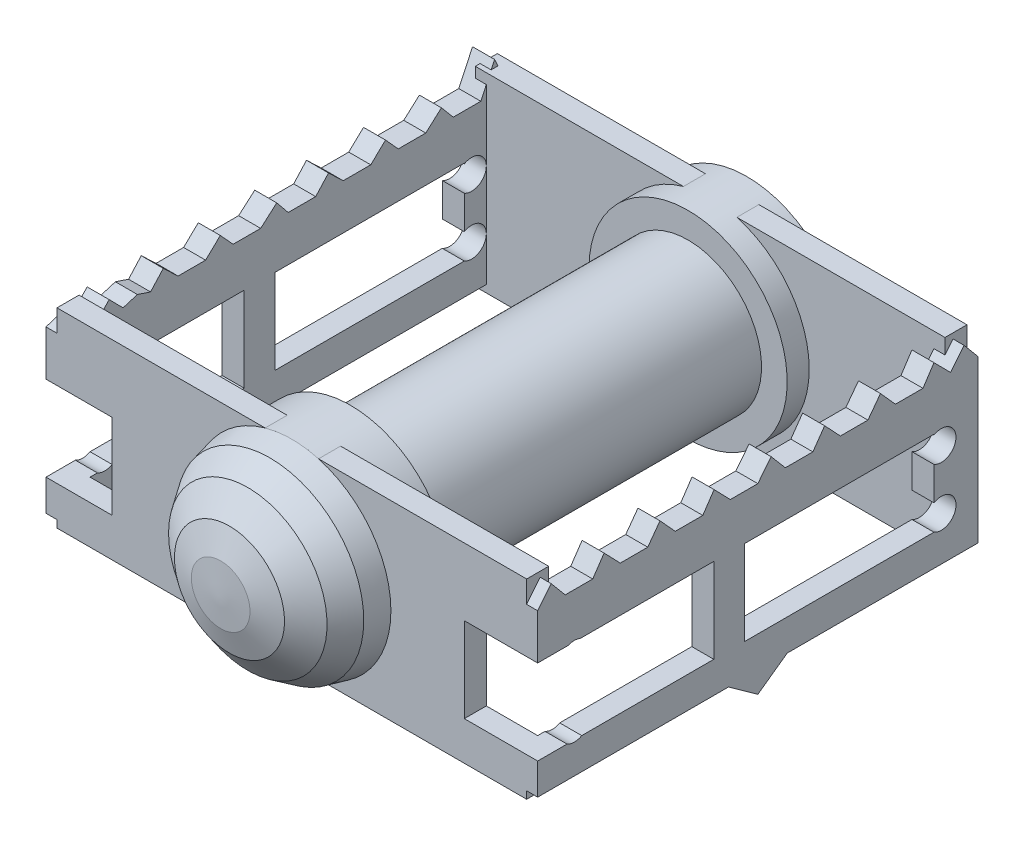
ISO-10303-21;
HEADER;
FILE_DESCRIPTION(('STEP AP214'),'2;1');
FILE_NAME('part.step','',(''),(''),'','','');
FILE_SCHEMA(('AUTOMOTIVE_DESIGN { 1 0 10303 214 1 1 1 1 }'));
ENDSEC;
DATA;
#1=APPLICATION_CONTEXT('core data for automotive mechanical design processes');
#2=APPLICATION_PROTOCOL_DEFINITION('international standard','automotive_design',2000,#1);
#3=PRODUCT_CONTEXT('',#1,'mechanical');
#4=PRODUCT('Part','Part','',(#3));
#5=PRODUCT_RELATED_PRODUCT_CATEGORY('part','',(#4));
#6=PRODUCT_DEFINITION_FORMATION('','',#4);
#7=PRODUCT_DEFINITION_CONTEXT('part definition',#1,'design');
#8=PRODUCT_DEFINITION('design','',#6,#7);
#9=PRODUCT_DEFINITION_SHAPE('','',#8);
#10=(LENGTH_UNIT() NAMED_UNIT(*) SI_UNIT(.MILLI.,.METRE.));
#11=(NAMED_UNIT(*) PLANE_ANGLE_UNIT() SI_UNIT($,.RADIAN.));
#12=(NAMED_UNIT(*) SI_UNIT($,.STERADIAN.) SOLID_ANGLE_UNIT());
#13=UNCERTAINTY_MEASURE_WITH_UNIT(LENGTH_MEASURE(1.E-05),#10,'distance_accuracy_value','');
#14=(GEOMETRIC_REPRESENTATION_CONTEXT(3) GLOBAL_UNCERTAINTY_ASSIGNED_CONTEXT((#13)) GLOBAL_UNIT_ASSIGNED_CONTEXT((#10,
#11,#12)) REPRESENTATION_CONTEXT('',''));
#15=CARTESIAN_POINT('',(0.,0.,0.));
#16=DIRECTION('',(0.,0.,1.));
#17=DIRECTION('',(1.,0.,0.));
#18=AXIS2_PLACEMENT_3D('',#15,#16,#17);
#19=CARTESIAN_POINT('',(142.,0.,0.));
#20=DIRECTION('',(-1.,0.,0.));
#21=DIRECTION('',(0.,0.,1.));
#22=AXIS2_PLACEMENT_3D('',#19,#20,#21);
#23=PLANE('',#22);
#24=DIRECTION('',(0.,0.,1.));
#25=VECTOR('',#24,1.);
#26=CARTESIAN_POINT('',(142.,3.82925151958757,0.));
#27=LINE('',#26,#25);
#28=CARTESIAN_POINT('',(142.,3.82925151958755,141.808603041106));
#29=VERTEX_POINT('',#28);
#30=CARTESIAN_POINT('',(142.,3.82925151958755,143.));
#31=VERTEX_POINT('',#30);
#32=EDGE_CURVE('E950',#29,#31,#27,.T.);
#33=ORIENTED_EDGE('',*,*,#32,.F.);
#34=CARTESIAN_POINT('',(142.,2.,141.));
#35=DIRECTION('',(-1.,0.,0.));
#36=DIRECTION('',(0.,0.,1.));
#37=AXIS2_PLACEMENT_3D('',#34,#35,#36);
#38=CIRCLE('',#37,2.);
#39=CARTESIAN_POINT('',(142.,3.82925151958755,140.191396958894));
#40=VERTEX_POINT('',#39);
#41=EDGE_CURVE('E1183',#29,#40,#38,.T.);
#42=ORIENTED_EDGE('',*,*,#41,.T.);
#43=CARTESIAN_POINT('',(142.,3.82925151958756,122.));
#44=VERTEX_POINT('',#43);
#45=EDGE_CURVE('E954',#44,#40,#27,.T.);
#46=ORIENTED_EDGE('',*,*,#45,.F.);
#47=DIRECTION('',(0.,1.,0.));
#48=VECTOR('',#47,1.);
#49=CARTESIAN_POINT('',(142.,0.,122.));
#50=LINE('',#49,#48);
#51=CARTESIAN_POINT('',(142.,-7.73205080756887,122.));
#52=VERTEX_POINT('',#51);
#53=EDGE_CURVE('E968',#52,#44,#50,.T.);
#54=ORIENTED_EDGE('',*,*,#53,.F.);
#55=DIRECTION('',(0.,0.,-1.));
#56=VECTOR('',#55,1.);
#57=CARTESIAN_POINT('',(142.,-7.73205080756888,0.));
#58=LINE('',#57,#56);
#59=CARTESIAN_POINT('',(142.,-7.73205080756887,140.));
#60=VERTEX_POINT('',#59);
#61=EDGE_CURVE('E936',#60,#52,#58,.T.);
#62=ORIENTED_EDGE('',*,*,#61,.F.);
#63=CARTESIAN_POINT('',(142.,-6.,141.));
#64=DIRECTION('',(-1.,0.,0.));
#65=DIRECTION('',(0.,0.,1.));
#66=AXIS2_PLACEMENT_3D('',#63,#64,#65);
#67=CIRCLE('',#66,2.);
#68=CARTESIAN_POINT('',(142.,-7.73205080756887,142.));
#69=VERTEX_POINT('',#68);
#70=EDGE_CURVE('E1188',#60,#69,#67,.T.);
#71=ORIENTED_EDGE('',*,*,#70,.T.);
#72=CARTESIAN_POINT('',(142.,-7.73205080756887,143.));
#73=VERTEX_POINT('',#72);
#74=EDGE_CURVE('E932',#73,#69,#58,.T.);
#75=ORIENTED_EDGE('',*,*,#74,.F.);
#76=DIRECTION('',(0.,1.,0.));
#77=VECTOR('',#76,1.);
#78=CARTESIAN_POINT('',(142.,0.,143.));
#79=LINE('',#78,#77);
#80=CARTESIAN_POINT('',(142.,-12.,143.));
#81=VERTEX_POINT('',#80);
#82=EDGE_CURVE('E1129',#81,#73,#79,.T.);
#83=ORIENTED_EDGE('',*,*,#82,.F.);
#84=DIRECTION('',(0.,0.,-1.));
#85=VECTOR('',#84,1.);
#86=CARTESIAN_POINT('',(142.,-12.,86.));
#87=LINE('',#86,#85);
#88=CARTESIAN_POINT('',(142.,-12.,89.));
#89=VERTEX_POINT('',#88);
#90=EDGE_CURVE('E1284',#81,#89,#87,.T.);
#91=ORIENTED_EDGE('',*,*,#90,.T.);
#92=DIRECTION('',(0.,-1.,0.));
#93=VECTOR('',#92,1.);
#94=CARTESIAN_POINT('',(142.,0.,89.));
#95=LINE('',#94,#93);
#96=CARTESIAN_POINT('',(142.,-6.,89.));
#97=VERTEX_POINT('',#96);
#98=EDGE_CURVE('E1523',#97,#89,#95,.T.);
#99=ORIENTED_EDGE('',*,*,#98,.F.);
#100=CARTESIAN_POINT('',(142.,-6.,91.));
#101=DIRECTION('',(-1.,0.,0.));
#102=DIRECTION('',(0.,0.,1.));
#103=AXIS2_PLACEMENT_3D('',#100,#101,#102);
#104=CIRCLE('',#103,2.);
#105=CARTESIAN_POINT('',(142.,-7.73205080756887,92.));
#106=VERTEX_POINT('',#105);
#107=EDGE_CURVE('E1199',#97,#106,#104,.T.);
#108=ORIENTED_EDGE('',*,*,#107,.T.);
#109=DIRECTION('',(0.,0.,-1.));
#110=VECTOR('',#109,1.);
#111=CARTESIAN_POINT('',(142.,-7.73205080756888,0.));
#112=LINE('',#111,#110);
#113=CARTESIAN_POINT('',(142.,-7.73205080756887,117.795648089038));
#114=VERTEX_POINT('',#113);
#115=EDGE_CURVE('E1002',#114,#106,#112,.T.);
#116=ORIENTED_EDGE('',*,*,#115,.F.);
#117=DIRECTION('',(0.,-1.,0.));
#118=VECTOR('',#117,1.);
#119=CARTESIAN_POINT('',(142.,1.41397825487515E-13,117.795648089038));
#120=LINE('',#119,#118);
#121=CARTESIAN_POINT('',(142.,3.82925151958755,117.795648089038));
#122=VERTEX_POINT('',#121);
#123=EDGE_CURVE('E1005',#122,#114,#120,.T.);
#124=ORIENTED_EDGE('',*,*,#123,.F.);
#125=DIRECTION('',(0.,0.,1.));
#126=VECTOR('',#125,1.);
#127=CARTESIAN_POINT('',(142.,3.82925151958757,0.));
#128=LINE('',#127,#126);
#129=CARTESIAN_POINT('',(142.,3.82925151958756,92.));
#130=VERTEX_POINT('',#129);
#131=EDGE_CURVE('E1008',#130,#122,#128,.T.);
#132=ORIENTED_EDGE('',*,*,#131,.F.);
#133=DIRECTION('',(0.,1.,0.));
#134=VECTOR('',#133,1.);
#135=CARTESIAN_POINT('',(142.,0.,92.));
#136=LINE('',#135,#134);
#137=CARTESIAN_POINT('',(142.,3.73205080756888,92.));
#138=VERTEX_POINT('',#137);
#139=EDGE_CURVE('E990',#138,#130,#136,.T.);
#140=ORIENTED_EDGE('',*,*,#139,.F.);
#141=CARTESIAN_POINT('',(142.,2.,91.));
#142=DIRECTION('',(-1.,0.,0.));
#143=DIRECTION('',(0.,0.,1.));
#144=AXIS2_PLACEMENT_3D('',#141,#142,#143);
#145=CIRCLE('',#144,2.);
#146=CARTESIAN_POINT('',(142.,2.,89.));
#147=VERTEX_POINT('',#146);
#148=EDGE_CURVE('E1198',#138,#147,#145,.T.);
#149=ORIENTED_EDGE('',*,*,#148,.T.);
#150=CARTESIAN_POINT('',(142.,11.6,89.));
#151=VERTEX_POINT('',#150);
#152=EDGE_CURVE('E1528',#151,#147,#95,.T.);
#153=ORIENTED_EDGE('',*,*,#152,.F.);
#154=DIRECTION('',(0.,-0.905458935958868,0.42443387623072));
#155=VECTOR('',#154,1.);
#156=CARTESIAN_POINT('',(142.,10.,89.75));
#157=LINE('',#156,#155);
#158=CARTESIAN_POINT('',(142.,10.,89.75));
#159=VERTEX_POINT('',#158);
#160=EDGE_CURVE('E1208',#151,#159,#157,.T.);
#161=ORIENTED_EDGE('',*,*,#160,.T.);
#162=DIRECTION('',(0.,0.,1.));
#163=VECTOR('',#162,1.);
#164=CARTESIAN_POINT('',(142.,10.,91.274565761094));
#165=LINE('',#164,#163);
#166=CARTESIAN_POINT('',(142.,10.,93.5));
#167=VERTEX_POINT('',#166);
#168=EDGE_CURVE('E1214',#159,#167,#165,.T.);
#169=ORIENTED_EDGE('',*,*,#168,.T.);
#170=DIRECTION('',(0.,0.763191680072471,0.646172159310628));
#171=VECTOR('',#170,1.);
#172=CARTESIAN_POINT('',(142.,11.9141428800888,95.1206490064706));
#173=LINE('',#172,#171);
#174=CARTESIAN_POINT('',(142.,11.9141428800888,95.1206490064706));
#175=VERTEX_POINT('',#174);
#176=EDGE_CURVE('E1217',#167,#175,#173,.T.);
#177=ORIENTED_EDGE('',*,*,#176,.T.);
#178=DIRECTION('',(0.,-0.668526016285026,0.743688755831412));
#179=VECTOR('',#178,1.);
#180=CARTESIAN_POINT('',(142.,10.,97.25));
#181=LINE('',#180,#179);
#182=CARTESIAN_POINT('',(142.,10.,97.25));
#183=VERTEX_POINT('',#182);
#184=EDGE_CURVE('E1220',#175,#183,#181,.T.);
#185=ORIENTED_EDGE('',*,*,#184,.T.);
#186=DIRECTION('',(0.,0.,1.));
#187=VECTOR('',#186,1.);
#188=CARTESIAN_POINT('',(142.,10.,98.6462253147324));
#189=LINE('',#188,#187);
#190=CARTESIAN_POINT('',(142.,10.,101.));
#191=VERTEX_POINT('',#190);
#192=EDGE_CURVE('E1223',#183,#191,#189,.T.);
#193=ORIENTED_EDGE('',*,*,#192,.T.);
#194=DIRECTION('',(0.,0.741372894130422,0.671093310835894));
#195=VECTOR('',#194,1.);
#196=CARTESIAN_POINT('',(142.,11.9141428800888,102.732688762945));
#197=LINE('',#196,#195);
#198=CARTESIAN_POINT('',(142.,11.9141428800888,102.732688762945));
#199=VERTEX_POINT('',#198);
#200=EDGE_CURVE('E1226',#191,#199,#197,.T.);
#201=ORIENTED_EDGE('',*,*,#200,.T.);
#202=DIRECTION('',(0.,-0.688314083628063,0.72541279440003));
#203=VECTOR('',#202,1.);
#204=CARTESIAN_POINT('',(142.,10.,104.75));
#205=LINE('',#204,#203);
#206=CARTESIAN_POINT('',(142.,10.,104.75));
#207=VERTEX_POINT('',#206);
#208=EDGE_CURVE('E1229',#199,#207,#205,.T.);
#209=ORIENTED_EDGE('',*,*,#208,.T.);
#210=DIRECTION('',(0.,0.,1.));
#211=VECTOR('',#210,1.);
#212=CARTESIAN_POINT('',(142.,10.,106.498645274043));
#213=LINE('',#212,#211);
#214=CARTESIAN_POINT('',(142.,10.,108.5));
#215=VERTEX_POINT('',#214);
#216=EDGE_CURVE('E1232',#207,#215,#213,.T.);
#217=ORIENTED_EDGE('',*,*,#216,.T.);
#218=DIRECTION('',(0.,0.690531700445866,0.723302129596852));
#219=VECTOR('',#218,1.);
#220=CARTESIAN_POINT('',(142.,11.9141428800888,110.504981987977));
#221=LINE('',#220,#219);
#222=CARTESIAN_POINT('',(142.,11.9141428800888,110.504981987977));
#223=VERTEX_POINT('',#222);
#224=EDGE_CURVE('E1235',#215,#223,#221,.T.);
#225=ORIENTED_EDGE('',*,*,#224,.T.);
#226=DIRECTION('',(0.,-0.739000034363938,0.673705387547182));
#227=VECTOR('',#226,1.);
#228=CARTESIAN_POINT('',(142.,10.,112.25));
#229=LINE('',#228,#227);
#230=CARTESIAN_POINT('',(142.,10.,112.25));
#231=VERTEX_POINT('',#230);
#232=EDGE_CURVE('E1238',#223,#231,#229,.T.);
#233=ORIENTED_EDGE('',*,*,#232,.T.);
#234=DIRECTION('',(0.,0.,1.));
#235=VECTOR('',#234,1.);
#236=CARTESIAN_POINT('',(142.,10.,113.790178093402));
#237=LINE('',#236,#235);
#238=CARTESIAN_POINT('',(142.,10.,116.));
#239=VERTEX_POINT('',#238);
#240=EDGE_CURVE('E1241',#231,#239,#237,.T.);
#241=ORIENTED_EDGE('',*,*,#240,.T.);
#242=DIRECTION('',(0.,0.775936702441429,0.630810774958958));
#243=VECTOR('',#242,1.);
#244=CARTESIAN_POINT('',(142.,11.9141428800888,117.5561346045));
#245=LINE('',#244,#243);
#246=CARTESIAN_POINT('',(142.,11.9141428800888,117.5561346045));
#247=VERTEX_POINT('',#246);
#248=EDGE_CURVE('E1244',#239,#247,#245,.T.);
#249=ORIENTED_EDGE('',*,*,#248,.T.);
#250=DIRECTION('',(0.,-0.657436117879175,0.753510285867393));
#251=VECTOR('',#250,1.);
#252=CARTESIAN_POINT('',(142.,10.,119.75));
#253=LINE('',#252,#251);
#254=CARTESIAN_POINT('',(142.,10.,119.75));
#255=VERTEX_POINT('',#254);
#256=EDGE_CURVE('E1247',#247,#255,#253,.T.);
#257=ORIENTED_EDGE('',*,*,#256,.T.);
#258=DIRECTION('',(0.,0.,1.));
#259=VECTOR('',#258,1.);
#260=CARTESIAN_POINT('',(142.,10.,121.24196438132));
#261=LINE('',#260,#259);
#262=CARTESIAN_POINT('',(142.,10.,123.5));
#263=VERTEX_POINT('',#262);
#264=EDGE_CURVE('E1250',#255,#263,#261,.T.);
#265=ORIENTED_EDGE('',*,*,#264,.T.);
#266=DIRECTION('',(0.,0.738369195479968,0.674396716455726));
#267=VECTOR('',#266,1.);
#268=CARTESIAN_POINT('',(142.,11.9141428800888,125.248301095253));
#269=LINE('',#268,#267);
#270=CARTESIAN_POINT('',(142.,11.9141428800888,125.248301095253));
#271=VERTEX_POINT('',#270);
#272=EDGE_CURVE('E1253',#263,#271,#269,.T.);
#273=ORIENTED_EDGE('',*,*,#272,.T.);
#274=DIRECTION('',(0.,-0.691123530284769,0.722736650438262));
#275=VECTOR('',#274,1.);
#276=CARTESIAN_POINT('',(142.,10.,127.25));
#277=LINE('',#276,#275);
#278=CARTESIAN_POINT('',(142.,10.,127.25));
#279=VERTEX_POINT('',#278);
#280=EDGE_CURVE('E1256',#271,#279,#277,.T.);
#281=ORIENTED_EDGE('',*,*,#280,.T.);
#282=DIRECTION('',(0.,0.,1.));
#283=VECTOR('',#282,1.);
#284=CARTESIAN_POINT('',(142.,10.,129.014257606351));
#285=LINE('',#284,#283);
#286=CARTESIAN_POINT('',(142.,10.,131.));
#287=VERTEX_POINT('',#286);
#288=EDGE_CURVE('E1259',#279,#287,#285,.T.);
#289=ORIENTED_EDGE('',*,*,#288,.T.);
#290=DIRECTION('',(0.,0.68772488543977,0.725971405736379));
#291=VECTOR('',#290,1.);
#292=CARTESIAN_POINT('',(142.,11.9141428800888,133.020594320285));
#293=LINE('',#292,#291);
#294=CARTESIAN_POINT('',(142.,11.9141428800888,133.020594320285));
#295=VERTEX_POINT('',#294);
#296=EDGE_CURVE('E1262',#287,#295,#293,.T.);
#297=ORIENTED_EDGE('',*,*,#296,.T.);
#298=DIRECTION('',(0.,-0.742005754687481,0.670393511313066));
#299=VECTOR('',#298,1.);
#300=CARTESIAN_POINT('',(142.,10.,134.75));
#301=LINE('',#300,#299);
#302=CARTESIAN_POINT('',(142.,10.,134.75));
#303=VERTEX_POINT('',#302);
#304=EDGE_CURVE('E1265',#295,#303,#301,.T.);
#305=ORIENTED_EDGE('',*,*,#304,.T.);
#306=DIRECTION('',(0.,0.31431901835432,0.949317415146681));
#307=VECTOR('',#306,1.);
#308=CARTESIAN_POINT('',(142.,10.5947121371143,136.546170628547));
#309=LINE('',#308,#307);
#310=CARTESIAN_POINT('',(142.,10.5947121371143,136.546170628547));
#311=VERTEX_POINT('',#310);
#312=EDGE_CURVE('E1268',#303,#311,#309,.T.);
#313=ORIENTED_EDGE('',*,*,#312,.T.);
#314=DIRECTION('',(0.,-0.29119227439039,0.956664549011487));
#315=VECTOR('',#314,1.);
#316=CARTESIAN_POINT('',(142.,10.,138.5));
#317=LINE('',#316,#315);
#318=CARTESIAN_POINT('',(142.,10.,138.5));
#319=VERTEX_POINT('',#318);
#320=EDGE_CURVE('E1271',#311,#319,#317,.T.);
#321=ORIENTED_EDGE('',*,*,#320,.T.);
#322=DIRECTION('',(0.,0.711161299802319,0.703028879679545));
#323=VECTOR('',#322,1.);
#324=CARTESIAN_POINT('',(142.,11.9141428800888,140.392253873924));
#325=LINE('',#324,#323);
#326=CARTESIAN_POINT('',(142.,11.9141428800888,140.392253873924));
#327=VERTEX_POINT('',#326);
#328=EDGE_CURVE('E1274',#319,#327,#325,.T.);
#329=ORIENTED_EDGE('',*,*,#328,.T.);
#330=DIRECTION('',(0.,-0.717599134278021,0.696456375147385));
#331=VECTOR('',#330,1.);
#332=CARTESIAN_POINT('',(142.,10.,142.25));
#333=LINE('',#332,#331);
#334=CARTESIAN_POINT('',(142.,10.,142.25));
#335=VERTEX_POINT('',#334);
#336=EDGE_CURVE('E1277',#327,#335,#333,.T.);
#337=ORIENTED_EDGE('',*,*,#336,.T.);
#338=DIRECTION('',(0.,0.297543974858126,0.954708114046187));
#339=VECTOR('',#338,1.);
#340=CARTESIAN_POINT('',(142.,10.5947121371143,144.158210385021));
#341=LINE('',#340,#339);
#342=CARTESIAN_POINT('',(142.,10.2337447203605,143.));
#343=VERTEX_POINT('',#342);
#344=EDGE_CURVE('E1280',#335,#343,#341,.T.);
#345=ORIENTED_EDGE('',*,*,#344,.T.);
#346=EDGE_CURVE('E1125',#31,#343,#79,.T.);
#347=ORIENTED_EDGE('',*,*,#346,.F.);
#348=EDGE_LOOP('',(#33,#42,#46,#54,#62,#71,#75,#83,#91,#99,#108,#116,#124,#132,#140,#149,#153,
#161,#169,#177,#185,#193,#201,#209,#217,#225,#233,#241,#249,#257,#265,#273,#281,#289,#297,#305,
#313,#321,#329,#337,#345,#347));
#349=FACE_BOUND('',#348,.T.);
#350=ADVANCED_FACE('F89',(#349),#23,.F.);
#351=CARTESIAN_POINT('',(139.,0.,0.));
#352=DIRECTION('',(-1.,0.,0.));
#353=DIRECTION('',(0.,0.,1.));
#354=AXIS2_PLACEMENT_3D('',#351,#352,#353);
#355=PLANE('',#354);
#356=CARTESIAN_POINT('',(139.,-6.,91.));
#357=DIRECTION('',(-1.,0.,0.));
#358=DIRECTION('',(0.,0.,1.));
#359=AXIS2_PLACEMENT_3D('',#356,#357,#358);
#360=CIRCLE('',#359,2.);
#361=CARTESIAN_POINT('',(139.,-4.26794919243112,92.));
#362=VERTEX_POINT('',#361);
#363=CARTESIAN_POINT('',(139.,-7.73205080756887,92.));
#364=VERTEX_POINT('',#363);
#365=EDGE_CURVE('E1197',#362,#364,#360,.T.);
#366=ORIENTED_EDGE('',*,*,#365,.F.);
#367=DIRECTION('',(0.,1.,0.));
#368=VECTOR('',#367,1.);
#369=CARTESIAN_POINT('',(139.,0.,92.));
#370=LINE('',#369,#368);
#371=CARTESIAN_POINT('',(139.,0.267949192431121,92.));
#372=VERTEX_POINT('',#371);
#373=EDGE_CURVE('E991',#362,#372,#370,.T.);
#374=ORIENTED_EDGE('',*,*,#373,.T.);
#375=CARTESIAN_POINT('',(139.,2.,91.));
#376=DIRECTION('',(-1.,0.,0.));
#377=DIRECTION('',(0.,0.,1.));
#378=AXIS2_PLACEMENT_3D('',#375,#376,#377);
#379=CIRCLE('',#378,2.);
#380=CARTESIAN_POINT('',(139.,3.73205080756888,92.));
#381=VERTEX_POINT('',#380);
#382=EDGE_CURVE('E1192',#381,#372,#379,.T.);
#383=ORIENTED_EDGE('',*,*,#382,.F.);
#384=CARTESIAN_POINT('',(139.,3.82925151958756,92.));
#385=VERTEX_POINT('',#384);
#386=EDGE_CURVE('E976',#381,#385,#370,.T.);
#387=ORIENTED_EDGE('',*,*,#386,.T.);
#388=DIRECTION('',(0.,0.,1.));
#389=VECTOR('',#388,1.);
#390=CARTESIAN_POINT('',(139.,3.82925151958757,0.));
#391=LINE('',#390,#389);
#392=CARTESIAN_POINT('',(139.,3.82925151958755,117.795648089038));
#393=VERTEX_POINT('',#392);
#394=EDGE_CURVE('E2073',#385,#393,#391,.T.);
#395=ORIENTED_EDGE('',*,*,#394,.T.);
#396=DIRECTION('',(0.,-1.,0.));
#397=VECTOR('',#396,1.);
#398=CARTESIAN_POINT('',(139.,1.41397825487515E-13,117.795648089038));
#399=LINE('',#398,#397);
#400=CARTESIAN_POINT('',(139.,-7.73205080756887,117.795648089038));
#401=VERTEX_POINT('',#400);
#402=EDGE_CURVE('E2069',#393,#401,#399,.T.);
#403=ORIENTED_EDGE('',*,*,#402,.T.);
#404=DIRECTION('',(0.,0.,-1.));
#405=VECTOR('',#404,1.);
#406=CARTESIAN_POINT('',(139.,-7.73205080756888,0.));
#407=LINE('',#406,#405);
#408=EDGE_CURVE('E998',#401,#364,#407,.T.);
#409=ORIENTED_EDGE('',*,*,#408,.T.);
#410=EDGE_LOOP('',(#366,#374,#383,#387,#395,#403,#409));
#411=FACE_BOUND('',#410,.T.);
#412=CARTESIAN_POINT('',(139.,2.,141.));
#413=DIRECTION('',(-1.,0.,0.));
#414=DIRECTION('',(0.,0.,1.));
#415=AXIS2_PLACEMENT_3D('',#412,#413,#414);
#416=CIRCLE('',#415,2.);
#417=CARTESIAN_POINT('',(139.,3.82925151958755,141.808603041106));
#418=VERTEX_POINT('',#417);
#419=CARTESIAN_POINT('',(139.,3.82925151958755,140.191396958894));
#420=VERTEX_POINT('',#419);
#421=EDGE_CURVE('E1182',#418,#420,#416,.T.);
#422=ORIENTED_EDGE('',*,*,#421,.F.);
#423=DIRECTION('',(0.,0.,1.));
#424=VECTOR('',#423,1.);
#425=CARTESIAN_POINT('',(139.,3.82925151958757,0.));
#426=LINE('',#425,#424);
#427=CARTESIAN_POINT('',(139.,3.82925151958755,146.));
#428=VERTEX_POINT('',#427);
#429=EDGE_CURVE('E957',#418,#428,#426,.T.);
#430=ORIENTED_EDGE('',*,*,#429,.T.);
#431=DIRECTION('',(0.,-1.,0.));
#432=VECTOR('',#431,1.);
#433=CARTESIAN_POINT('',(139.,-12.,146.));
#434=LINE('',#433,#432);
#435=CARTESIAN_POINT('',(139.,10.,146.));
#436=VERTEX_POINT('',#435);
#437=EDGE_CURVE('E1378',#436,#428,#434,.T.);
#438=ORIENTED_EDGE('',*,*,#437,.F.);
#439=DIRECTION('',(0.,-0.307277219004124,0.951620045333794));
#440=VECTOR('',#439,1.);
#441=CARTESIAN_POINT('',(139.,10.,146.));
#442=LINE('',#441,#440);
#443=CARTESIAN_POINT('',(139.,10.5947121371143,144.158210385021));
#444=VERTEX_POINT('',#443);
#445=EDGE_CURVE('E1373',#444,#436,#442,.T.);
#446=ORIENTED_EDGE('',*,*,#445,.F.);
#447=DIRECTION('',(0.,0.297543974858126,0.954708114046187));
#448=VECTOR('',#447,1.);
#449=CARTESIAN_POINT('',(139.,10.5947121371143,144.158210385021));
#450=LINE('',#449,#448);
#451=CARTESIAN_POINT('',(139.,10.,142.25));
#452=VERTEX_POINT('',#451);
#453=EDGE_CURVE('E1369',#452,#444,#450,.T.);
#454=ORIENTED_EDGE('',*,*,#453,.F.);
#455=DIRECTION('',(0.,-0.717599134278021,0.696456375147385));
#456=VECTOR('',#455,1.);
#457=CARTESIAN_POINT('',(139.,10.,142.25));
#458=LINE('',#457,#456);
#459=CARTESIAN_POINT('',(139.,11.9141428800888,140.392253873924));
#460=VERTEX_POINT('',#459);
#461=EDGE_CURVE('E1366',#460,#452,#458,.T.);
#462=ORIENTED_EDGE('',*,*,#461,.F.);
#463=DIRECTION('',(0.,0.711161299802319,0.703028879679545));
#464=VECTOR('',#463,1.);
#465=CARTESIAN_POINT('',(139.,11.9141428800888,140.392253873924));
#466=LINE('',#465,#464);
#467=CARTESIAN_POINT('',(139.,10.,138.5));
#468=VERTEX_POINT('',#467);
#469=EDGE_CURVE('E1363',#468,#460,#466,.T.);
#470=ORIENTED_EDGE('',*,*,#469,.F.);
#471=DIRECTION('',(0.,-0.29119227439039,0.956664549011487));
#472=VECTOR('',#471,1.);
#473=CARTESIAN_POINT('',(139.,10.,138.5));
#474=LINE('',#473,#472);
#475=CARTESIAN_POINT('',(139.,10.5947121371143,136.546170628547));
#476=VERTEX_POINT('',#475);
#477=EDGE_CURVE('E1360',#476,#468,#474,.T.);
#478=ORIENTED_EDGE('',*,*,#477,.F.);
#479=DIRECTION('',(0.,0.31431901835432,0.949317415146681));
#480=VECTOR('',#479,1.);
#481=CARTESIAN_POINT('',(139.,10.5947121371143,136.546170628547));
#482=LINE('',#481,#480);
#483=CARTESIAN_POINT('',(139.,10.,134.75));
#484=VERTEX_POINT('',#483);
#485=EDGE_CURVE('E1357',#484,#476,#482,.T.);
#486=ORIENTED_EDGE('',*,*,#485,.F.);
#487=DIRECTION('',(0.,-0.742005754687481,0.670393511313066));
#488=VECTOR('',#487,1.);
#489=CARTESIAN_POINT('',(139.,10.,134.75));
#490=LINE('',#489,#488);
#491=CARTESIAN_POINT('',(139.,11.9141428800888,133.020594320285));
#492=VERTEX_POINT('',#491);
#493=EDGE_CURVE('E1354',#492,#484,#490,.T.);
#494=ORIENTED_EDGE('',*,*,#493,.F.);
#495=DIRECTION('',(0.,0.68772488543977,0.725971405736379));
#496=VECTOR('',#495,1.);
#497=CARTESIAN_POINT('',(139.,11.9141428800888,133.020594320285));
#498=LINE('',#497,#496);
#499=CARTESIAN_POINT('',(139.,10.,131.));
#500=VERTEX_POINT('',#499);
#501=EDGE_CURVE('E1351',#500,#492,#498,.T.);
#502=ORIENTED_EDGE('',*,*,#501,.F.);
#503=DIRECTION('',(0.,0.,1.));
#504=VECTOR('',#503,1.);
#505=CARTESIAN_POINT('',(139.,10.,131.));
#506=LINE('',#505,#504);
#507=CARTESIAN_POINT('',(139.,10.,127.25));
#508=VERTEX_POINT('',#507);
#509=EDGE_CURVE('E1348',#508,#500,#506,.T.);
#510=ORIENTED_EDGE('',*,*,#509,.F.);
#511=DIRECTION('',(0.,-0.691123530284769,0.722736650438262));
#512=VECTOR('',#511,1.);
#513=CARTESIAN_POINT('',(139.,10.,127.25));
#514=LINE('',#513,#512);
#515=CARTESIAN_POINT('',(139.,11.9141428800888,125.248301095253));
#516=VERTEX_POINT('',#515);
#517=EDGE_CURVE('E1344',#516,#508,#514,.T.);
#518=ORIENTED_EDGE('',*,*,#517,.F.);
#519=DIRECTION('',(0.,0.738369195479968,0.674396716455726));
#520=VECTOR('',#519,1.);
#521=CARTESIAN_POINT('',(139.,11.9141428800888,125.248301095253));
#522=LINE('',#521,#520);
#523=CARTESIAN_POINT('',(139.,10.,123.5));
#524=VERTEX_POINT('',#523);
#525=EDGE_CURVE('E1341',#524,#516,#522,.T.);
#526=ORIENTED_EDGE('',*,*,#525,.F.);
#527=DIRECTION('',(0.,0.,1.));
#528=VECTOR('',#527,1.);
#529=CARTESIAN_POINT('',(139.,10.,123.5));
#530=LINE('',#529,#528);
#531=CARTESIAN_POINT('',(139.,10.,119.75));
#532=VERTEX_POINT('',#531);
#533=EDGE_CURVE('E1338',#532,#524,#530,.T.);
#534=ORIENTED_EDGE('',*,*,#533,.F.);
#535=DIRECTION('',(0.,-0.657436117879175,0.753510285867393));
#536=VECTOR('',#535,1.);
#537=CARTESIAN_POINT('',(139.,10.,119.75));
#538=LINE('',#537,#536);
#539=CARTESIAN_POINT('',(139.,11.9141428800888,117.5561346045));
#540=VERTEX_POINT('',#539);
#541=EDGE_CURVE('E1334',#540,#532,#538,.T.);
#542=ORIENTED_EDGE('',*,*,#541,.F.);
#543=DIRECTION('',(0.,0.775936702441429,0.630810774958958));
#544=VECTOR('',#543,1.);
#545=CARTESIAN_POINT('',(139.,11.9141428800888,117.5561346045));
#546=LINE('',#545,#544);
#547=CARTESIAN_POINT('',(139.,10.,116.));
#548=VERTEX_POINT('',#547);
#549=EDGE_CURVE('E1331',#548,#540,#546,.T.);
#550=ORIENTED_EDGE('',*,*,#549,.F.);
#551=DIRECTION('',(0.,0.,1.));
#552=VECTOR('',#551,1.);
#553=CARTESIAN_POINT('',(139.,10.,116.));
#554=LINE('',#553,#552);
#555=CARTESIAN_POINT('',(139.,10.,112.25));
#556=VERTEX_POINT('',#555);
#557=EDGE_CURVE('E1328',#556,#548,#554,.T.);
#558=ORIENTED_EDGE('',*,*,#557,.F.);
#559=DIRECTION('',(0.,-0.739000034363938,0.673705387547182));
#560=VECTOR('',#559,1.);
#561=CARTESIAN_POINT('',(139.,10.,112.25));
#562=LINE('',#561,#560);
#563=CARTESIAN_POINT('',(139.,11.9141428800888,110.504981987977));
#564=VERTEX_POINT('',#563);
#565=EDGE_CURVE('E1324',#564,#556,#562,.T.);
#566=ORIENTED_EDGE('',*,*,#565,.F.);
#567=DIRECTION('',(0.,0.690531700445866,0.723302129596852));
#568=VECTOR('',#567,1.);
#569=CARTESIAN_POINT('',(139.,11.9141428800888,110.504981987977));
#570=LINE('',#569,#568);
#571=CARTESIAN_POINT('',(139.,10.,108.5));
#572=VERTEX_POINT('',#571);
#573=EDGE_CURVE('E1321',#572,#564,#570,.T.);
#574=ORIENTED_EDGE('',*,*,#573,.F.);
#575=DIRECTION('',(0.,0.,1.));
#576=VECTOR('',#575,1.);
#577=CARTESIAN_POINT('',(139.,10.,108.5));
#578=LINE('',#577,#576);
#579=CARTESIAN_POINT('',(139.,10.,104.75));
#580=VERTEX_POINT('',#579);
#581=EDGE_CURVE('E1318',#580,#572,#578,.T.);
#582=ORIENTED_EDGE('',*,*,#581,.F.);
#583=DIRECTION('',(0.,-0.688314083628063,0.72541279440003));
#584=VECTOR('',#583,1.);
#585=CARTESIAN_POINT('',(139.,10.,104.75));
#586=LINE('',#585,#584);
#587=CARTESIAN_POINT('',(139.,11.9141428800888,102.732688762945));
#588=VERTEX_POINT('',#587);
#589=EDGE_CURVE('E1314',#588,#580,#586,.T.);
#590=ORIENTED_EDGE('',*,*,#589,.F.);
#591=DIRECTION('',(0.,0.741372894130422,0.671093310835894));
#592=VECTOR('',#591,1.);
#593=CARTESIAN_POINT('',(139.,11.9141428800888,102.732688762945));
#594=LINE('',#593,#592);
#595=CARTESIAN_POINT('',(139.,10.,101.));
#596=VERTEX_POINT('',#595);
#597=EDGE_CURVE('E1311',#596,#588,#594,.T.);
#598=ORIENTED_EDGE('',*,*,#597,.F.);
#599=DIRECTION('',(0.,0.,1.));
#600=VECTOR('',#599,1.);
#601=CARTESIAN_POINT('',(139.,10.,101.));
#602=LINE('',#601,#600);
#603=CARTESIAN_POINT('',(139.,10.,97.25));
#604=VERTEX_POINT('',#603);
#605=EDGE_CURVE('E1308',#604,#596,#602,.T.);
#606=ORIENTED_EDGE('',*,*,#605,.F.);
#607=DIRECTION('',(0.,-0.668526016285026,0.743688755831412));
#608=VECTOR('',#607,1.);
#609=CARTESIAN_POINT('',(139.,10.,97.25));
#610=LINE('',#609,#608);
#611=CARTESIAN_POINT('',(139.,11.9141428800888,95.1206490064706));
#612=VERTEX_POINT('',#611);
#613=EDGE_CURVE('E1304',#612,#604,#610,.T.);
#614=ORIENTED_EDGE('',*,*,#613,.F.);
#615=DIRECTION('',(0.,0.763191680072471,0.646172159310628));
#616=VECTOR('',#615,1.);
#617=CARTESIAN_POINT('',(139.,11.9141428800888,95.1206490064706));
#618=LINE('',#617,#616);
#619=CARTESIAN_POINT('',(139.,10.,93.5));
#620=VERTEX_POINT('',#619);
#621=EDGE_CURVE('E1301',#620,#612,#618,.T.);
#622=ORIENTED_EDGE('',*,*,#621,.F.);
#623=DIRECTION('',(0.,0.,1.));
#624=VECTOR('',#623,1.);
#625=CARTESIAN_POINT('',(139.,10.,93.5));
#626=LINE('',#625,#624);
#627=CARTESIAN_POINT('',(139.,10.,89.75));
#628=VERTEX_POINT('',#627);
#629=EDGE_CURVE('E1298',#628,#620,#626,.T.);
#630=ORIENTED_EDGE('',*,*,#629,.F.);
#631=DIRECTION('',(0.,-0.905458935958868,0.42443387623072));
#632=VECTOR('',#631,1.);
#633=CARTESIAN_POINT('',(139.,10.,89.75));
#634=LINE('',#633,#632);
#635=CARTESIAN_POINT('',(139.,14.,87.875));
#636=VERTEX_POINT('',#635);
#637=EDGE_CURVE('E1294',#636,#628,#634,.T.);
#638=ORIENTED_EDGE('',*,*,#637,.F.);
#639=DIRECTION('',(0.,0.905458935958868,0.42443387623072));
#640=VECTOR('',#639,1.);
#641=CARTESIAN_POINT('',(139.,14.,87.875));
#642=LINE('',#641,#640);
#643=CARTESIAN_POINT('',(139.,10.,86.));
#644=VERTEX_POINT('',#643);
#645=EDGE_CURVE('E1291',#644,#636,#642,.T.);
#646=ORIENTED_EDGE('',*,*,#645,.F.);
#647=DIRECTION('',(0.,1.,0.));
#648=VECTOR('',#647,1.);
#649=CARTESIAN_POINT('',(139.,10.,86.));
#650=LINE('',#649,#648);
#651=CARTESIAN_POINT('',(139.,-12.,86.));
#652=VERTEX_POINT('',#651);
#653=EDGE_CURVE('E1203',#652,#644,#650,.T.);
#654=ORIENTED_EDGE('',*,*,#653,.F.);
#655=DIRECTION('',(0.,0.,-1.));
#656=VECTOR('',#655,1.);
#657=CARTESIAN_POINT('',(139.,-12.,86.));
#658=LINE('',#657,#656);
#659=CARTESIAN_POINT('',(139.,-12.,146.));
#660=VERTEX_POINT('',#659);
#661=EDGE_CURVE('E1209',#660,#652,#658,.T.);
#662=ORIENTED_EDGE('',*,*,#661,.F.);
#663=CARTESIAN_POINT('',(139.,-7.73205080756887,146.));
#664=VERTEX_POINT('',#663);
#665=EDGE_CURVE('E1377',#664,#660,#434,.T.);
#666=ORIENTED_EDGE('',*,*,#665,.F.);
#667=DIRECTION('',(0.,0.,-1.));
#668=VECTOR('',#667,1.);
#669=CARTESIAN_POINT('',(139.,-7.73205080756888,0.));
#670=LINE('',#669,#668);
#671=CARTESIAN_POINT('',(139.,-7.73205080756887,142.));
#672=VERTEX_POINT('',#671);
#673=EDGE_CURVE('E939',#664,#672,#670,.T.);
#674=ORIENTED_EDGE('',*,*,#673,.T.);
#675=CARTESIAN_POINT('',(139.,-6.,141.));
#676=DIRECTION('',(-1.,0.,0.));
#677=DIRECTION('',(0.,0.,1.));
#678=AXIS2_PLACEMENT_3D('',#675,#676,#677);
#679=CIRCLE('',#678,2.);
#680=CARTESIAN_POINT('',(139.,-7.73205080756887,140.));
#681=VERTEX_POINT('',#680);
#682=EDGE_CURVE('E1187',#681,#672,#679,.T.);
#683=ORIENTED_EDGE('',*,*,#682,.F.);
#684=CARTESIAN_POINT('',(139.,-7.73205080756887,122.));
#685=VERTEX_POINT('',#684);
#686=EDGE_CURVE('E944',#681,#685,#670,.T.);
#687=ORIENTED_EDGE('',*,*,#686,.T.);
#688=DIRECTION('',(0.,1.,0.));
#689=VECTOR('',#688,1.);
#690=CARTESIAN_POINT('',(139.,0.,122.));
#691=LINE('',#690,#689);
#692=CARTESIAN_POINT('',(139.,3.82925151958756,122.));
#693=VERTEX_POINT('',#692);
#694=EDGE_CURVE('E2087',#685,#693,#691,.T.);
#695=ORIENTED_EDGE('',*,*,#694,.T.);
#696=EDGE_CURVE('E962',#693,#420,#426,.T.);
#697=ORIENTED_EDGE('',*,*,#696,.T.);
#698=EDGE_LOOP('',(#422,#430,#438,#446,#454,#462,#470,#478,#486,#494,#502,#510,#518,#526,#534,
#542,#550,#558,#566,#574,#582,#590,#598,#606,#614,#622,#630,#638,#646,#654,#662,#666,#674,#683,
#687,#695,#697));
#699=FACE_BOUND('',#698,.T.);
#700=ADVANCED_FACE('F2186',(#411,#699),#355,.T.);
#701=CARTESIAN_POINT('',(142.,-12.,146.));
#702=DIRECTION('',(0.,0.,-1.));
#703=DIRECTION('',(-1.,0.,0.));
#704=AXIS2_PLACEMENT_3D('',#701,#702,#703);
#705=PLANE('',#704);
#706=DIRECTION('',(-1.,0.,0.));
#707=VECTOR('',#706,1.);
#708=CARTESIAN_POINT('',(142.,3.82925151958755,146.));
#709=LINE('',#708,#707);
#710=CARTESIAN_POINT('',(148.,3.82925151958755,146.));
#711=VERTEX_POINT('',#710);
#712=EDGE_CURVE('E961',#711,#428,#709,.T.);
#713=ORIENTED_EDGE('',*,*,#712,.F.);
#714=DIRECTION('',(0.,1.,0.));
#715=VECTOR('',#714,1.);
#716=CARTESIAN_POINT('',(148.,-12.,146.));
#717=LINE('',#716,#715);
#718=CARTESIAN_POINT('',(148.,-7.73205080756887,146.));
#719=VERTEX_POINT('',#718);
#720=EDGE_CURVE('E926',#719,#711,#717,.T.);
#721=ORIENTED_EDGE('',*,*,#720,.F.);
#722=DIRECTION('',(1.,0.,0.));
#723=VECTOR('',#722,1.);
#724=CARTESIAN_POINT('',(142.,-7.73205080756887,146.));
#725=LINE('',#724,#723);
#726=EDGE_CURVE('E943',#664,#719,#725,.T.);
#727=ORIENTED_EDGE('',*,*,#726,.F.);
#728=ORIENTED_EDGE('',*,*,#665,.T.);
#729=DIRECTION('',(-1.,0.,0.));
#730=VECTOR('',#729,1.);
#731=CARTESIAN_POINT('',(142.,-12.,146.));
#732=LINE('',#731,#730);
#733=CARTESIAN_POINT('',(140.5,-12.,146.));
#734=VERTEX_POINT('',#733);
#735=EDGE_CURVE('E1387',#734,#660,#732,.T.);
#736=ORIENTED_EDGE('',*,*,#735,.F.);
#737=DIRECTION('',(0.,-1.,0.));
#738=VECTOR('',#737,1.);
#739=CARTESIAN_POINT('',(140.5,13.,146.));
#740=LINE('',#739,#738);
#741=CARTESIAN_POINT('',(140.5,-13.,146.));
#742=VERTEX_POINT('',#741);
#743=EDGE_CURVE('E1063',#734,#742,#740,.T.);
#744=ORIENTED_EDGE('',*,*,#743,.T.);
#745=DIRECTION('',(1.,0.,0.));
#746=VECTOR('',#745,1.);
#747=CARTESIAN_POINT('',(140.5,-13.,146.));
#748=LINE('',#747,#746);
#749=CARTESIAN_POINT('',(168.85994505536,-13.,146.));
#750=VERTEX_POINT('',#749);
#751=EDGE_CURVE('E1064',#742,#750,#748,.T.);
#752=ORIENTED_EDGE('',*,*,#751,.T.);
#753=CARTESIAN_POINT('',(172.5,0.,146.));
#754=DIRECTION('',(0.,0.,1.));
#755=DIRECTION('',(1.,0.,0.));
#756=AXIS2_PLACEMENT_3D('',#753,#754,#755);
#757=CIRCLE('',#756,13.5);
#758=CARTESIAN_POINT('',(168.85994505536,13.,146.));
#759=VERTEX_POINT('',#758);
#760=EDGE_CURVE('E1156',#759,#750,#757,.T.);
#761=ORIENTED_EDGE('',*,*,#760,.F.);
#762=DIRECTION('',(-1.,0.,0.));
#763=VECTOR('',#762,1.);
#764=CARTESIAN_POINT('',(204.5,13.,146.));
#765=LINE('',#764,#763);
#766=CARTESIAN_POINT('',(140.5,13.,146.));
#767=VERTEX_POINT('',#766);
#768=EDGE_CURVE('E1073',#759,#767,#765,.T.);
#769=ORIENTED_EDGE('',*,*,#768,.T.);
#770=CARTESIAN_POINT('',(140.5,10.,146.));
#771=VERTEX_POINT('',#770);
#772=EDGE_CURVE('E1058',#767,#771,#740,.T.);
#773=ORIENTED_EDGE('',*,*,#772,.T.);
#774=DIRECTION('',(-1.,0.,0.));
#775=VECTOR('',#774,1.);
#776=CARTESIAN_POINT('',(142.,10.,146.));
#777=LINE('',#776,#775);
#778=EDGE_CURVE('E1391',#771,#436,#777,.T.);
#779=ORIENTED_EDGE('',*,*,#778,.T.);
#780=ORIENTED_EDGE('',*,*,#437,.T.);
#781=EDGE_LOOP('',(#713,#721,#727,#728,#736,#744,#752,#761,#769,#773,#779,#780));
#782=FACE_BOUND('',#781,.T.);
#783=ADVANCED_FACE('F2218',(#782),#705,.F.);
#784=CARTESIAN_POINT('',(137.5,-6.,141.));
#785=DIRECTION('',(1.,0.,0.));
#786=DIRECTION('',(0.,0.,-1.));
#787=AXIS2_PLACEMENT_3D('',#784,#785,#786);
#788=CYLINDRICAL_SURFACE('',#787,2.);
#789=DIRECTION('',(1.,0.,0.));
#790=VECTOR('',#789,1.);
#791=CARTESIAN_POINT('',(137.5,-7.73205080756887,142.));
#792=LINE('',#791,#790);
#793=EDGE_CURVE('E935',#69,#672,#792,.F.);
#794=ORIENTED_EDGE('',*,*,#793,.F.);
#795=ORIENTED_EDGE('',*,*,#70,.F.);
#796=DIRECTION('',(1.,0.,0.));
#797=VECTOR('',#796,1.);
#798=CARTESIAN_POINT('',(137.5,-7.73205080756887,140.));
#799=LINE('',#798,#797);
#800=EDGE_CURVE('E947',#681,#60,#799,.T.);
#801=ORIENTED_EDGE('',*,*,#800,.F.);
#802=ORIENTED_EDGE('',*,*,#682,.T.);
#803=EDGE_LOOP('',(#794,#795,#801,#802));
#804=FACE_BOUND('',#803,.T.);
#805=ADVANCED_FACE('F2195',(#804),#788,.F.);
#806=CARTESIAN_POINT('',(137.5,2.,141.));
#807=DIRECTION('',(1.,0.,0.));
#808=DIRECTION('',(0.,0.,-1.));
#809=AXIS2_PLACEMENT_3D('',#806,#807,#808);
#810=CYLINDRICAL_SURFACE('',#809,2.);
#811=DIRECTION('',(1.,0.,0.));
#812=VECTOR('',#811,1.);
#813=CARTESIAN_POINT('',(137.5,3.82925151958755,140.191396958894));
#814=LINE('',#813,#812);
#815=EDGE_CURVE('E965',#40,#420,#814,.F.);
#816=ORIENTED_EDGE('',*,*,#815,.F.);
#817=ORIENTED_EDGE('',*,*,#41,.F.);
#818=DIRECTION('',(1.,0.,0.));
#819=VECTOR('',#818,1.);
#820=CARTESIAN_POINT('',(137.5,3.82925151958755,141.808603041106));
#821=LINE('',#820,#819);
#822=EDGE_CURVE('E953',#418,#29,#821,.T.);
#823=ORIENTED_EDGE('',*,*,#822,.F.);
#824=ORIENTED_EDGE('',*,*,#421,.T.);
#825=EDGE_LOOP('',(#816,#817,#823,#824));
#826=FACE_BOUND('',#825,.T.);
#827=ADVANCED_FACE('F2212',(#826),#810,.F.);
#828=CARTESIAN_POINT('',(0.,0.,143.));
#829=DIRECTION('',(0.,0.,1.));
#830=DIRECTION('',(1.,0.,0.));
#831=AXIS2_PLACEMENT_3D('',#828,#829,#830);
#832=PLANE('',#831);
#833=DIRECTION('',(1.,0.,0.));
#834=VECTOR('',#833,1.);
#835=CARTESIAN_POINT('',(0.,3.82925151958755,143.));
#836=LINE('',#835,#834);
#837=CARTESIAN_POINT('',(148.,3.82925151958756,143.));
#838=VERTEX_POINT('',#837);
#839=EDGE_CURVE('E2083',#31,#838,#836,.T.);
#840=ORIENTED_EDGE('',*,*,#839,.F.);
#841=ORIENTED_EDGE('',*,*,#346,.T.);
#842=DIRECTION('',(-1.,0.,0.));
#843=VECTOR('',#842,1.);
#844=CARTESIAN_POINT('',(142.,10.2337447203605,143.));
#845=LINE('',#844,#843);
#846=CARTESIAN_POINT('',(140.5,10.2337447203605,143.));
#847=VERTEX_POINT('',#846);
#848=EDGE_CURVE('E1128',#343,#847,#845,.T.);
#849=ORIENTED_EDGE('',*,*,#848,.T.);
#850=DIRECTION('',(0.,-1.,0.));
#851=VECTOR('',#850,1.);
#852=CARTESIAN_POINT('',(140.5,13.,143.));
#853=LINE('',#852,#851);
#854=CARTESIAN_POINT('',(140.5,13.,143.));
#855=VERTEX_POINT('',#854);
#856=EDGE_CURVE('E1079',#855,#847,#853,.T.);
#857=ORIENTED_EDGE('',*,*,#856,.F.);
#858=DIRECTION('',(-1.,0.,0.));
#859=VECTOR('',#858,1.);
#860=CARTESIAN_POINT('',(204.5,13.,143.));
#861=LINE('',#860,#859);
#862=CARTESIAN_POINT('',(168.85994505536,13.,143.));
#863=VERTEX_POINT('',#862);
#864=EDGE_CURVE('E1093',#863,#855,#861,.T.);
#865=ORIENTED_EDGE('',*,*,#864,.F.);
#866=CARTESIAN_POINT('',(172.5,0.,143.));
#867=DIRECTION('',(0.,0.,1.));
#868=DIRECTION('',(1.,0.,0.));
#869=AXIS2_PLACEMENT_3D('',#866,#867,#868);
#870=CIRCLE('',#869,13.5);
#871=CARTESIAN_POINT('',(168.85994505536,-13.,143.));
#872=VERTEX_POINT('',#871);
#873=EDGE_CURVE('E1152',#863,#872,#870,.T.);
#874=ORIENTED_EDGE('',*,*,#873,.T.);
#875=DIRECTION('',(1.,0.,0.));
#876=VECTOR('',#875,1.);
#877=CARTESIAN_POINT('',(140.5,-13.,143.));
#878=LINE('',#877,#876);
#879=CARTESIAN_POINT('',(140.5,-13.,143.));
#880=VERTEX_POINT('',#879);
#881=EDGE_CURVE('E1084',#880,#872,#878,.T.);
#882=ORIENTED_EDGE('',*,*,#881,.F.);
#883=CARTESIAN_POINT('',(140.5,-12.,143.));
#884=VERTEX_POINT('',#883);
#885=EDGE_CURVE('E1057',#884,#880,#853,.T.);
#886=ORIENTED_EDGE('',*,*,#885,.F.);
#887=DIRECTION('',(1.,0.,0.));
#888=VECTOR('',#887,1.);
#889=CARTESIAN_POINT('',(142.,-12.,143.));
#890=LINE('',#889,#888);
#891=EDGE_CURVE('E1133',#884,#81,#890,.T.);
#892=ORIENTED_EDGE('',*,*,#891,.T.);
#893=ORIENTED_EDGE('',*,*,#82,.T.);
#894=DIRECTION('',(-1.,0.,0.));
#895=VECTOR('',#894,1.);
#896=CARTESIAN_POINT('',(0.,-7.73205080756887,143.));
#897=LINE('',#896,#895);
#898=CARTESIAN_POINT('',(148.,-7.73205080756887,143.));
#899=VERTEX_POINT('',#898);
#900=EDGE_CURVE('E2080',#899,#73,#897,.T.);
#901=ORIENTED_EDGE('',*,*,#900,.F.);
#902=DIRECTION('',(0.,-1.,0.));
#903=VECTOR('',#902,1.);
#904=CARTESIAN_POINT('',(148.,0.,143.));
#905=LINE('',#904,#903);
#906=EDGE_CURVE('E2077',#838,#899,#905,.T.);
#907=ORIENTED_EDGE('',*,*,#906,.F.);
#908=EDGE_LOOP('',(#840,#841,#849,#857,#865,#874,#882,#886,#892,#893,#901,#907));
#909=FACE_BOUND('',#908,.T.);
#910=ADVANCED_FACE('F2434',(#909),#832,.F.);
#911=CARTESIAN_POINT('',(142.,-4.26794919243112,92.));
#912=VERTEX_POINT('',#911);
#913=CARTESIAN_POINT('',(142.,0.267949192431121,92.));
#914=VERTEX_POINT('',#913);
#915=EDGE_CURVE('E994',#912,#914,#136,.T.);
#916=ORIENTED_EDGE('',*,*,#915,.F.);
#917=EDGE_CURVE('E1204',#912,#97,#104,.T.);
#918=ORIENTED_EDGE('',*,*,#917,.T.);
#919=EDGE_CURVE('E1527',#147,#97,#95,.T.);
#920=ORIENTED_EDGE('',*,*,#919,.F.);
#921=EDGE_CURVE('E1193',#147,#914,#145,.T.);
#922=ORIENTED_EDGE('',*,*,#921,.T.);
#923=EDGE_LOOP('',(#916,#918,#920,#922));
#924=FACE_BOUND('',#923,.T.);
#925=ADVANCED_FACE('F2422',(#924),#23,.F.);
#926=CARTESIAN_POINT('',(137.5,-6.,91.));
#927=DIRECTION('',(1.,0.,0.));
#928=DIRECTION('',(0.,0.,-1.));
#929=AXIS2_PLACEMENT_3D('',#926,#927,#928);
#930=CYLINDRICAL_SURFACE('',#929,2.);
#931=DIRECTION('',(1.,0.,0.));
#932=VECTOR('',#931,1.);
#933=CARTESIAN_POINT('',(137.5,-4.26794919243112,92.));
#934=LINE('',#933,#932);
#935=EDGE_CURVE('E995',#362,#912,#934,.T.);
#936=ORIENTED_EDGE('',*,*,#935,.F.);
#937=ORIENTED_EDGE('',*,*,#365,.T.);
#938=DIRECTION('',(-1.,0.,0.));
#939=VECTOR('',#938,1.);
#940=CARTESIAN_POINT('',(148.,-7.73205080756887,92.));
#941=LINE('',#940,#939);
#942=EDGE_CURVE('E971',#106,#364,#941,.T.);
#943=ORIENTED_EDGE('',*,*,#942,.F.);
#944=ORIENTED_EDGE('',*,*,#107,.F.);
#945=ORIENTED_EDGE('',*,*,#917,.F.);
#946=EDGE_LOOP('',(#936,#937,#943,#944,#945));
#947=FACE_BOUND('',#946,.T.);
#948=ADVANCED_FACE('F2433',(#947),#930,.F.);
#949=CARTESIAN_POINT('',(137.5,2.,91.));
#950=DIRECTION('',(1.,0.,0.));
#951=DIRECTION('',(0.,0.,-1.));
#952=AXIS2_PLACEMENT_3D('',#949,#950,#951);
#953=CYLINDRICAL_SURFACE('',#952,2.);
#954=DIRECTION('',(1.,0.,0.));
#955=VECTOR('',#954,1.);
#956=CARTESIAN_POINT('',(137.5,0.267949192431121,92.));
#957=LINE('',#956,#955);
#958=EDGE_CURVE('E2066',#914,#372,#957,.F.);
#959=ORIENTED_EDGE('',*,*,#958,.F.);
#960=ORIENTED_EDGE('',*,*,#921,.F.);
#961=ORIENTED_EDGE('',*,*,#148,.F.);
#962=DIRECTION('',(1.,0.,0.));
#963=VECTOR('',#962,1.);
#964=CARTESIAN_POINT('',(137.5,3.73205080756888,92.));
#965=LINE('',#964,#963);
#966=EDGE_CURVE('E2063',#381,#138,#965,.T.);
#967=ORIENTED_EDGE('',*,*,#966,.F.);
#968=ORIENTED_EDGE('',*,*,#382,.T.);
#969=EDGE_LOOP('',(#959,#960,#961,#967,#968));
#970=FACE_BOUND('',#969,.T.);
#971=ADVANCED_FACE('F2440',(#970),#953,.F.);
#972=CARTESIAN_POINT('',(203.,0.,0.));
#973=DIRECTION('',(-1.,0.,0.));
#974=DIRECTION('',(0.,0.,1.));
#975=AXIS2_PLACEMENT_3D('',#972,#973,#974);
#976=PLANE('',#975);
#977=DIRECTION('',(0.,-1.,0.));
#978=VECTOR('',#977,1.);
#979=CARTESIAN_POINT('',(203.,0.,92.));
#980=LINE('',#979,#978);
#981=CARTESIAN_POINT('',(203.,0.267949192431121,92.));
#982=VERTEX_POINT('',#981);
#983=CARTESIAN_POINT('',(203.,-4.26794919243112,92.));
#984=VERTEX_POINT('',#983);
#985=EDGE_CURVE('E1032',#982,#984,#980,.T.);
#986=ORIENTED_EDGE('',*,*,#985,.F.);
#987=CARTESIAN_POINT('',(203.,2.,91.));
#988=DIRECTION('',(-1.,0.,0.));
#989=DIRECTION('',(0.,0.,1.));
#990=AXIS2_PLACEMENT_3D('',#987,#988,#989);
#991=CIRCLE('',#990,2.);
#992=CARTESIAN_POINT('',(203.,2.,89.));
#993=VERTEX_POINT('',#992);
#994=EDGE_CURVE('E1542',#993,#982,#991,.T.);
#995=ORIENTED_EDGE('',*,*,#994,.F.);
#996=DIRECTION('',(0.,-1.,0.));
#997=VECTOR('',#996,1.);
#998=CARTESIAN_POINT('',(203.,0.,89.));
#999=LINE('',#998,#997);
#1000=CARTESIAN_POINT('',(203.,-6.,89.));
#1001=VERTEX_POINT('',#1000);
#1002=EDGE_CURVE('E2027',#993,#1001,#999,.T.);
#1003=ORIENTED_EDGE('',*,*,#1002,.T.);
#1004=CARTESIAN_POINT('',(203.,-6.,91.));
#1005=DIRECTION('',(-1.,0.,0.));
#1006=DIRECTION('',(0.,0.,1.));
#1007=AXIS2_PLACEMENT_3D('',#1004,#1005,#1006);
#1008=CIRCLE('',#1007,2.);
#1009=EDGE_CURVE('E1541',#984,#1001,#1008,.T.);
#1010=ORIENTED_EDGE('',*,*,#1009,.F.);
#1011=EDGE_LOOP('',(#986,#995,#1003,#1010));
#1012=FACE_BOUND('',#1011,.T.);
#1013=ADVANCED_FACE('F2570',(#1012),#976,.T.);
#1014=CARTESIAN_POINT('',(172.5,0.,62.1));
#1015=DIRECTION('',(0.,0.,-1.));
#1016=DIRECTION('',(-1.,0.,0.));
#1017=AXIS2_PLACEMENT_3D('',#1014,#1015,#1016);
#1018=CYLINDRICAL_SURFACE('',#1017,13.5);
#1019=CARTESIAN_POINT('',(172.5,0.,138.));
#1020=DIRECTION('',(0.,0.,-1.));
#1021=DIRECTION('',(-1.,0.,0.));
#1022=AXIS2_PLACEMENT_3D('',#1019,#1020,#1021);
#1023=CIRCLE('',#1022,13.5);
#1024=CARTESIAN_POINT('',(159.,0.,138.));
#1025=VERTEX_POINT('',#1024);
#1026=EDGE_CURVE('E1978',#1025,#1025,#1023,.T.);
#1027=ORIENTED_EDGE('',*,*,#1026,.F.);
#1028=EDGE_LOOP('',(#1027));
#1029=FACE_BOUND('',#1028,.T.);
#1030=DIRECTION('',(0.,0.,-1.));
#1031=VECTOR('',#1030,1.);
#1032=CARTESIAN_POINT('',(168.85994505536,-13.,62.1));
#1033=LINE('',#1032,#1031);
#1034=EDGE_CURVE('E1174',#872,#750,#1033,.F.);
#1035=ORIENTED_EDGE('',*,*,#1034,.F.);
#1036=ORIENTED_EDGE('',*,*,#873,.F.);
#1037=DIRECTION('',(0.,0.,-1.));
#1038=VECTOR('',#1037,1.);
#1039=CARTESIAN_POINT('',(168.85994505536,13.,62.1));
#1040=LINE('',#1039,#1038);
#1041=EDGE_CURVE('E1170',#759,#863,#1040,.T.);
#1042=ORIENTED_EDGE('',*,*,#1041,.F.);
#1043=CARTESIAN_POINT('',(172.5,0.,146.));
#1044=DIRECTION('',(0.,0.,-1.));
#1045=DIRECTION('',(-1.,0.,0.));
#1046=AXIS2_PLACEMENT_3D('',#1043,#1044,#1045);
#1047=CIRCLE('',#1046,13.5);
#1048=CARTESIAN_POINT('',(176.14005494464,13.,146.));
#1049=VERTEX_POINT('',#1048);
#1050=EDGE_CURVE('E1974',#759,#1049,#1047,.T.);
#1051=ORIENTED_EDGE('',*,*,#1050,.T.);
#1052=DIRECTION('',(0.,0.,-1.));
#1053=VECTOR('',#1052,1.);
#1054=CARTESIAN_POINT('',(176.14005494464,13.,62.1));
#1055=LINE('',#1054,#1053);
#1056=CARTESIAN_POINT('',(176.14005494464,13.,143.));
#1057=VERTEX_POINT('',#1056);
#1058=EDGE_CURVE('E1166',#1057,#1049,#1055,.F.);
#1059=ORIENTED_EDGE('',*,*,#1058,.F.);
#1060=CARTESIAN_POINT('',(176.14005494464,-13.,143.));
#1061=VERTEX_POINT('',#1060);
#1062=EDGE_CURVE('E1148',#1061,#1057,#870,.T.);
#1063=ORIENTED_EDGE('',*,*,#1062,.F.);
#1064=DIRECTION('',(0.,0.,-1.));
#1065=VECTOR('',#1064,1.);
#1066=CARTESIAN_POINT('',(176.14005494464,-13.,62.1));
#1067=LINE('',#1066,#1065);
#1068=CARTESIAN_POINT('',(176.14005494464,-13.,146.));
#1069=VERTEX_POINT('',#1068);
#1070=EDGE_CURVE('E1178',#1069,#1061,#1067,.T.);
#1071=ORIENTED_EDGE('',*,*,#1070,.F.);
#1072=EDGE_CURVE('E1973',#1069,#750,#1047,.T.);
#1073=ORIENTED_EDGE('',*,*,#1072,.T.);
#1074=EDGE_LOOP('',(#1035,#1036,#1042,#1051,#1059,#1063,#1071,#1073));
#1075=FACE_BOUND('',#1074,.T.);
#1076=ADVANCED_FACE('F2574',(#1029,#1075),#1018,.T.);
#1077=CARTESIAN_POINT('',(206.,12.2814793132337,144.158210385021));
#1078=DIRECTION('',(0.,-0.641567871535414,0.767066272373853));
#1079=DIRECTION('',(0.,-0.767066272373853,-0.641567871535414));
#1080=AXIS2_PLACEMENT_3D('',#1077,#1078,#1079);
#1081=PLANE('',#1080);
#1082=DIRECTION('',(-1.,0.,0.));
#1083=VECTOR('',#1082,1.);
#1084=CARTESIAN_POINT('',(206.,10.8967090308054,143.));
#1085=LINE('',#1084,#1083);
#1086=CARTESIAN_POINT('',(204.5,10.8967090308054,143.));
#1087=VERTEX_POINT('',#1086);
#1088=CARTESIAN_POINT('',(203.,10.8967090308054,143.));
#1089=VERTEX_POINT('',#1088);
#1090=EDGE_CURVE('E1140',#1087,#1089,#1085,.T.);
#1091=ORIENTED_EDGE('',*,*,#1090,.F.);
#1092=DIRECTION('',(0.,-0.767066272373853,-0.641567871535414));
#1093=VECTOR('',#1092,1.);
#1094=CARTESIAN_POINT('',(204.5,12.2814793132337,144.158210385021));
#1095=LINE('',#1094,#1093);
#1096=CARTESIAN_POINT('',(204.5,12.2814793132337,144.158210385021));
#1097=VERTEX_POINT('',#1096);
#1098=EDGE_CURVE('E1163',#1097,#1087,#1095,.T.);
#1099=ORIENTED_EDGE('',*,*,#1098,.F.);
#1100=DIRECTION('',(-1.,0.,0.));
#1101=VECTOR('',#1100,1.);
#1102=CARTESIAN_POINT('',(206.,12.2814793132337,144.158210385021));
#1103=LINE('',#1102,#1101);
#1104=CARTESIAN_POINT('',(206.,12.2814793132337,144.158210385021));
#1105=VERTEX_POINT('',#1104);
#1106=EDGE_CURVE('E1758',#1105,#1097,#1103,.T.);
#1107=ORIENTED_EDGE('',*,*,#1106,.F.);
#1108=DIRECTION('',(0.,0.767066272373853,0.641567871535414));
#1109=VECTOR('',#1108,1.);
#1110=CARTESIAN_POINT('',(206.,12.2814793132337,144.158210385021));
#1111=LINE('',#1110,#1109);
#1112=CARTESIAN_POINT('',(206.,10.,142.25));
#1113=VERTEX_POINT('',#1112);
#1114=EDGE_CURVE('E1623',#1113,#1105,#1111,.T.);
#1115=ORIENTED_EDGE('',*,*,#1114,.F.);
#1116=DIRECTION('',(-1.,0.,0.));
#1117=VECTOR('',#1116,1.);
#1118=CARTESIAN_POINT('',(206.,10.,142.25));
#1119=LINE('',#1118,#1117);
#1120=CARTESIAN_POINT('',(203.,10.,142.25));
#1121=VERTEX_POINT('',#1120);
#1122=EDGE_CURVE('E1762',#1113,#1121,#1119,.T.);
#1123=ORIENTED_EDGE('',*,*,#1122,.T.);
#1124=DIRECTION('',(0.,0.767066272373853,0.641567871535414));
#1125=VECTOR('',#1124,1.);
#1126=CARTESIAN_POINT('',(203.,12.2814793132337,144.158210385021));
#1127=LINE('',#1126,#1125);
#1128=EDGE_CURVE('E1719',#1121,#1089,#1127,.T.);
#1129=ORIENTED_EDGE('',*,*,#1128,.T.);
#1130=EDGE_LOOP('',(#1091,#1099,#1107,#1115,#1123,#1129));
#1131=FACE_BOUND('',#1130,.T.);
#1132=ADVANCED_FACE('F2384',(#1131),#1081,.F.);
#1133=CARTESIAN_POINT('',(206.,10.,146.));
#1134=DIRECTION('',(0.,-0.628142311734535,-0.778098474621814));
#1135=DIRECTION('',(0.,0.778098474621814,-0.628142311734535));
#1136=AXIS2_PLACEMENT_3D('',#1133,#1134,#1135);
#1137=PLANE('',#1136);
#1138=DIRECTION('',(0.,0.778098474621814,-0.628142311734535));
#1139=VECTOR('',#1138,1.);
#1140=CARTESIAN_POINT('',(204.5,10.,146.));
#1141=LINE('',#1140,#1139);
#1142=CARTESIAN_POINT('',(204.5,9.99999999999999,146.));
#1143=VERTEX_POINT('',#1142);
#1144=EDGE_CURVE('E1160',#1143,#1097,#1141,.T.);
#1145=ORIENTED_EDGE('',*,*,#1144,.F.);
#1146=DIRECTION('',(-1.,0.,0.));
#1147=VECTOR('',#1146,1.);
#1148=CARTESIAN_POINT('',(206.,10.,146.));
#1149=LINE('',#1148,#1147);
#1150=CARTESIAN_POINT('',(206.,10.,146.));
#1151=VERTEX_POINT('',#1150);
#1152=EDGE_CURVE('E1754',#1151,#1143,#1149,.T.);
#1153=ORIENTED_EDGE('',*,*,#1152,.F.);
#1154=DIRECTION('',(0.,-0.778098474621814,0.628142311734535));
#1155=VECTOR('',#1154,1.);
#1156=CARTESIAN_POINT('',(206.,10.,146.));
#1157=LINE('',#1156,#1155);
#1158=EDGE_CURVE('E1626',#1105,#1151,#1157,.T.);
#1159=ORIENTED_EDGE('',*,*,#1158,.F.);
#1160=ORIENTED_EDGE('',*,*,#1106,.T.);
#1161=EDGE_LOOP('',(#1145,#1153,#1159,#1160));
#1162=FACE_BOUND('',#1161,.T.);
#1163=ADVANCED_FACE('F2380',(#1162),#1137,.F.);
#1164=CARTESIAN_POINT('',(206.,-12.,120.));
#1165=DIRECTION('',(0.,1.,0.));
#1166=DIRECTION('',(0.,0.,1.));
#1167=AXIS2_PLACEMENT_3D('',#1164,#1165,#1166);
#1168=PLANE('',#1167);
#1169=DIRECTION('',(1.,0.,0.));
#1170=VECTOR('',#1169,1.);
#1171=CARTESIAN_POINT('',(206.,-12.,143.));
#1172=LINE('',#1171,#1170);
#1173=CARTESIAN_POINT('',(203.,-12.,143.));
#1174=VERTEX_POINT('',#1173);
#1175=CARTESIAN_POINT('',(204.5,-12.,143.));
#1176=VERTEX_POINT('',#1175);
#1177=EDGE_CURVE('E1145',#1174,#1176,#1172,.T.);
#1178=ORIENTED_EDGE('',*,*,#1177,.F.);
#1179=DIRECTION('',(0.,0.,-1.));
#1180=VECTOR('',#1179,1.);
#1181=CARTESIAN_POINT('',(203.,-12.,120.));
#1182=LINE('',#1181,#1180);
#1183=CARTESIAN_POINT('',(203.,-12.,120.));
#1184=VERTEX_POINT('',#1183);
#1185=EDGE_CURVE('E1723',#1174,#1184,#1182,.T.);
#1186=ORIENTED_EDGE('',*,*,#1185,.T.);
#1187=DIRECTION('',(-1.,0.,0.));
#1188=VECTOR('',#1187,1.);
#1189=CARTESIAN_POINT('',(206.,-12.,120.));
#1190=LINE('',#1189,#1188);
#1191=CARTESIAN_POINT('',(206.,-12.,120.));
#1192=VERTEX_POINT('',#1191);
#1193=EDGE_CURVE('E1746',#1192,#1184,#1190,.T.);
#1194=ORIENTED_EDGE('',*,*,#1193,.F.);
#1195=DIRECTION('',(0.,0.,-1.));
#1196=VECTOR('',#1195,1.);
#1197=CARTESIAN_POINT('',(206.,-12.,120.));
#1198=LINE('',#1197,#1196);
#1199=CARTESIAN_POINT('',(206.,-12.,146.));
#1200=VERTEX_POINT('',#1199);
#1201=EDGE_CURVE('E1634',#1200,#1192,#1198,.T.);
#1202=ORIENTED_EDGE('',*,*,#1201,.F.);
#1203=DIRECTION('',(-1.,0.,0.));
#1204=VECTOR('',#1203,1.);
#1205=CARTESIAN_POINT('',(206.,-12.,146.));
#1206=LINE('',#1205,#1204);
#1207=CARTESIAN_POINT('',(204.5,-12.,146.));
#1208=VERTEX_POINT('',#1207);
#1209=EDGE_CURVE('E1750',#1200,#1208,#1206,.T.);
#1210=ORIENTED_EDGE('',*,*,#1209,.T.);
#1211=DIRECTION('',(0.,0.,1.));
#1212=VECTOR('',#1211,1.);
#1213=CARTESIAN_POINT('',(204.5,-12.,120.));
#1214=LINE('',#1213,#1212);
#1215=EDGE_CURVE('E1157',#1176,#1208,#1214,.T.);
#1216=ORIENTED_EDGE('',*,*,#1215,.F.);
#1217=EDGE_LOOP('',(#1178,#1186,#1194,#1202,#1210,#1216));
#1218=FACE_BOUND('',#1217,.T.);
#1219=ADVANCED_FACE('F2141',(#1218),#1168,.F.);
#1220=DIRECTION('',(0.,0.,1.));
#1221=VECTOR('',#1220,1.);
#1222=CARTESIAN_POINT('',(203.,-7.73205080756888,0.));
#1223=LINE('',#1222,#1221);
#1224=CARTESIAN_POINT('',(203.,-7.73205080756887,142.));
#1225=VERTEX_POINT('',#1224);
#1226=CARTESIAN_POINT('',(203.,-7.73205080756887,143.));
#1227=VERTEX_POINT('',#1226);
#1228=EDGE_CURVE('E894',#1225,#1227,#1223,.T.);
#1229=ORIENTED_EDGE('',*,*,#1228,.F.);
#1230=CARTESIAN_POINT('',(203.,-6.,141.));
#1231=DIRECTION('',(-1.,0.,0.));
#1232=DIRECTION('',(0.,0.,1.));
#1233=AXIS2_PLACEMENT_3D('',#1230,#1231,#1232);
#1234=CIRCLE('',#1233,2.);
#1235=CARTESIAN_POINT('',(203.,-7.73205080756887,140.));
#1236=VERTEX_POINT('',#1235);
#1237=EDGE_CURVE('E1531',#1236,#1225,#1234,.T.);
#1238=ORIENTED_EDGE('',*,*,#1237,.F.);
#1239=CARTESIAN_POINT('',(203.,-7.73205080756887,122.));
#1240=VERTEX_POINT('',#1239);
#1241=EDGE_CURVE('E898',#1240,#1236,#1223,.T.);
#1242=ORIENTED_EDGE('',*,*,#1241,.F.);
#1243=DIRECTION('',(0.,-1.,0.));
#1244=VECTOR('',#1243,1.);
#1245=CARTESIAN_POINT('',(203.,0.,122.));
#1246=LINE('',#1245,#1244);
#1247=CARTESIAN_POINT('',(203.,3.82925151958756,122.));
#1248=VERTEX_POINT('',#1247);
#1249=EDGE_CURVE('E910',#1248,#1240,#1246,.T.);
#1250=ORIENTED_EDGE('',*,*,#1249,.F.);
#1251=DIRECTION('',(0.,0.,-1.));
#1252=VECTOR('',#1251,1.);
#1253=CARTESIAN_POINT('',(203.,3.82925151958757,0.));
#1254=LINE('',#1253,#1252);
#1255=CARTESIAN_POINT('',(203.,3.82925151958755,140.191396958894));
#1256=VERTEX_POINT('',#1255);
#1257=EDGE_CURVE('E844',#1256,#1248,#1254,.T.);
#1258=ORIENTED_EDGE('',*,*,#1257,.F.);
#1259=CARTESIAN_POINT('',(203.,2.,141.));
#1260=DIRECTION('',(-1.,0.,0.));
#1261=DIRECTION('',(0.,0.,1.));
#1262=AXIS2_PLACEMENT_3D('',#1259,#1260,#1261);
#1263=CIRCLE('',#1262,2.);
#1264=CARTESIAN_POINT('',(203.,3.82925151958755,141.808603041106));
#1265=VERTEX_POINT('',#1264);
#1266=EDGE_CURVE('E1532',#1265,#1256,#1263,.T.);
#1267=ORIENTED_EDGE('',*,*,#1266,.F.);
#1268=CARTESIAN_POINT('',(203.,3.82925151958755,143.));
#1269=VERTEX_POINT('',#1268);
#1270=EDGE_CURVE('E880',#1269,#1265,#1254,.T.);
#1271=ORIENTED_EDGE('',*,*,#1270,.F.);
#1272=DIRECTION('',(0.,1.,0.));
#1273=VECTOR('',#1272,1.);
#1274=CARTESIAN_POINT('',(203.,0.,143.));
#1275=LINE('',#1274,#1273);
#1276=EDGE_CURVE('E1137',#1269,#1089,#1275,.T.);
#1277=ORIENTED_EDGE('',*,*,#1276,.T.);
#1278=ORIENTED_EDGE('',*,*,#1128,.F.);
#1279=DIRECTION('',(0.,0.,1.));
#1280=VECTOR('',#1279,1.);
#1281=CARTESIAN_POINT('',(203.,10.,142.25));
#1282=LINE('',#1281,#1280);
#1283=CARTESIAN_POINT('',(203.,10.,138.5));
#1284=VERTEX_POINT('',#1283);
#1285=EDGE_CURVE('E1716',#1284,#1121,#1282,.T.);
#1286=ORIENTED_EDGE('',*,*,#1285,.F.);
#1287=DIRECTION('',(0.,-0.826624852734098,0.562753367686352));
#1288=VECTOR('',#1287,1.);
#1289=CARTESIAN_POINT('',(203.,10.,138.5));
#1290=LINE('',#1289,#1288);
#1291=CARTESIAN_POINT('',(203.,12.2814793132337,136.94680429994));
#1292=VERTEX_POINT('',#1291);
#1293=EDGE_CURVE('E1712',#1292,#1284,#1290,.T.);
#1294=ORIENTED_EDGE('',*,*,#1293,.F.);
#1295=DIRECTION('',(0.,0.72034794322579,0.693612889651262));
#1296=VECTOR('',#1295,1.);
#1297=CARTESIAN_POINT('',(203.,12.2814793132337,136.94680429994));
#1298=LINE('',#1297,#1296);
#1299=CARTESIAN_POINT('',(203.,10.,134.75));
#1300=VERTEX_POINT('',#1299);
#1301=EDGE_CURVE('E1709',#1300,#1292,#1298,.T.);
#1302=ORIENTED_EDGE('',*,*,#1301,.F.);
#1303=DIRECTION('',(0.,0.,1.));
#1304=VECTOR('',#1303,1.);
#1305=CARTESIAN_POINT('',(203.,10.,134.75));
#1306=LINE('',#1305,#1304);
#1307=CARTESIAN_POINT('',(203.,10.,131.));
#1308=VERTEX_POINT('',#1307);
#1309=EDGE_CURVE('E1706',#1308,#1300,#1306,.T.);
#1310=ORIENTED_EDGE('',*,*,#1309,.F.);
#1311=DIRECTION('',(0.,-0.807728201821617,0.589555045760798));
#1312=VECTOR('',#1311,1.);
#1313=CARTESIAN_POINT('',(203.,10.,131.));
#1314=LINE('',#1313,#1312);
#1315=CARTESIAN_POINT('',(203.,12.2814793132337,129.334764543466));
#1316=VERTEX_POINT('',#1315);
#1317=EDGE_CURVE('E1702',#1316,#1308,#1314,.T.);
#1318=ORIENTED_EDGE('',*,*,#1317,.F.);
#1319=DIRECTION('',(0.,0.738215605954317,0.674564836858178));
#1320=VECTOR('',#1319,1.);
#1321=CARTESIAN_POINT('',(203.,12.2814793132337,129.334764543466));
#1322=LINE('',#1321,#1320);
#1323=CARTESIAN_POINT('',(203.,10.,127.25));
#1324=VERTEX_POINT('',#1323);
#1325=EDGE_CURVE('E1699',#1324,#1316,#1322,.T.);
#1326=ORIENTED_EDGE('',*,*,#1325,.F.);
#1327=DIRECTION('',(0.,0.,1.));
#1328=VECTOR('',#1327,1.);
#1329=CARTESIAN_POINT('',(203.,10.,127.25));
#1330=LINE('',#1329,#1328);
#1331=CARTESIAN_POINT('',(203.,10.,123.5));
#1332=VERTEX_POINT('',#1331);
#1333=EDGE_CURVE('E1696',#1332,#1324,#1330,.T.);
#1334=ORIENTED_EDGE('',*,*,#1333,.F.);
#1335=DIRECTION('',(0.,-0.829371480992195,0.558697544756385));
#1336=VECTOR('',#1335,1.);
#1337=CARTESIAN_POINT('',(203.,10.,123.5));
#1338=LINE('',#1337,#1336);
#1339=CARTESIAN_POINT('',(203.,12.2814793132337,121.963104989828));
#1340=VERTEX_POINT('',#1339);
#1341=EDGE_CURVE('E1692',#1340,#1332,#1338,.T.);
#1342=ORIENTED_EDGE('',*,*,#1341,.F.);
#1343=DIRECTION('',(0.,0.717780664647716,0.696269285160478));
#1344=VECTOR('',#1343,1.);
#1345=CARTESIAN_POINT('',(203.,12.2814793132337,121.963104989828));
#1346=LINE('',#1345,#1344);
#1347=CARTESIAN_POINT('',(203.,10.,119.75));
#1348=VERTEX_POINT('',#1347);
#1349=EDGE_CURVE('E1689',#1348,#1340,#1346,.T.);
#1350=ORIENTED_EDGE('',*,*,#1349,.F.);
#1351=DIRECTION('',(0.,0.,1.));
#1352=VECTOR('',#1351,1.);
#1353=CARTESIAN_POINT('',(203.,10.,119.75));
#1354=LINE('',#1353,#1352);
#1355=CARTESIAN_POINT('',(203.,10.,116.));
#1356=VERTEX_POINT('',#1355);
#1357=EDGE_CURVE('E1686',#1356,#1348,#1354,.T.);
#1358=ORIENTED_EDGE('',*,*,#1357,.F.);
#1359=DIRECTION('',(0.,-0.78354129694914,0.621339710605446));
#1360=VECTOR('',#1359,1.);
#1361=CARTESIAN_POINT('',(203.,10.,116.));
#1362=LINE('',#1361,#1360);
#1363=CARTESIAN_POINT('',(203.,12.2814793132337,114.190811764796));
#1364=VERTEX_POINT('',#1363);
#1365=EDGE_CURVE('E1682',#1364,#1356,#1362,.T.);
#1366=ORIENTED_EDGE('',*,*,#1365,.F.);
#1367=DIRECTION('',(0.,0.761683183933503,0.647949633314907));
#1368=VECTOR('',#1367,1.);
#1369=CARTESIAN_POINT('',(203.,12.2814793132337,114.190811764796));
#1370=LINE('',#1369,#1368);
#1371=CARTESIAN_POINT('',(203.,10.,112.25));
#1372=VERTEX_POINT('',#1371);
#1373=EDGE_CURVE('E1679',#1372,#1364,#1370,.T.);
#1374=ORIENTED_EDGE('',*,*,#1373,.F.);
#1375=DIRECTION('',(0.,0.,1.));
#1376=VECTOR('',#1375,1.);
#1377=CARTESIAN_POINT('',(203.,10.,112.25));
#1378=LINE('',#1377,#1376);
#1379=CARTESIAN_POINT('',(203.,10.,108.5));
#1380=VERTEX_POINT('',#1379);
#1381=EDGE_CURVE('E1676',#1380,#1372,#1378,.T.);
#1382=ORIENTED_EDGE('',*,*,#1381,.F.);
#1383=DIRECTION('',(0.,-0.818610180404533,0.574349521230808));
#1384=VECTOR('',#1383,1.);
#1385=CARTESIAN_POINT('',(203.,10.,108.5));
#1386=LINE('',#1385,#1384);
#1387=CARTESIAN_POINT('',(203.,12.2814793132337,106.899278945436));
#1388=VERTEX_POINT('',#1387);
#1389=EDGE_CURVE('E1672',#1388,#1380,#1386,.T.);
#1390=ORIENTED_EDGE('',*,*,#1389,.F.);
#1391=DIRECTION('',(0.,0.727880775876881,0.685703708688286));
#1392=VECTOR('',#1391,1.);
#1393=CARTESIAN_POINT('',(203.,12.2814793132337,106.899278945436));
#1394=LINE('',#1393,#1392);
#1395=CARTESIAN_POINT('',(203.,10.,104.75));
#1396=VERTEX_POINT('',#1395);
#1397=EDGE_CURVE('E1669',#1396,#1388,#1394,.T.);
#1398=ORIENTED_EDGE('',*,*,#1397,.F.);
#1399=DIRECTION('',(0.,0.,1.));
#1400=VECTOR('',#1399,1.);
#1401=CARTESIAN_POINT('',(203.,10.,104.75));
#1402=LINE('',#1401,#1400);
#1403=CARTESIAN_POINT('',(203.,10.,101.));
#1404=VERTEX_POINT('',#1403);
#1405=EDGE_CURVE('E1666',#1404,#1396,#1402,.T.);
#1406=ORIENTED_EDGE('',*,*,#1405,.F.);
#1407=DIRECTION('',(0.,-0.799722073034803,0.600370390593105));
#1408=VECTOR('',#1407,1.);
#1409=CARTESIAN_POINT('',(203.,10.,101.));
#1410=LINE('',#1409,#1408);
#1411=CARTESIAN_POINT('',(203.,12.2814793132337,99.2872391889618));
#1412=VERTEX_POINT('',#1411);
#1413=EDGE_CURVE('E1662',#1412,#1404,#1410,.T.);
#1414=ORIENTED_EDGE('',*,*,#1413,.F.);
#1415=DIRECTION('',(0.,0.745904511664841,0.666052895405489));
#1416=VECTOR('',#1415,1.);
#1417=CARTESIAN_POINT('',(203.,12.2814793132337,99.2872391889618));
#1418=LINE('',#1417,#1416);
#1419=CARTESIAN_POINT('',(203.,10.,97.25));
#1420=VERTEX_POINT('',#1419);
#1421=EDGE_CURVE('E1659',#1420,#1412,#1418,.T.);
#1422=ORIENTED_EDGE('',*,*,#1421,.F.);
#1423=DIRECTION('',(0.,0.,1.));
#1424=VECTOR('',#1423,1.);
#1425=CARTESIAN_POINT('',(203.,10.,97.25));
#1426=LINE('',#1425,#1424);
#1427=CARTESIAN_POINT('',(203.,10.,93.5));
#1428=VERTEX_POINT('',#1427);
#1429=EDGE_CURVE('E1656',#1428,#1420,#1426,.T.);
#1430=ORIENTED_EDGE('',*,*,#1429,.F.);
#1431=DIRECTION('',(0.,-0.835580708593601,0.549367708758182));
#1432=VECTOR('',#1431,1.);
#1433=CARTESIAN_POINT('',(203.,10.,93.5));
#1434=LINE('',#1433,#1432);
#1435=CARTESIAN_POINT('',(203.,12.2814793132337,92.));
#1436=VERTEX_POINT('',#1435);
#1437=EDGE_CURVE('E1652',#1436,#1428,#1434,.T.);
#1438=ORIENTED_EDGE('',*,*,#1437,.F.);
#1439=DIRECTION('',(0.,0.71200173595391,0.702177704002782));
#1440=VECTOR('',#1439,1.);
#1441=CARTESIAN_POINT('',(203.,12.2814793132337,92.));
#1442=LINE('',#1441,#1440);
#1443=CARTESIAN_POINT('',(203.,10.,89.75));
#1444=VERTEX_POINT('',#1443);
#1445=EDGE_CURVE('E1649',#1444,#1436,#1442,.T.);
#1446=ORIENTED_EDGE('',*,*,#1445,.F.);
#1447=DIRECTION('',(0.,-0.778270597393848,0.627929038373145));
#1448=VECTOR('',#1447,1.);
#1449=CARTESIAN_POINT('',(203.,10.,89.75));
#1450=LINE('',#1449,#1448);
#1451=CARTESIAN_POINT('',(203.,10.9295683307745,89.));
#1452=VERTEX_POINT('',#1451);
#1453=EDGE_CURVE('E1547',#1452,#1444,#1450,.T.);
#1454=ORIENTED_EDGE('',*,*,#1453,.F.);
#1455=EDGE_CURVE('E2032',#1452,#993,#999,.T.);
#1456=ORIENTED_EDGE('',*,*,#1455,.T.);
#1457=CARTESIAN_POINT('',(203.,3.73205080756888,92.));
#1458=VERTEX_POINT('',#1457);
#1459=EDGE_CURVE('E1536',#1458,#993,#991,.T.);
#1460=ORIENTED_EDGE('',*,*,#1459,.F.);
#1461=CARTESIAN_POINT('',(203.,3.82925151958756,92.));
#1462=VERTEX_POINT('',#1461);
#1463=EDGE_CURVE('E1044',#1462,#1458,#980,.T.);
#1464=ORIENTED_EDGE('',*,*,#1463,.F.);
#1465=DIRECTION('',(0.,0.,-1.));
#1466=VECTOR('',#1465,1.);
#1467=CARTESIAN_POINT('',(203.,3.82925151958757,0.));
#1468=LINE('',#1467,#1466);
#1469=CARTESIAN_POINT('',(203.,3.82925151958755,117.795648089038));
#1470=VERTEX_POINT('',#1469);
#1471=EDGE_CURVE('E1051',#1470,#1462,#1468,.T.);
#1472=ORIENTED_EDGE('',*,*,#1471,.F.);
#1473=DIRECTION('',(0.,1.,0.));
#1474=VECTOR('',#1473,1.);
#1475=CARTESIAN_POINT('',(203.,1.41397825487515E-13,117.795648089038));
#1476=LINE('',#1475,#1474);
#1477=CARTESIAN_POINT('',(203.,-7.73205080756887,117.795648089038));
#1478=VERTEX_POINT('',#1477);
#1479=EDGE_CURVE('E1054',#1478,#1470,#1476,.T.);
#1480=ORIENTED_EDGE('',*,*,#1479,.F.);
#1481=DIRECTION('',(0.,0.,1.));
#1482=VECTOR('',#1481,1.);
#1483=CARTESIAN_POINT('',(203.,-7.73205080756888,0.));
#1484=LINE('',#1483,#1482);
#1485=CARTESIAN_POINT('',(203.,-7.73205080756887,92.));
#1486=VERTEX_POINT('',#1485);
#1487=EDGE_CURVE('E1048',#1486,#1478,#1484,.T.);
#1488=ORIENTED_EDGE('',*,*,#1487,.F.);
#1489=EDGE_CURVE('E1548',#1001,#1486,#1008,.T.);
#1490=ORIENTED_EDGE('',*,*,#1489,.F.);
#1491=CARTESIAN_POINT('',(203.,-12.,89.));
#1492=VERTEX_POINT('',#1491);
#1493=EDGE_CURVE('E2031',#1001,#1492,#999,.T.);
#1494=ORIENTED_EDGE('',*,*,#1493,.T.);
#1495=DIRECTION('',(0.,0.,-1.));
#1496=VECTOR('',#1495,1.);
#1497=CARTESIAN_POINT('',(203.,-12.,86.));
#1498=LINE('',#1497,#1496);
#1499=CARTESIAN_POINT('',(203.,-12.,112.));
#1500=VERTEX_POINT('',#1499);
#1501=EDGE_CURVE('E1554',#1500,#1492,#1498,.T.);
#1502=ORIENTED_EDGE('',*,*,#1501,.F.);
#1503=DIRECTION('',(0.,0.583119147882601,-0.812386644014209));
#1504=VECTOR('',#1503,1.);
#1505=CARTESIAN_POINT('',(203.,-12.,112.));
#1506=LINE('',#1505,#1504);
#1507=CARTESIAN_POINT('',(203.,-14.8711409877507,116.));
#1508=VERTEX_POINT('',#1507);
#1509=EDGE_CURVE('E1729',#1508,#1500,#1506,.T.);
#1510=ORIENTED_EDGE('',*,*,#1509,.F.);
#1511=DIRECTION('',(0.,-0.583119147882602,-0.812386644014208));
#1512=VECTOR('',#1511,1.);
#1513=CARTESIAN_POINT('',(203.,-14.8711409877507,116.));
#1514=LINE('',#1513,#1512);
#1515=EDGE_CURVE('E1726',#1184,#1508,#1514,.T.);
#1516=ORIENTED_EDGE('',*,*,#1515,.F.);
#1517=ORIENTED_EDGE('',*,*,#1185,.F.);
#1518=EDGE_CURVE('E1141',#1174,#1227,#1275,.T.);
#1519=ORIENTED_EDGE('',*,*,#1518,.T.);
#1520=EDGE_LOOP('',(#1229,#1238,#1242,#1250,#1258,#1267,#1271,#1277,#1278,#1286,#1294,#1302,
#1310,#1318,#1326,#1334,#1342,#1350,#1358,#1366,#1374,#1382,#1390,#1398,#1406,#1414,#1422,#1430,
#1438,#1446,#1454,#1456,#1460,#1464,#1472,#1480,#1488,#1490,#1494,#1502,#1510,#1516,#1517,#1519));
#1521=FACE_BOUND('',#1520,.T.);
#1522=ADVANCED_FACE('F2108',(#1521),#976,.T.);
#1523=CARTESIAN_POINT('',(142.,10.5947121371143,144.158210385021));
#1524=DIRECTION('',(0.,-0.954708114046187,0.297543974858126));
#1525=DIRECTION('',(0.,-0.297543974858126,-0.954708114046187));
#1526=AXIS2_PLACEMENT_3D('',#1523,#1524,#1525);
#1527=PLANE('',#1526);
#1528=ORIENTED_EDGE('',*,*,#848,.F.);
#1529=ORIENTED_EDGE('',*,*,#344,.F.);
#1530=DIRECTION('',(-1.,0.,0.));
#1531=VECTOR('',#1530,1.);
#1532=CARTESIAN_POINT('',(142.,10.,142.25));
#1533=LINE('',#1532,#1531);
#1534=EDGE_CURVE('E1397',#335,#452,#1533,.T.);
#1535=ORIENTED_EDGE('',*,*,#1534,.T.);
#1536=ORIENTED_EDGE('',*,*,#453,.T.);
#1537=DIRECTION('',(-1.,0.,0.));
#1538=VECTOR('',#1537,1.);
#1539=CARTESIAN_POINT('',(142.,10.5947121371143,144.158210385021));
#1540=LINE('',#1539,#1538);
#1541=CARTESIAN_POINT('',(140.5,10.5947121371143,144.158210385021));
#1542=VERTEX_POINT('',#1541);
#1543=EDGE_CURVE('E1394',#1542,#444,#1540,.T.);
#1544=ORIENTED_EDGE('',*,*,#1543,.F.);
#1545=DIRECTION('',(0.,0.297543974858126,0.954708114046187));
#1546=VECTOR('',#1545,1.);
#1547=CARTESIAN_POINT('',(140.5,10.5947121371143,144.158210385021));
#1548=LINE('',#1547,#1546);
#1549=EDGE_CURVE('E1121',#847,#1542,#1548,.T.);
#1550=ORIENTED_EDGE('',*,*,#1549,.F.);
#1551=EDGE_LOOP('',(#1528,#1529,#1535,#1536,#1544,#1550));
#1552=FACE_BOUND('',#1551,.T.);
#1553=ADVANCED_FACE('F2229',(#1552),#1527,.F.);
#1554=CARTESIAN_POINT('',(142.,10.,146.));
#1555=DIRECTION('',(0.,-0.951620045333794,-0.307277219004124));
#1556=DIRECTION('',(0.,0.307277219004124,-0.951620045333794));
#1557=AXIS2_PLACEMENT_3D('',#1554,#1555,#1556);
#1558=PLANE('',#1557);
#1559=DIRECTION('',(0.,-0.307277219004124,0.951620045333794));
#1560=VECTOR('',#1559,1.);
#1561=CARTESIAN_POINT('',(140.5,10.,146.));
#1562=LINE('',#1561,#1560);
#1563=EDGE_CURVE('E1117',#1542,#771,#1562,.T.);
#1564=ORIENTED_EDGE('',*,*,#1563,.F.);
#1565=ORIENTED_EDGE('',*,*,#1543,.T.);
#1566=ORIENTED_EDGE('',*,*,#445,.T.);
#1567=ORIENTED_EDGE('',*,*,#778,.F.);
#1568=EDGE_LOOP('',(#1564,#1565,#1566,#1567));
#1569=FACE_BOUND('',#1568,.T.);
#1570=ADVANCED_FACE('F2222',(#1569),#1558,.F.);
#1571=CARTESIAN_POINT('',(142.,-12.,86.));
#1572=DIRECTION('',(0.,1.,0.));
#1573=DIRECTION('',(0.,0.,1.));
#1574=AXIS2_PLACEMENT_3D('',#1571,#1572,#1573);
#1575=PLANE('',#1574);
#1576=ORIENTED_EDGE('',*,*,#891,.F.);
#1577=DIRECTION('',(0.,0.,-1.));
#1578=VECTOR('',#1577,1.);
#1579=CARTESIAN_POINT('',(140.5,-12.,86.));
#1580=LINE('',#1579,#1578);
#1581=EDGE_CURVE('E1113',#734,#884,#1580,.T.);
#1582=ORIENTED_EDGE('',*,*,#1581,.F.);
#1583=ORIENTED_EDGE('',*,*,#735,.T.);
#1584=ORIENTED_EDGE('',*,*,#661,.T.);
#1585=DIRECTION('',(-1.,0.,0.));
#1586=VECTOR('',#1585,1.);
#1587=CARTESIAN_POINT('',(142.,-12.,86.));
#1588=LINE('',#1587,#1586);
#1589=CARTESIAN_POINT('',(140.5,-12.,86.));
#1590=VERTEX_POINT('',#1589);
#1591=EDGE_CURVE('E1287',#1590,#652,#1588,.T.);
#1592=ORIENTED_EDGE('',*,*,#1591,.F.);
#1593=DIRECTION('',(0.,0.,1.));
#1594=VECTOR('',#1593,1.);
#1595=CARTESIAN_POINT('',(140.5,-12.,89.));
#1596=LINE('',#1595,#1594);
#1597=CARTESIAN_POINT('',(140.5,-12.,89.));
#1598=VERTEX_POINT('',#1597);
#1599=EDGE_CURVE('E2039',#1590,#1598,#1596,.T.);
#1600=ORIENTED_EDGE('',*,*,#1599,.T.);
#1601=DIRECTION('',(-1.,0.,0.));
#1602=VECTOR('',#1601,1.);
#1603=CARTESIAN_POINT('',(0.,-12.,89.));
#1604=LINE('',#1603,#1602);
#1605=EDGE_CURVE('E1496',#89,#1598,#1604,.T.);
#1606=ORIENTED_EDGE('',*,*,#1605,.F.);
#1607=ORIENTED_EDGE('',*,*,#90,.F.);
#1608=EDGE_LOOP('',(#1576,#1582,#1583,#1584,#1592,#1600,#1606,#1607));
#1609=FACE_BOUND('',#1608,.T.);
#1610=ADVANCED_FACE('F2353',(#1609),#1575,.F.);
#1611=CARTESIAN_POINT('',(0.,0.,89.));
#1612=DIRECTION('',(0.,0.,1.));
#1613=DIRECTION('',(1.,0.,0.));
#1614=AXIS2_PLACEMENT_3D('',#1611,#1612,#1613);
#1615=PLANE('',#1614);
#1616=DIRECTION('',(0.,-1.,0.));
#1617=VECTOR('',#1616,1.);
#1618=CARTESIAN_POINT('',(140.5,13.,89.));
#1619=LINE('',#1618,#1617);
#1620=CARTESIAN_POINT('',(140.5,13.,89.));
#1621=VERTEX_POINT('',#1620);
#1622=CARTESIAN_POINT('',(140.5,11.6,89.));
#1623=VERTEX_POINT('',#1622);
#1624=EDGE_CURVE('E1883',#1621,#1623,#1619,.T.);
#1625=ORIENTED_EDGE('',*,*,#1624,.T.);
#1626=DIRECTION('',(1.,0.,0.));
#1627=VECTOR('',#1626,1.);
#1628=CARTESIAN_POINT('',(0.,11.6,89.));
#1629=LINE('',#1628,#1627);
#1630=EDGE_CURVE('E1516',#1623,#151,#1629,.T.);
#1631=ORIENTED_EDGE('',*,*,#1630,.T.);
#1632=ORIENTED_EDGE('',*,*,#152,.T.);
#1633=ORIENTED_EDGE('',*,*,#919,.T.);
#1634=ORIENTED_EDGE('',*,*,#98,.T.);
#1635=ORIENTED_EDGE('',*,*,#1605,.T.);
#1636=CARTESIAN_POINT('',(140.5,-13.,89.));
#1637=VERTEX_POINT('',#1636);
#1638=EDGE_CURVE('E1888',#1598,#1637,#1619,.T.);
#1639=ORIENTED_EDGE('',*,*,#1638,.T.);
#1640=DIRECTION('',(1.,0.,0.));
#1641=VECTOR('',#1640,1.);
#1642=CARTESIAN_POINT('',(140.5,-13.,89.));
#1643=LINE('',#1642,#1641);
#1644=CARTESIAN_POINT('',(168.85994505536,-13.,89.));
#1645=VERTEX_POINT('',#1644);
#1646=EDGE_CURVE('E1889',#1637,#1645,#1643,.T.);
#1647=ORIENTED_EDGE('',*,*,#1646,.T.);
#1648=CARTESIAN_POINT('',(172.5,0.,89.));
#1649=DIRECTION('',(0.,0.,1.));
#1650=DIRECTION('',(1.,0.,0.));
#1651=AXIS2_PLACEMENT_3D('',#1648,#1649,#1650);
#1652=CIRCLE('',#1651,13.5);
#1653=CARTESIAN_POINT('',(168.85994505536,13.,89.));
#1654=VERTEX_POINT('',#1653);
#1655=EDGE_CURVE('E2015',#1654,#1645,#1652,.T.);
#1656=ORIENTED_EDGE('',*,*,#1655,.F.);
#1657=DIRECTION('',(-1.,0.,0.));
#1658=VECTOR('',#1657,1.);
#1659=CARTESIAN_POINT('',(204.5,13.,89.));
#1660=LINE('',#1659,#1658);
#1661=EDGE_CURVE('E1898',#1654,#1621,#1660,.T.);
#1662=ORIENTED_EDGE('',*,*,#1661,.T.);
#1663=EDGE_LOOP('',(#1625,#1631,#1632,#1633,#1634,#1635,#1639,#1647,#1656,#1662));
#1664=FACE_BOUND('',#1663,.T.);
#1665=ADVANCED_FACE('F2461',(#1664),#1615,.T.);
#1666=CARTESIAN_POINT('',(204.5,13.,89.));
#1667=DIRECTION('',(0.,-1.,0.));
#1668=DIRECTION('',(0.,0.,-1.));
#1669=AXIS2_PLACEMENT_3D('',#1666,#1667,#1668);
#1670=PLANE('',#1669);
#1671=DIRECTION('',(-1.,0.,0.));
#1672=VECTOR('',#1671,1.);
#1673=CARTESIAN_POINT('',(204.5,13.,87.40625));
#1674=LINE('',#1673,#1672);
#1675=CARTESIAN_POINT('',(142.,13.,87.40625));
#1676=VERTEX_POINT('',#1675);
#1677=CARTESIAN_POINT('',(140.5,13.,87.40625));
#1678=VERTEX_POINT('',#1677);
#1679=EDGE_CURVE('E1519',#1676,#1678,#1674,.T.);
#1680=ORIENTED_EDGE('',*,*,#1679,.F.);
#1681=DIRECTION('',(0.,0.,-1.));
#1682=VECTOR('',#1681,1.);
#1683=CARTESIAN_POINT('',(142.,13.,89.));
#1684=LINE('',#1683,#1682);
#1685=CARTESIAN_POINT('',(142.,13.,88.34375));
#1686=VERTEX_POINT('',#1685);
#1687=EDGE_CURVE('E2051',#1686,#1676,#1684,.T.);
#1688=ORIENTED_EDGE('',*,*,#1687,.F.);
#1689=DIRECTION('',(1.,0.,0.));
#1690=VECTOR('',#1689,1.);
#1691=CARTESIAN_POINT('',(204.5,13.,88.34375));
#1692=LINE('',#1691,#1690);
#1693=CARTESIAN_POINT('',(140.5,13.,88.34375));
#1694=VERTEX_POINT('',#1693);
#1695=EDGE_CURVE('E1512',#1694,#1686,#1692,.T.);
#1696=ORIENTED_EDGE('',*,*,#1695,.F.);
#1697=DIRECTION('',(0.,0.,-1.));
#1698=VECTOR('',#1697,1.);
#1699=CARTESIAN_POINT('',(140.5,13.,89.));
#1700=LINE('',#1699,#1698);
#1701=EDGE_CURVE('E1921',#1621,#1694,#1700,.T.);
#1702=ORIENTED_EDGE('',*,*,#1701,.F.);
#1703=ORIENTED_EDGE('',*,*,#1661,.F.);
#1704=DIRECTION('',(0.,0.,-1.));
#1705=VECTOR('',#1704,1.);
#1706=CARTESIAN_POINT('',(168.85994505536,13.,62.1));
#1707=LINE('',#1706,#1705);
#1708=CARTESIAN_POINT('',(168.85994505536,13.,86.));
#1709=VERTEX_POINT('',#1708);
#1710=EDGE_CURVE('E2019',#1654,#1709,#1707,.T.);
#1711=ORIENTED_EDGE('',*,*,#1710,.T.);
#1712=DIRECTION('',(-1.,0.,0.));
#1713=VECTOR('',#1712,1.);
#1714=CARTESIAN_POINT('',(204.5,13.,86.));
#1715=LINE('',#1714,#1713);
#1716=CARTESIAN_POINT('',(140.5,13.,86.));
#1717=VERTEX_POINT('',#1716);
#1718=EDGE_CURVE('E1916',#1709,#1717,#1715,.T.);
#1719=ORIENTED_EDGE('',*,*,#1718,.T.);
#1720=EDGE_CURVE('E1903',#1678,#1717,#1700,.T.);
#1721=ORIENTED_EDGE('',*,*,#1720,.F.);
#1722=EDGE_LOOP('',(#1680,#1688,#1696,#1702,#1703,#1711,#1719,#1721));
#1723=FACE_BOUND('',#1722,.T.);
#1724=ADVANCED_FACE('F3205',(#1723),#1670,.F.);
#1725=CARTESIAN_POINT('',(140.5,13.,89.));
#1726=DIRECTION('',(1.,0.,0.));
#1727=DIRECTION('',(0.,0.,-1.));
#1728=AXIS2_PLACEMENT_3D('',#1725,#1726,#1727);
#1729=PLANE('',#1728);
#1730=DIRECTION('',(0.,-0.905458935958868,-0.42443387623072));
#1731=VECTOR('',#1730,1.);
#1732=CARTESIAN_POINT('',(140.5,13.6124899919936,87.693354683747));
#1733=LINE('',#1732,#1731);
#1734=CARTESIAN_POINT('',(140.5,10.,86.));
#1735=VERTEX_POINT('',#1734);
#1736=EDGE_CURVE('E2047',#1678,#1735,#1733,.T.);
#1737=ORIENTED_EDGE('',*,*,#1736,.F.);
#1738=ORIENTED_EDGE('',*,*,#1720,.T.);
#1739=DIRECTION('',(0.,-1.,0.));
#1740=VECTOR('',#1739,1.);
#1741=CARTESIAN_POINT('',(140.5,13.,86.));
#1742=LINE('',#1741,#1740);
#1743=EDGE_CURVE('E1904',#1717,#1735,#1742,.T.);
#1744=ORIENTED_EDGE('',*,*,#1743,.T.);
#1745=EDGE_LOOP('',(#1737,#1738,#1744));
#1746=FACE_BOUND('',#1745,.T.);
#1747=ADVANCED_FACE('F3562',(#1746),#1729,.F.);
#1748=DIRECTION('',(0.,0.905458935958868,-0.42443387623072));
#1749=VECTOR('',#1748,1.);
#1750=CARTESIAN_POINT('',(140.5,12.7477982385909,88.4619695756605));
#1751=LINE('',#1750,#1749);
#1752=EDGE_CURVE('E2043',#1623,#1694,#1751,.T.);
#1753=ORIENTED_EDGE('',*,*,#1752,.F.);
#1754=ORIENTED_EDGE('',*,*,#1624,.F.);
#1755=ORIENTED_EDGE('',*,*,#1701,.T.);
#1756=EDGE_LOOP('',(#1753,#1754,#1755));
#1757=FACE_BOUND('',#1756,.T.);
#1758=ADVANCED_FACE('F3571',(#1757),#1729,.F.);
#1759=ORIENTED_EDGE('',*,*,#1599,.F.);
#1760=CARTESIAN_POINT('',(140.5,-13.,86.));
#1761=VERTEX_POINT('',#1760);
#1762=EDGE_CURVE('E1882',#1590,#1761,#1742,.T.);
#1763=ORIENTED_EDGE('',*,*,#1762,.T.);
#1764=DIRECTION('',(0.,0.,-1.));
#1765=VECTOR('',#1764,1.);
#1766=CARTESIAN_POINT('',(140.5,-13.,89.));
#1767=LINE('',#1766,#1765);
#1768=EDGE_CURVE('E1933',#1637,#1761,#1767,.T.);
#1769=ORIENTED_EDGE('',*,*,#1768,.F.);
#1770=ORIENTED_EDGE('',*,*,#1638,.F.);
#1771=EDGE_LOOP('',(#1759,#1763,#1769,#1770));
#1772=FACE_BOUND('',#1771,.T.);
#1773=ADVANCED_FACE('F2464',(#1772),#1729,.F.);
#1774=CARTESIAN_POINT('',(204.5,-13.,89.));
#1775=DIRECTION('',(-1.,0.,0.));
#1776=DIRECTION('',(0.,0.,1.));
#1777=AXIS2_PLACEMENT_3D('',#1774,#1775,#1776);
#1778=PLANE('',#1777);
#1779=DIRECTION('',(0.,0.766895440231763,0.641772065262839));
#1780=VECTOR('',#1779,1.);
#1781=CARTESIAN_POINT('',(204.5,-2.05044196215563,75.9156565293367));
#1782=LINE('',#1781,#1780);
#1783=CARTESIAN_POINT('',(204.5,9.99999999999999,86.));
#1784=VERTEX_POINT('',#1783);
#1785=CARTESIAN_POINT('',(204.5,12.2814793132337,87.9092429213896));
#1786=VERTEX_POINT('',#1785);
#1787=EDGE_CURVE('E1878',#1784,#1786,#1782,.T.);
#1788=ORIENTED_EDGE('',*,*,#1787,.F.);
#1789=DIRECTION('',(0.,1.,0.));
#1790=VECTOR('',#1789,1.);
#1791=CARTESIAN_POINT('',(204.5,-13.,86.));
#1792=LINE('',#1791,#1790);
#1793=CARTESIAN_POINT('',(204.5,13.,86.));
#1794=VERTEX_POINT('',#1793);
#1795=EDGE_CURVE('E1912',#1784,#1794,#1792,.T.);
#1796=ORIENTED_EDGE('',*,*,#1795,.T.);
#1797=DIRECTION('',(0.,0.,-1.));
#1798=VECTOR('',#1797,1.);
#1799=CARTESIAN_POINT('',(204.5,13.,89.));
#1800=LINE('',#1799,#1798);
#1801=CARTESIAN_POINT('',(204.5,13.,89.));
#1802=VERTEX_POINT('',#1801);
#1803=EDGE_CURVE('E1925',#1802,#1794,#1800,.T.);
#1804=ORIENTED_EDGE('',*,*,#1803,.F.);
#1805=DIRECTION('',(0.,1.,0.));
#1806=VECTOR('',#1805,1.);
#1807=CARTESIAN_POINT('',(204.5,-13.,89.));
#1808=LINE('',#1807,#1806);
#1809=CARTESIAN_POINT('',(204.5,10.9295683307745,89.));
#1810=VERTEX_POINT('',#1809);
#1811=EDGE_CURVE('E1893',#1810,#1802,#1808,.T.);
#1812=ORIENTED_EDGE('',*,*,#1811,.F.);
#1813=DIRECTION('',(0.,-0.778270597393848,0.627929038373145));
#1814=VECTOR('',#1813,1.);
#1815=CARTESIAN_POINT('',(204.5,-3.56469379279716,100.694349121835));
#1816=LINE('',#1815,#1814);
#1817=EDGE_CURVE('E1874',#1786,#1810,#1816,.T.);
#1818=ORIENTED_EDGE('',*,*,#1817,.F.);
#1819=EDGE_LOOP('',(#1788,#1796,#1804,#1812,#1818));
#1820=FACE_BOUND('',#1819,.T.);
#1821=ADVANCED_FACE('F3589',(#1820),#1778,.F.);
#1822=DIRECTION('',(0.,0.,-1.));
#1823=VECTOR('',#1822,1.);
#1824=CARTESIAN_POINT('',(204.5,-12.,89.));
#1825=LINE('',#1824,#1823);
#1826=CARTESIAN_POINT('',(204.5,-12.,89.));
#1827=VERTEX_POINT('',#1826);
#1828=CARTESIAN_POINT('',(204.5,-12.,86.));
#1829=VERTEX_POINT('',#1828);
#1830=EDGE_CURVE('E1858',#1827,#1829,#1825,.T.);
#1831=ORIENTED_EDGE('',*,*,#1830,.F.);
#1832=CARTESIAN_POINT('',(204.5,-13.,89.));
#1833=VERTEX_POINT('',#1832);
#1834=EDGE_CURVE('E1894',#1833,#1827,#1808,.T.);
#1835=ORIENTED_EDGE('',*,*,#1834,.F.);
#1836=DIRECTION('',(0.,0.,-1.));
#1837=VECTOR('',#1836,1.);
#1838=CARTESIAN_POINT('',(204.5,-13.,89.));
#1839=LINE('',#1838,#1837);
#1840=CARTESIAN_POINT('',(204.5,-13.,86.));
#1841=VERTEX_POINT('',#1840);
#1842=EDGE_CURVE('E1929',#1833,#1841,#1839,.T.);
#1843=ORIENTED_EDGE('',*,*,#1842,.T.);
#1844=EDGE_CURVE('E1913',#1841,#1829,#1792,.T.);
#1845=ORIENTED_EDGE('',*,*,#1844,.T.);
#1846=EDGE_LOOP('',(#1831,#1835,#1843,#1845));
#1847=FACE_BOUND('',#1846,.T.);
#1848=ADVANCED_FACE('F3597',(#1847),#1778,.F.);
#1849=ORIENTED_EDGE('',*,*,#1455,.F.);
#1850=DIRECTION('',(1.,0.,0.));
#1851=VECTOR('',#1850,1.);
#1852=CARTESIAN_POINT('',(0.,10.9295683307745,89.));
#1853=LINE('',#1852,#1851);
#1854=EDGE_CURVE('E2036',#1452,#1810,#1853,.T.);
#1855=ORIENTED_EDGE('',*,*,#1854,.T.);
#1856=ORIENTED_EDGE('',*,*,#1811,.T.);
#1857=CARTESIAN_POINT('',(176.14005494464,13.,89.));
#1858=VERTEX_POINT('',#1857);
#1859=EDGE_CURVE('E1899',#1802,#1858,#1660,.T.);
#1860=ORIENTED_EDGE('',*,*,#1859,.T.);
#1861=CARTESIAN_POINT('',(176.14005494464,-13.,89.));
#1862=VERTEX_POINT('',#1861);
#1863=EDGE_CURVE('E2010',#1862,#1858,#1652,.T.);
#1864=ORIENTED_EDGE('',*,*,#1863,.F.);
#1865=EDGE_CURVE('E1887',#1862,#1833,#1643,.T.);
#1866=ORIENTED_EDGE('',*,*,#1865,.T.);
#1867=ORIENTED_EDGE('',*,*,#1834,.T.);
#1868=DIRECTION('',(-1.,0.,0.));
#1869=VECTOR('',#1868,1.);
#1870=CARTESIAN_POINT('',(0.,-12.,89.));
#1871=LINE('',#1870,#1869);
#1872=EDGE_CURVE('E2033',#1827,#1492,#1871,.T.);
#1873=ORIENTED_EDGE('',*,*,#1872,.T.);
#1874=ORIENTED_EDGE('',*,*,#1493,.F.);
#1875=ORIENTED_EDGE('',*,*,#1002,.F.);
#1876=EDGE_LOOP('',(#1849,#1855,#1856,#1860,#1864,#1866,#1867,#1873,#1874,#1875));
#1877=FACE_BOUND('',#1876,.T.);
#1878=ADVANCED_FACE('F3555',(#1877),#1615,.T.);
#1879=CARTESIAN_POINT('',(172.5,0.,62.1));
#1880=DIRECTION('',(0.,0.,-1.));
#1881=DIRECTION('',(-1.,0.,0.));
#1882=AXIS2_PLACEMENT_3D('',#1879,#1880,#1881);
#1883=CYLINDRICAL_SURFACE('',#1882,13.5);
#1884=DIRECTION('',(0.,0.,-1.));
#1885=VECTOR('',#1884,1.);
#1886=CARTESIAN_POINT('',(176.14005494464,-13.,62.1));
#1887=LINE('',#1886,#1885);
#1888=CARTESIAN_POINT('',(176.14005494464,-13.,86.));
#1889=VERTEX_POINT('',#1888);
#1890=EDGE_CURVE('E2014',#1862,#1889,#1887,.T.);
#1891=ORIENTED_EDGE('',*,*,#1890,.F.);
#1892=ORIENTED_EDGE('',*,*,#1863,.T.);
#1893=DIRECTION('',(0.,0.,-1.));
#1894=VECTOR('',#1893,1.);
#1895=CARTESIAN_POINT('',(176.14005494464,13.,62.1));
#1896=LINE('',#1895,#1894);
#1897=CARTESIAN_POINT('',(176.14005494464,13.,86.));
#1898=VERTEX_POINT('',#1897);
#1899=EDGE_CURVE('E2002',#1898,#1858,#1896,.F.);
#1900=ORIENTED_EDGE('',*,*,#1899,.F.);
#1901=CARTESIAN_POINT('',(172.5,0.,86.));
#1902=DIRECTION('',(0.,0.,1.));
#1903=DIRECTION('',(1.,0.,0.));
#1904=AXIS2_PLACEMENT_3D('',#1901,#1902,#1903);
#1905=CIRCLE('',#1904,13.5);
#1906=EDGE_CURVE('E2006',#1889,#1898,#1905,.T.);
#1907=ORIENTED_EDGE('',*,*,#1906,.F.);
#1908=EDGE_LOOP('',(#1891,#1892,#1900,#1907));
#1909=FACE_BOUND('',#1908,.T.);
#1910=CARTESIAN_POINT('',(172.5,0.,84.));
#1911=DIRECTION('',(0.,0.,-1.));
#1912=DIRECTION('',(-1.,0.,0.));
#1913=AXIS2_PLACEMENT_3D('',#1910,#1911,#1912);
#1914=CIRCLE('',#1913,13.5);
#1915=CARTESIAN_POINT('',(159.,0.,84.));
#1916=VERTEX_POINT('',#1915);
#1917=EDGE_CURVE('E1994',#1916,#1916,#1914,.T.);
#1918=ORIENTED_EDGE('',*,*,#1917,.F.);
#1919=EDGE_LOOP('',(#1918));
#1920=FACE_BOUND('',#1919,.T.);
#1921=CARTESIAN_POINT('',(172.5,0.,92.));
#1922=DIRECTION('',(0.,0.,-1.));
#1923=DIRECTION('',(-1.,0.,0.));
#1924=AXIS2_PLACEMENT_3D('',#1921,#1922,#1923);
#1925=CIRCLE('',#1924,13.5);
#1926=CARTESIAN_POINT('',(159.,0.,92.));
#1927=VERTEX_POINT('',#1926);
#1928=EDGE_CURVE('E1990',#1927,#1927,#1925,.T.);
#1929=ORIENTED_EDGE('',*,*,#1928,.T.);
#1930=EDGE_LOOP('',(#1929));
#1931=FACE_BOUND('',#1930,.T.);
#1932=DIRECTION('',(0.,0.,-1.));
#1933=VECTOR('',#1932,1.);
#1934=CARTESIAN_POINT('',(168.85994505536,-13.,62.1));
#1935=LINE('',#1934,#1933);
#1936=CARTESIAN_POINT('',(168.85994505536,-13.,86.));
#1937=VERTEX_POINT('',#1936);
#1938=EDGE_CURVE('E2023',#1937,#1645,#1935,.F.);
#1939=ORIENTED_EDGE('',*,*,#1938,.F.);
#1940=EDGE_CURVE('E2011',#1709,#1937,#1905,.T.);
#1941=ORIENTED_EDGE('',*,*,#1940,.F.);
#1942=ORIENTED_EDGE('',*,*,#1710,.F.);
#1943=ORIENTED_EDGE('',*,*,#1655,.T.);
#1944=EDGE_LOOP('',(#1939,#1941,#1942,#1943));
#1945=FACE_BOUND('',#1944,.T.);
#1946=ADVANCED_FACE('F3614',(#1909,#1920,#1931,#1945),#1883,.T.);
#1947=CARTESIAN_POINT('',(172.5,0.,62.1));
#1948=DIRECTION('',(0.,0.,-1.));
#1949=DIRECTION('',(-1.,0.,0.));
#1950=AXIS2_PLACEMENT_3D('',#1947,#1948,#1949);
#1951=CYLINDRICAL_SURFACE('',#1950,11.);
#1952=CARTESIAN_POINT('',(172.5,0.,91.5));
#1953=DIRECTION('',(0.,0.,-1.));
#1954=DIRECTION('',(-1.,0.,0.));
#1955=AXIS2_PLACEMENT_3D('',#1952,#1953,#1954);
#1956=CIRCLE('',#1955,11.);
#1957=CARTESIAN_POINT('',(161.5,0.,91.5));
#1958=VERTEX_POINT('',#1957);
#1959=EDGE_CURVE('E1937',#1958,#1958,#1956,.T.);
#1960=ORIENTED_EDGE('',*,*,#1959,.F.);
#1961=EDGE_LOOP('',(#1960));
#1962=FACE_BOUND('',#1961,.T.);
#1963=CARTESIAN_POINT('',(172.5,0.,84.));
#1964=DIRECTION('',(0.,0.,-1.));
#1965=DIRECTION('',(-1.,0.,0.));
#1966=AXIS2_PLACEMENT_3D('',#1963,#1964,#1965);
#1967=CIRCLE('',#1966,11.);
#1968=CARTESIAN_POINT('',(161.5,0.,84.));
#1969=VERTEX_POINT('',#1968);
#1970=EDGE_CURVE('E1998',#1969,#1969,#1967,.T.);
#1971=ORIENTED_EDGE('',*,*,#1970,.T.);
#1972=EDGE_LOOP('',(#1971));
#1973=FACE_BOUND('',#1972,.T.);
#1974=ADVANCED_FACE('F91',(#1962,#1973),#1951,.F.);
#1975=CARTESIAN_POINT('',(183.5,0.,84.));
#1976=DIRECTION('',(0.,0.,1.));
#1977=DIRECTION('',(1.,0.,0.));
#1978=AXIS2_PLACEMENT_3D('',#1975,#1976,#1977);
#1979=PLANE('',#1978);
#1980=ORIENTED_EDGE('',*,*,#1970,.F.);
#1981=EDGE_LOOP('',(#1980));
#1982=FACE_BOUND('',#1981,.T.);
#1983=ORIENTED_EDGE('',*,*,#1917,.T.);
#1984=EDGE_LOOP('',(#1983));
#1985=FACE_BOUND('',#1984,.T.);
#1986=ADVANCED_FACE('F3639',(#1982,#1985),#1979,.F.);
#1987=CARTESIAN_POINT('',(186.,0.,92.));
#1988=DIRECTION('',(0.,0.,-1.));
#1989=DIRECTION('',(-1.,0.,0.));
#1990=AXIS2_PLACEMENT_3D('',#1987,#1988,#1989);
#1991=PLANE('',#1990);
#1992=ORIENTED_EDGE('',*,*,#1928,.F.);
#1993=EDGE_LOOP('',(#1992));
#1994=FACE_BOUND('',#1993,.T.);
#1995=CARTESIAN_POINT('',(172.5,0.,92.));
#1996=DIRECTION('',(0.,0.,-1.));
#1997=DIRECTION('',(-1.,0.,0.));
#1998=AXIS2_PLACEMENT_3D('',#1995,#1996,#1997);
#1999=CIRCLE('',#1998,10.);
#2000=CARTESIAN_POINT('',(162.5,0.,92.));
#2001=VERTEX_POINT('',#2000);
#2002=EDGE_CURVE('E1986',#2001,#2001,#1999,.T.);
#2003=ORIENTED_EDGE('',*,*,#2002,.T.);
#2004=EDGE_LOOP('',(#2003));
#2005=FACE_BOUND('',#2004,.T.);
#2006=ADVANCED_FACE('F3649',(#1994,#2005),#1991,.F.);
#2007=CARTESIAN_POINT('',(172.5,0.,62.1));
#2008=DIRECTION('',(0.,0.,-1.));
#2009=DIRECTION('',(-1.,0.,0.));
#2010=AXIS2_PLACEMENT_3D('',#2007,#2008,#2009);
#2011=CYLINDRICAL_SURFACE('',#2010,10.);
#2012=ORIENTED_EDGE('',*,*,#2002,.F.);
#2013=EDGE_LOOP('',(#2012));
#2014=FACE_BOUND('',#2013,.T.);
#2015=CARTESIAN_POINT('',(172.5,0.,138.));
#2016=DIRECTION('',(0.,0.,-1.));
#2017=DIRECTION('',(-1.,0.,0.));
#2018=AXIS2_PLACEMENT_3D('',#2015,#2016,#2017);
#2019=CIRCLE('',#2018,10.);
#2020=CARTESIAN_POINT('',(162.5,0.,138.));
#2021=VERTEX_POINT('',#2020);
#2022=EDGE_CURVE('E1982',#2021,#2021,#2019,.T.);
#2023=ORIENTED_EDGE('',*,*,#2022,.T.);
#2024=EDGE_LOOP('',(#2023));
#2025=FACE_BOUND('',#2024,.T.);
#2026=ADVANCED_FACE('F3656',(#2014,#2025),#2011,.T.);
#2027=CARTESIAN_POINT('',(182.5,0.,138.));
#2028=DIRECTION('',(0.,0.,1.));
#2029=DIRECTION('',(1.,0.,0.));
#2030=AXIS2_PLACEMENT_3D('',#2027,#2028,#2029);
#2031=PLANE('',#2030);
#2032=ORIENTED_EDGE('',*,*,#2022,.F.);
#2033=EDGE_LOOP('',(#2032));
#2034=FACE_BOUND('',#2033,.T.);
#2035=ORIENTED_EDGE('',*,*,#1026,.T.);
#2036=EDGE_LOOP('',(#2035));
#2037=FACE_BOUND('',#2036,.T.);
#2038=ADVANCED_FACE('F3117',(#2034,#2037),#2031,.F.);
#2039=CARTESIAN_POINT('',(172.5,0.,149.));
#2040=DIRECTION('',(0.,0.,-1.));
#2041=DIRECTION('',(-1.,0.,0.));
#2042=AXIS2_PLACEMENT_3D('',#2039,#2040,#2041);
#2043=CONICAL_SURFACE('',#2042,12.8,0.229231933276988);
#2044=ORIENTED_EDGE('',*,*,#1050,.F.);
#2045=ORIENTED_EDGE('',*,*,#760,.T.);
#2046=ORIENTED_EDGE('',*,*,#1072,.F.);
#2047=EDGE_CURVE('E1153',#1069,#1049,#757,.T.);
#2048=ORIENTED_EDGE('',*,*,#2047,.T.);
#2049=EDGE_LOOP('',(#2044,#2045,#2046,#2048));
#2050=FACE_BOUND('',#2049,.T.);
#2051=CARTESIAN_POINT('',(172.5,0.,149.));
#2052=DIRECTION('',(0.,0.,-1.));
#2053=DIRECTION('',(-1.,0.,0.));
#2054=AXIS2_PLACEMENT_3D('',#2051,#2052,#2053);
#2055=CIRCLE('',#2054,12.8);
#2056=CARTESIAN_POINT('',(159.7,0.,149.));
#2057=VERTEX_POINT('',#2056);
#2058=EDGE_CURVE('E1969',#2057,#2057,#2055,.T.);
#2059=ORIENTED_EDGE('',*,*,#2058,.T.);
#2060=EDGE_LOOP('',(#2059));
#2061=FACE_BOUND('',#2060,.T.);
#2062=ADVANCED_FACE('F3110',(#2050,#2061),#2043,.T.);
#2063=CARTESIAN_POINT('',(172.5,0.,152.));
#2064=DIRECTION('',(0.,0.,-1.));
#2065=DIRECTION('',(-1.,0.,0.));
#2066=AXIS2_PLACEMENT_3D('',#2063,#2064,#2065);
#2067=CONICAL_SURFACE('',#2066,10.8,0.588002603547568);
#2068=ORIENTED_EDGE('',*,*,#2058,.F.);
#2069=EDGE_LOOP('',(#2068));
#2070=FACE_BOUND('',#2069,.T.);
#2071=CARTESIAN_POINT('',(172.5,0.,152.));
#2072=DIRECTION('',(0.,0.,-1.));
#2073=DIRECTION('',(-1.,0.,0.));
#2074=AXIS2_PLACEMENT_3D('',#2071,#2072,#2073);
#2075=CIRCLE('',#2074,10.8);
#2076=CARTESIAN_POINT('',(161.7,0.,152.));
#2077=VERTEX_POINT('',#2076);
#2078=EDGE_CURVE('E1965',#2077,#2077,#2075,.T.);
#2079=ORIENTED_EDGE('',*,*,#2078,.T.);
#2080=EDGE_LOOP('',(#2079));
#2081=FACE_BOUND('',#2080,.T.);
#2082=ADVANCED_FACE('F3116',(#2070,#2081),#2067,.T.);
#2083=CARTESIAN_POINT('',(172.5,0.,154.5));
#2084=DIRECTION('',(0.,0.,-1.));
#2085=DIRECTION('',(-1.,0.,0.));
#2086=AXIS2_PLACEMENT_3D('',#2083,#2084,#2085);
#2087=CONICAL_SURFACE('',#2086,7.50000000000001,0.922464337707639);
#2088=ORIENTED_EDGE('',*,*,#2078,.F.);
#2089=EDGE_LOOP('',(#2088));
#2090=FACE_BOUND('',#2089,.T.);
#2091=CARTESIAN_POINT('',(172.5,0.,154.5));
#2092=DIRECTION('',(0.,0.,-1.));
#2093=DIRECTION('',(-1.,0.,0.));
#2094=AXIS2_PLACEMENT_3D('',#2091,#2092,#2093);
#2095=CIRCLE('',#2094,7.50000000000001);
#2096=CARTESIAN_POINT('',(165.,0.,154.5));
#2097=VERTEX_POINT('',#2096);
#2098=EDGE_CURVE('E1961',#2097,#2097,#2095,.T.);
#2099=ORIENTED_EDGE('',*,*,#2098,.T.);
#2100=EDGE_LOOP('',(#2099));
#2101=FACE_BOUND('',#2100,.T.);
#2102=ADVANCED_FACE('F3680',(#2090,#2101),#2087,.T.);
#2103=CARTESIAN_POINT('',(172.5,0.,155.7));
#2104=DIRECTION('',(0.,0.,-1.));
#2105=DIRECTION('',(-1.,0.,0.));
#2106=AXIS2_PLACEMENT_3D('',#2103,#2104,#2105);
#2107=CONICAL_SURFACE('',#2106,4.,1.24049897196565);
#2108=ORIENTED_EDGE('',*,*,#2098,.F.);
#2109=EDGE_LOOP('',(#2108));
#2110=FACE_BOUND('',#2109,.T.);
#2111=CARTESIAN_POINT('',(172.5,0.,155.7));
#2112=DIRECTION('',(0.,0.,-1.));
#2113=DIRECTION('',(-1.,0.,0.));
#2114=AXIS2_PLACEMENT_3D('',#2111,#2112,#2113);
#2115=CIRCLE('',#2114,4.);
#2116=CARTESIAN_POINT('',(168.5,0.,155.7));
#2117=VERTEX_POINT('',#2116);
#2118=EDGE_CURVE('E1957',#2117,#2117,#2115,.T.);
#2119=ORIENTED_EDGE('',*,*,#2118,.T.);
#2120=EDGE_LOOP('',(#2119));
#2121=FACE_BOUND('',#2120,.T.);
#2122=ADVANCED_FACE('F3686',(#2110,#2121),#2107,.T.);
#2123=CARTESIAN_POINT('',(172.5,0.,156.));
#2124=DIRECTION('',(0.,0.,-1.));
#2125=DIRECTION('',(-1.,0.,0.));
#2126=AXIS2_PLACEMENT_3D('',#2123,#2124,#2125);
#2127=CONICAL_SURFACE('',#2126,0.,1.49593647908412);
#2128=ORIENTED_EDGE('',*,*,#2118,.F.);
#2129=EDGE_LOOP('',(#2128));
#2130=FACE_BOUND('',#2129,.T.);
#2131=CARTESIAN_POINT('',(172.5,0.,156.));
#2132=VERTEX_POINT('',#2131);
#2133=VERTEX_LOOP('',#2132);
#2134=FACE_BOUND('',#2133,.T.);
#2135=ADVANCED_FACE('F3693',(#2130,#2134),#2127,.T.);
#2136=CARTESIAN_POINT('',(172.5,0.,147.));
#2137=DIRECTION('',(0.,0.,1.));
#2138=DIRECTION('',(1.,0.,0.));
#2139=AXIS2_PLACEMENT_3D('',#2136,#2137,#2138);
#2140=PLANE('',#2139);
#2141=CARTESIAN_POINT('',(172.5,0.,147.));
#2142=DIRECTION('',(0.,0.,-1.));
#2143=DIRECTION('',(-1.,0.,0.));
#2144=AXIS2_PLACEMENT_3D('',#2141,#2142,#2143);
#2145=CIRCLE('',#2144,11.);
#2146=CARTESIAN_POINT('',(161.5,0.,147.));
#2147=VERTEX_POINT('',#2146);
#2148=EDGE_CURVE('E1953',#2147,#2147,#2145,.T.);
#2149=ORIENTED_EDGE('',*,*,#2148,.T.);
#2150=EDGE_LOOP('',(#2149));
#2151=FACE_BOUND('',#2150,.T.);
#2152=ADVANCED_FACE('F3132',(#2151),#2140,.F.);
#2153=CARTESIAN_POINT('',(172.5,0.,62.1));
#2154=DIRECTION('',(0.,0.,-1.));
#2155=DIRECTION('',(-1.,0.,0.));
#2156=AXIS2_PLACEMENT_3D('',#2153,#2154,#2155);
#2157=CYLINDRICAL_SURFACE('',#2156,11.);
#2158=ORIENTED_EDGE('',*,*,#2148,.F.);
#2159=EDGE_LOOP('',(#2158));
#2160=FACE_BOUND('',#2159,.T.);
#2161=CARTESIAN_POINT('',(172.5,0.,138.5));
#2162=DIRECTION('',(0.,0.,-1.));
#2163=DIRECTION('',(-1.,0.,0.));
#2164=AXIS2_PLACEMENT_3D('',#2161,#2162,#2163);
#2165=CIRCLE('',#2164,11.);
#2166=CARTESIAN_POINT('',(161.5,0.,138.5));
#2167=VERTEX_POINT('',#2166);
#2168=EDGE_CURVE('E1949',#2167,#2167,#2165,.T.);
#2169=ORIENTED_EDGE('',*,*,#2168,.T.);
#2170=EDGE_LOOP('',(#2169));
#2171=FACE_BOUND('',#2170,.T.);
#2172=ADVANCED_FACE('F3126',(#2160,#2171),#2157,.F.);
#2173=CARTESIAN_POINT('',(183.5,0.,138.5));
#2174=DIRECTION('',(0.,0.,-1.));
#2175=DIRECTION('',(-1.,0.,0.));
#2176=AXIS2_PLACEMENT_3D('',#2173,#2174,#2175);
#2177=PLANE('',#2176);
#2178=ORIENTED_EDGE('',*,*,#2168,.F.);
#2179=EDGE_LOOP('',(#2178));
#2180=FACE_BOUND('',#2179,.T.);
#2181=CARTESIAN_POINT('',(172.5,0.,138.5));
#2182=DIRECTION('',(0.,0.,-1.));
#2183=DIRECTION('',(-1.,0.,0.));
#2184=AXIS2_PLACEMENT_3D('',#2181,#2182,#2183);
#2185=CIRCLE('',#2184,6.30000000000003);
#2186=CARTESIAN_POINT('',(166.2,0.,138.5));
#2187=VERTEX_POINT('',#2186);
#2188=EDGE_CURVE('E1945',#2187,#2187,#2185,.T.);
#2189=ORIENTED_EDGE('',*,*,#2188,.T.);
#2190=EDGE_LOOP('',(#2189));
#2191=FACE_BOUND('',#2190,.T.);
#2192=ADVANCED_FACE('F3131',(#2180,#2191),#2177,.F.);
#2193=CARTESIAN_POINT('',(172.5,0.,62.1));
#2194=DIRECTION('',(0.,0.,-1.));
#2195=DIRECTION('',(-1.,0.,0.));
#2196=AXIS2_PLACEMENT_3D('',#2193,#2194,#2195);
#2197=CYLINDRICAL_SURFACE('',#2196,6.30000000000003);
#2198=ORIENTED_EDGE('',*,*,#2188,.F.);
#2199=EDGE_LOOP('',(#2198));
#2200=FACE_BOUND('',#2199,.T.);
#2201=CARTESIAN_POINT('',(172.5,0.,91.5));
#2202=DIRECTION('',(0.,0.,-1.));
#2203=DIRECTION('',(-1.,0.,0.));
#2204=AXIS2_PLACEMENT_3D('',#2201,#2202,#2203);
#2205=CIRCLE('',#2204,6.30000000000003);
#2206=CARTESIAN_POINT('',(166.2,0.,91.5));
#2207=VERTEX_POINT('',#2206);
#2208=EDGE_CURVE('E1941',#2207,#2207,#2205,.T.);
#2209=ORIENTED_EDGE('',*,*,#2208,.T.);
#2210=EDGE_LOOP('',(#2209));
#2211=FACE_BOUND('',#2210,.T.);
#2212=ADVANCED_FACE('F3175',(#2200,#2211),#2197,.F.);
#2213=CARTESIAN_POINT('',(178.8,0.,91.5));
#2214=DIRECTION('',(0.,0.,1.));
#2215=DIRECTION('',(1.,0.,0.));
#2216=AXIS2_PLACEMENT_3D('',#2213,#2214,#2215);
#2217=PLANE('',#2216);
#2218=ORIENTED_EDGE('',*,*,#2208,.F.);
#2219=EDGE_LOOP('',(#2218));
#2220=FACE_BOUND('',#2219,.T.);
#2221=ORIENTED_EDGE('',*,*,#1959,.T.);
#2222=EDGE_LOOP('',(#2221));
#2223=FACE_BOUND('',#2222,.T.);
#2224=ADVANCED_FACE('F3183',(#2220,#2223),#2217,.F.);
#2225=EDGE_CURVE('E1917',#1794,#1898,#1715,.T.);
#2226=ORIENTED_EDGE('',*,*,#2225,.T.);
#2227=ORIENTED_EDGE('',*,*,#1899,.T.);
#2228=ORIENTED_EDGE('',*,*,#1859,.F.);
#2229=ORIENTED_EDGE('',*,*,#1803,.T.);
#2230=EDGE_LOOP('',(#2226,#2227,#2228,#2229));
#2231=FACE_BOUND('',#2230,.T.);
#2232=ADVANCED_FACE('F3192',(#2231),#1670,.F.);
#2233=CARTESIAN_POINT('',(140.5,-13.,89.));
#2234=DIRECTION('',(0.,1.,0.));
#2235=DIRECTION('',(0.,0.,1.));
#2236=AXIS2_PLACEMENT_3D('',#2233,#2234,#2235);
#2237=PLANE('',#2236);
#2238=ORIENTED_EDGE('',*,*,#1865,.F.);
#2239=ORIENTED_EDGE('',*,*,#1890,.T.);
#2240=DIRECTION('',(1.,0.,0.));
#2241=VECTOR('',#2240,1.);
#2242=CARTESIAN_POINT('',(140.5,-13.,86.));
#2243=LINE('',#2242,#2241);
#2244=EDGE_CURVE('E1907',#1889,#1841,#2243,.T.);
#2245=ORIENTED_EDGE('',*,*,#2244,.T.);
#2246=ORIENTED_EDGE('',*,*,#1842,.F.);
#2247=EDGE_LOOP('',(#2238,#2239,#2245,#2246));
#2248=FACE_BOUND('',#2247,.T.);
#2249=ADVANCED_FACE('F3202',(#2248),#2237,.F.);
#2250=CARTESIAN_POINT('',(0.,0.,86.));
#2251=DIRECTION('',(0.,0.,1.));
#2252=DIRECTION('',(1.,0.,0.));
#2253=AXIS2_PLACEMENT_3D('',#2250,#2251,#2252);
#2254=PLANE('',#2253);
#2255=ORIENTED_EDGE('',*,*,#1795,.F.);
#2256=DIRECTION('',(-1.,0.,0.));
#2257=VECTOR('',#2256,1.);
#2258=CARTESIAN_POINT('',(206.,10.,86.));
#2259=LINE('',#2258,#2257);
#2260=CARTESIAN_POINT('',(206.,10.,86.));
#2261=VERTEX_POINT('',#2260);
#2262=EDGE_CURVE('E1854',#2261,#1784,#2259,.T.);
#2263=ORIENTED_EDGE('',*,*,#2262,.F.);
#2264=DIRECTION('',(0.,1.,0.));
#2265=VECTOR('',#2264,1.);
#2266=CARTESIAN_POINT('',(206.,10.,86.));
#2267=LINE('',#2266,#2265);
#2268=CARTESIAN_POINT('',(206.,-12.,86.));
#2269=VERTEX_POINT('',#2268);
#2270=EDGE_CURVE('E1549',#2269,#2261,#2267,.T.);
#2271=ORIENTED_EDGE('',*,*,#2270,.F.);
#2272=DIRECTION('',(-1.,0.,0.));
#2273=VECTOR('',#2272,1.);
#2274=CARTESIAN_POINT('',(206.,-12.,86.));
#2275=LINE('',#2274,#2273);
#2276=EDGE_CURVE('E1646',#2269,#1829,#2275,.T.);
#2277=ORIENTED_EDGE('',*,*,#2276,.T.);
#2278=ORIENTED_EDGE('',*,*,#1844,.F.);
#2279=ORIENTED_EDGE('',*,*,#2244,.F.);
#2280=ORIENTED_EDGE('',*,*,#1906,.T.);
#2281=ORIENTED_EDGE('',*,*,#2225,.F.);
#2282=EDGE_LOOP('',(#2255,#2263,#2271,#2277,#2278,#2279,#2280,#2281));
#2283=FACE_BOUND('',#2282,.T.);
#2284=ADVANCED_FACE('F3213',(#2283),#2254,.F.);
#2285=ORIENTED_EDGE('',*,*,#1762,.F.);
#2286=ORIENTED_EDGE('',*,*,#1591,.T.);
#2287=ORIENTED_EDGE('',*,*,#653,.T.);
#2288=DIRECTION('',(-1.,0.,0.));
#2289=VECTOR('',#2288,1.);
#2290=CARTESIAN_POINT('',(142.,10.,86.));
#2291=LINE('',#2290,#2289);
#2292=EDGE_CURVE('E1493',#1735,#644,#2291,.T.);
#2293=ORIENTED_EDGE('',*,*,#2292,.F.);
#2294=ORIENTED_EDGE('',*,*,#1743,.F.);
#2295=ORIENTED_EDGE('',*,*,#1718,.F.);
#2296=ORIENTED_EDGE('',*,*,#1940,.T.);
#2297=EDGE_CURVE('E1908',#1761,#1937,#2243,.T.);
#2298=ORIENTED_EDGE('',*,*,#2297,.F.);
#2299=EDGE_LOOP('',(#2285,#2286,#2287,#2293,#2294,#2295,#2296,#2298));
#2300=FACE_BOUND('',#2299,.T.);
#2301=ADVANCED_FACE('F2348',(#2300),#2254,.F.);
#2302=ORIENTED_EDGE('',*,*,#2297,.T.);
#2303=ORIENTED_EDGE('',*,*,#1938,.T.);
#2304=ORIENTED_EDGE('',*,*,#1646,.F.);
#2305=ORIENTED_EDGE('',*,*,#1768,.T.);
#2306=EDGE_LOOP('',(#2302,#2303,#2304,#2305));
#2307=FACE_BOUND('',#2306,.T.);
#2308=ADVANCED_FACE('F3216',(#2307),#2237,.F.);
#2309=CARTESIAN_POINT('',(206.,12.2814793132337,87.9092429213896));
#2310=DIRECTION('',(0.,-0.641772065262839,0.766895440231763));
#2311=DIRECTION('',(0.,-0.766895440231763,-0.641772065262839));
#2312=AXIS2_PLACEMENT_3D('',#2309,#2310,#2311);
#2313=PLANE('',#2312);
#2314=ORIENTED_EDGE('',*,*,#2262,.T.);
#2315=ORIENTED_EDGE('',*,*,#1787,.T.);
#2316=DIRECTION('',(-1.,0.,0.));
#2317=VECTOR('',#2316,1.);
#2318=CARTESIAN_POINT('',(206.,12.2814793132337,87.9092429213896));
#2319=LINE('',#2318,#2317);
#2320=CARTESIAN_POINT('',(206.,12.2814793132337,87.9092429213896));
#2321=VERTEX_POINT('',#2320);
#2322=EDGE_CURVE('E1850',#2321,#1786,#2319,.T.);
#2323=ORIENTED_EDGE('',*,*,#2322,.F.);
#2324=DIRECTION('',(0.,0.766895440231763,0.641772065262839));
#2325=VECTOR('',#2324,1.);
#2326=CARTESIAN_POINT('',(206.,12.2814793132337,87.9092429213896));
#2327=LINE('',#2326,#2325);
#2328=EDGE_CURVE('E1553',#2261,#2321,#2327,.T.);
#2329=ORIENTED_EDGE('',*,*,#2328,.F.);
#2330=EDGE_LOOP('',(#2314,#2315,#2323,#2329));
#2331=FACE_BOUND('',#2330,.T.);
#2332=ADVANCED_FACE('F3237',(#2331),#2313,.F.);
#2333=CARTESIAN_POINT('',(206.,10.,89.75));
#2334=DIRECTION('',(0.,-0.627929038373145,-0.778270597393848));
#2335=DIRECTION('',(0.,0.778270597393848,-0.627929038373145));
#2336=AXIS2_PLACEMENT_3D('',#2333,#2334,#2335);
#2337=PLANE('',#2336);
#2338=ORIENTED_EDGE('',*,*,#2322,.T.);
#2339=ORIENTED_EDGE('',*,*,#1817,.T.);
#2340=ORIENTED_EDGE('',*,*,#1854,.F.);
#2341=ORIENTED_EDGE('',*,*,#1453,.T.);
#2342=DIRECTION('',(-1.,0.,0.));
#2343=VECTOR('',#2342,1.);
#2344=CARTESIAN_POINT('',(206.,10.,89.75));
#2345=LINE('',#2344,#2343);
#2346=CARTESIAN_POINT('',(206.,10.,89.75));
#2347=VERTEX_POINT('',#2346);
#2348=EDGE_CURVE('E1846',#2347,#1444,#2345,.T.);
#2349=ORIENTED_EDGE('',*,*,#2348,.F.);
#2350=DIRECTION('',(0.,-0.778270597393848,0.627929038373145));
#2351=VECTOR('',#2350,1.);
#2352=CARTESIAN_POINT('',(206.,10.,89.75));
#2353=LINE('',#2352,#2351);
#2354=EDGE_CURVE('E1557',#2321,#2347,#2353,.T.);
#2355=ORIENTED_EDGE('',*,*,#2354,.F.);
#2356=EDGE_LOOP('',(#2338,#2339,#2340,#2341,#2349,#2355));
#2357=FACE_BOUND('',#2356,.T.);
#2358=ADVANCED_FACE('F3244',(#2357),#2337,.F.);
#2359=CARTESIAN_POINT('',(206.,-12.,86.));
#2360=DIRECTION('',(0.,1.,0.));
#2361=DIRECTION('',(0.,0.,1.));
#2362=AXIS2_PLACEMENT_3D('',#2359,#2360,#2361);
#2363=PLANE('',#2362);
#2364=ORIENTED_EDGE('',*,*,#1872,.F.);
#2365=ORIENTED_EDGE('',*,*,#1830,.T.);
#2366=ORIENTED_EDGE('',*,*,#2276,.F.);
#2367=DIRECTION('',(0.,0.,-1.));
#2368=VECTOR('',#2367,1.);
#2369=CARTESIAN_POINT('',(206.,-12.,86.));
#2370=LINE('',#2369,#2368);
#2371=CARTESIAN_POINT('',(206.,-12.,112.));
#2372=VERTEX_POINT('',#2371);
#2373=EDGE_CURVE('E1643',#2372,#2269,#2370,.T.);
#2374=ORIENTED_EDGE('',*,*,#2373,.F.);
#2375=DIRECTION('',(-1.,0.,0.));
#2376=VECTOR('',#2375,1.);
#2377=CARTESIAN_POINT('',(206.,-12.,112.));
#2378=LINE('',#2377,#2376);
#2379=EDGE_CURVE('E1738',#2372,#1500,#2378,.T.);
#2380=ORIENTED_EDGE('',*,*,#2379,.T.);
#2381=ORIENTED_EDGE('',*,*,#1501,.T.);
#2382=EDGE_LOOP('',(#2364,#2365,#2366,#2374,#2380,#2381));
#2383=FACE_BOUND('',#2382,.T.);
#2384=ADVANCED_FACE('F3253',(#2383),#2363,.F.);
#2385=CARTESIAN_POINT('',(206.,12.2814793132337,92.));
#2386=DIRECTION('',(0.,-0.702177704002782,0.71200173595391));
#2387=DIRECTION('',(0.,-0.71200173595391,-0.702177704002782));
#2388=AXIS2_PLACEMENT_3D('',#2385,#2386,#2387);
#2389=PLANE('',#2388);
#2390=ORIENTED_EDGE('',*,*,#1445,.T.);
#2391=DIRECTION('',(-1.,0.,0.));
#2392=VECTOR('',#2391,1.);
#2393=CARTESIAN_POINT('',(206.,12.2814793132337,92.));
#2394=LINE('',#2393,#2392);
#2395=CARTESIAN_POINT('',(206.,12.2814793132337,92.));
#2396=VERTEX_POINT('',#2395);
#2397=EDGE_CURVE('E1842',#2396,#1436,#2394,.T.);
#2398=ORIENTED_EDGE('',*,*,#2397,.F.);
#2399=DIRECTION('',(0.,0.71200173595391,0.702177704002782));
#2400=VECTOR('',#2399,1.);
#2401=CARTESIAN_POINT('',(206.,12.2814793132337,92.));
#2402=LINE('',#2401,#2400);
#2403=EDGE_CURVE('E1560',#2347,#2396,#2402,.T.);
#2404=ORIENTED_EDGE('',*,*,#2403,.F.);
#2405=ORIENTED_EDGE('',*,*,#2348,.T.);
#2406=EDGE_LOOP('',(#2390,#2398,#2404,#2405));
#2407=FACE_BOUND('',#2406,.T.);
#2408=ADVANCED_FACE('F3262',(#2407),#2389,.F.);
#2409=CARTESIAN_POINT('',(206.,10.,93.5));
#2410=DIRECTION('',(0.,-0.549367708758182,-0.835580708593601));
#2411=DIRECTION('',(0.,0.835580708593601,-0.549367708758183));
#2412=AXIS2_PLACEMENT_3D('',#2409,#2410,#2411);
#2413=PLANE('',#2412);
#2414=ORIENTED_EDGE('',*,*,#1437,.T.);
#2415=DIRECTION('',(-1.,0.,0.));
#2416=VECTOR('',#2415,1.);
#2417=CARTESIAN_POINT('',(206.,10.,93.5));
#2418=LINE('',#2417,#2416);
#2419=CARTESIAN_POINT('',(206.,10.,93.5));
#2420=VERTEX_POINT('',#2419);
#2421=EDGE_CURVE('E1838',#2420,#1428,#2418,.T.);
#2422=ORIENTED_EDGE('',*,*,#2421,.F.);
#2423=DIRECTION('',(0.,-0.835580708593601,0.549367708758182));
#2424=VECTOR('',#2423,1.);
#2425=CARTESIAN_POINT('',(206.,10.,93.5));
#2426=LINE('',#2425,#2424);
#2427=EDGE_CURVE('E1563',#2396,#2420,#2426,.T.);
#2428=ORIENTED_EDGE('',*,*,#2427,.F.);
#2429=ORIENTED_EDGE('',*,*,#2397,.T.);
#2430=EDGE_LOOP('',(#2414,#2422,#2428,#2429));
#2431=FACE_BOUND('',#2430,.T.);
#2432=ADVANCED_FACE('F3270',(#2431),#2413,.F.);
#2433=CARTESIAN_POINT('',(206.,10.,97.25));
#2434=DIRECTION('',(0.,-1.,0.));
#2435=DIRECTION('',(0.,0.,-1.));
#2436=AXIS2_PLACEMENT_3D('',#2433,#2434,#2435);
#2437=PLANE('',#2436);
#2438=ORIENTED_EDGE('',*,*,#1429,.T.);
#2439=DIRECTION('',(-1.,0.,0.));
#2440=VECTOR('',#2439,1.);
#2441=CARTESIAN_POINT('',(206.,10.,97.25));
#2442=LINE('',#2441,#2440);
#2443=CARTESIAN_POINT('',(206.,10.,97.25));
#2444=VERTEX_POINT('',#2443);
#2445=EDGE_CURVE('E1834',#2444,#1420,#2442,.T.);
#2446=ORIENTED_EDGE('',*,*,#2445,.F.);
#2447=DIRECTION('',(0.,0.,1.));
#2448=VECTOR('',#2447,1.);
#2449=CARTESIAN_POINT('',(206.,10.,95.6014094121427));
#2450=LINE('',#2449,#2448);
#2451=EDGE_CURVE('E1566',#2420,#2444,#2450,.T.);
#2452=ORIENTED_EDGE('',*,*,#2451,.F.);
#2453=ORIENTED_EDGE('',*,*,#2421,.T.);
#2454=EDGE_LOOP('',(#2438,#2446,#2452,#2453));
#2455=FACE_BOUND('',#2454,.T.);
#2456=ADVANCED_FACE('F3279',(#2455),#2437,.F.);
#2457=CARTESIAN_POINT('',(206.,12.2814793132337,99.2872391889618));
#2458=DIRECTION('',(0.,-0.666052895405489,0.745904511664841));
#2459=DIRECTION('',(0.,-0.745904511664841,-0.666052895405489));
#2460=AXIS2_PLACEMENT_3D('',#2457,#2458,#2459);
#2461=PLANE('',#2460);
#2462=ORIENTED_EDGE('',*,*,#1421,.T.);
#2463=DIRECTION('',(-1.,0.,0.));
#2464=VECTOR('',#2463,1.);
#2465=CARTESIAN_POINT('',(206.,12.2814793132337,99.2872391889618));
#2466=LINE('',#2465,#2464);
#2467=CARTESIAN_POINT('',(206.,12.2814793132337,99.2872391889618));
#2468=VERTEX_POINT('',#2467);
#2469=EDGE_CURVE('E1830',#2468,#1412,#2466,.T.);
#2470=ORIENTED_EDGE('',*,*,#2469,.F.);
#2471=DIRECTION('',(0.,0.745904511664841,0.666052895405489));
#2472=VECTOR('',#2471,1.);
#2473=CARTESIAN_POINT('',(206.,12.2814793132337,99.2872391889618));
#2474=LINE('',#2473,#2472);
#2475=EDGE_CURVE('E1569',#2444,#2468,#2474,.T.);
#2476=ORIENTED_EDGE('',*,*,#2475,.F.);
#2477=ORIENTED_EDGE('',*,*,#2445,.T.);
#2478=EDGE_LOOP('',(#2462,#2470,#2476,#2477));
#2479=FACE_BOUND('',#2478,.T.);
#2480=ADVANCED_FACE('F3288',(#2479),#2461,.F.);
#2481=CARTESIAN_POINT('',(206.,10.,101.));
#2482=DIRECTION('',(0.,-0.600370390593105,-0.799722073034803));
#2483=DIRECTION('',(0.,0.799722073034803,-0.600370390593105));
#2484=AXIS2_PLACEMENT_3D('',#2481,#2482,#2483);
#2485=PLANE('',#2484);
#2486=ORIENTED_EDGE('',*,*,#1413,.T.);
#2487=DIRECTION('',(-1.,0.,0.));
#2488=VECTOR('',#2487,1.);
#2489=CARTESIAN_POINT('',(206.,10.,101.));
#2490=LINE('',#2489,#2488);
#2491=CARTESIAN_POINT('',(206.,10.,101.));
#2492=VERTEX_POINT('',#2491);
#2493=EDGE_CURVE('E1826',#2492,#1404,#2490,.T.);
#2494=ORIENTED_EDGE('',*,*,#2493,.F.);
#2495=DIRECTION('',(0.,-0.799722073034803,0.600370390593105));
#2496=VECTOR('',#2495,1.);
#2497=CARTESIAN_POINT('',(206.,10.,101.));
#2498=LINE('',#2497,#2496);
#2499=EDGE_CURVE('E1572',#2468,#2492,#2498,.T.);
#2500=ORIENTED_EDGE('',*,*,#2499,.F.);
#2501=ORIENTED_EDGE('',*,*,#2469,.T.);
#2502=EDGE_LOOP('',(#2486,#2494,#2500,#2501));
#2503=FACE_BOUND('',#2502,.T.);
#2504=ADVANCED_FACE('F3297',(#2503),#2485,.F.);
#2505=CARTESIAN_POINT('',(206.,10.,104.75));
#2506=DIRECTION('',(0.,-1.,0.));
#2507=DIRECTION('',(0.,0.,-1.));
#2508=AXIS2_PLACEMENT_3D('',#2505,#2506,#2507);
#2509=PLANE('',#2508);
#2510=ORIENTED_EDGE('',*,*,#1405,.T.);
#2511=DIRECTION('',(-1.,0.,0.));
#2512=VECTOR('',#2511,1.);
#2513=CARTESIAN_POINT('',(206.,10.,104.75));
#2514=LINE('',#2513,#2512);
#2515=CARTESIAN_POINT('',(206.,10.,104.75));
#2516=VERTEX_POINT('',#2515);
#2517=EDGE_CURVE('E1822',#2516,#1396,#2514,.T.);
#2518=ORIENTED_EDGE('',*,*,#2517,.F.);
#2519=DIRECTION('',(0.,0.,1.));
#2520=VECTOR('',#2519,1.);
#2521=CARTESIAN_POINT('',(206.,10.,103.05319570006));
#2522=LINE('',#2521,#2520);
#2523=EDGE_CURVE('E1575',#2492,#2516,#2522,.T.);
#2524=ORIENTED_EDGE('',*,*,#2523,.F.);
#2525=ORIENTED_EDGE('',*,*,#2493,.T.);
#2526=EDGE_LOOP('',(#2510,#2518,#2524,#2525));
#2527=FACE_BOUND('',#2526,.T.);
#2528=ADVANCED_FACE('F3306',(#2527),#2509,.F.);
#2529=CARTESIAN_POINT('',(206.,12.2814793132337,106.899278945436));
#2530=DIRECTION('',(0.,-0.685703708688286,0.727880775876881));
#2531=DIRECTION('',(0.,-0.727880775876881,-0.685703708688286));
#2532=AXIS2_PLACEMENT_3D('',#2529,#2530,#2531);
#2533=PLANE('',#2532);
#2534=ORIENTED_EDGE('',*,*,#1397,.T.);
#2535=DIRECTION('',(-1.,0.,0.));
#2536=VECTOR('',#2535,1.);
#2537=CARTESIAN_POINT('',(206.,12.2814793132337,106.899278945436));
#2538=LINE('',#2537,#2536);
#2539=CARTESIAN_POINT('',(206.,12.2814793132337,106.899278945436));
#2540=VERTEX_POINT('',#2539);
#2541=EDGE_CURVE('E1818',#2540,#1388,#2538,.T.);
#2542=ORIENTED_EDGE('',*,*,#2541,.F.);
#2543=DIRECTION('',(0.,0.727880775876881,0.685703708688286));
#2544=VECTOR('',#2543,1.);
#2545=CARTESIAN_POINT('',(206.,12.2814793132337,106.899278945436));
#2546=LINE('',#2545,#2544);
#2547=EDGE_CURVE('E1578',#2516,#2540,#2546,.T.);
#2548=ORIENTED_EDGE('',*,*,#2547,.F.);
#2549=ORIENTED_EDGE('',*,*,#2517,.T.);
#2550=EDGE_LOOP('',(#2534,#2542,#2548,#2549));
#2551=FACE_BOUND('',#2550,.T.);
#2552=ADVANCED_FACE('F3315',(#2551),#2533,.F.);
#2553=CARTESIAN_POINT('',(206.,10.,108.5));
#2554=DIRECTION('',(0.,-0.574349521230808,-0.818610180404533));
#2555=DIRECTION('',(0.,0.818610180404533,-0.574349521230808));
#2556=AXIS2_PLACEMENT_3D('',#2553,#2554,#2555);
#2557=PLANE('',#2556);
#2558=ORIENTED_EDGE('',*,*,#1389,.T.);
#2559=DIRECTION('',(-1.,0.,0.));
#2560=VECTOR('',#2559,1.);
#2561=CARTESIAN_POINT('',(206.,10.,108.5));
#2562=LINE('',#2561,#2560);
#2563=CARTESIAN_POINT('',(206.,10.,108.5));
#2564=VERTEX_POINT('',#2563);
#2565=EDGE_CURVE('E1814',#2564,#1380,#2562,.T.);
#2566=ORIENTED_EDGE('',*,*,#2565,.F.);
#2567=DIRECTION('',(0.,-0.818610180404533,0.574349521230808));
#2568=VECTOR('',#2567,1.);
#2569=CARTESIAN_POINT('',(206.,10.,108.5));
#2570=LINE('',#2569,#2568);
#2571=EDGE_CURVE('E1581',#2540,#2564,#2570,.T.);
#2572=ORIENTED_EDGE('',*,*,#2571,.F.);
#2573=ORIENTED_EDGE('',*,*,#2541,.T.);
#2574=EDGE_LOOP('',(#2558,#2566,#2572,#2573));
#2575=FACE_BOUND('',#2574,.T.);
#2576=ADVANCED_FACE('F3324',(#2575),#2557,.F.);
#2577=CARTESIAN_POINT('',(206.,10.,112.25));
#2578=DIRECTION('',(0.,-1.,0.));
#2579=DIRECTION('',(0.,0.,-1.));
#2580=AXIS2_PLACEMENT_3D('',#2577,#2578,#2579);
#2581=PLANE('',#2580);
#2582=ORIENTED_EDGE('',*,*,#1381,.T.);
#2583=DIRECTION('',(-1.,0.,0.));
#2584=VECTOR('',#2583,1.);
#2585=CARTESIAN_POINT('',(206.,10.,112.25));
#2586=LINE('',#2585,#2584);
#2587=CARTESIAN_POINT('',(206.,10.,112.25));
#2588=VERTEX_POINT('',#2587);
#2589=EDGE_CURVE('E1810',#2588,#1372,#2586,.T.);
#2590=ORIENTED_EDGE('',*,*,#2589,.F.);
#2591=DIRECTION('',(0.,0.,1.));
#2592=VECTOR('',#2591,1.);
#2593=CARTESIAN_POINT('',(206.,10.,110.665235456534));
#2594=LINE('',#2593,#2592);
#2595=EDGE_CURVE('E1584',#2564,#2588,#2594,.T.);
#2596=ORIENTED_EDGE('',*,*,#2595,.F.);
#2597=ORIENTED_EDGE('',*,*,#2565,.T.);
#2598=EDGE_LOOP('',(#2582,#2590,#2596,#2597));
#2599=FACE_BOUND('',#2598,.T.);
#2600=ADVANCED_FACE('F3333',(#2599),#2581,.F.);
#2601=CARTESIAN_POINT('',(206.,12.2814793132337,114.190811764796));
#2602=DIRECTION('',(0.,-0.647949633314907,0.761683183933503));
#2603=DIRECTION('',(0.,-0.761683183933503,-0.647949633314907));
#2604=AXIS2_PLACEMENT_3D('',#2601,#2602,#2603);
#2605=PLANE('',#2604);
#2606=ORIENTED_EDGE('',*,*,#1373,.T.);
#2607=DIRECTION('',(-1.,0.,0.));
#2608=VECTOR('',#2607,1.);
#2609=CARTESIAN_POINT('',(206.,12.2814793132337,114.190811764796));
#2610=LINE('',#2609,#2608);
#2611=CARTESIAN_POINT('',(206.,12.2814793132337,114.190811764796));
#2612=VERTEX_POINT('',#2611);
#2613=EDGE_CURVE('E1806',#2612,#1364,#2610,.T.);
#2614=ORIENTED_EDGE('',*,*,#2613,.F.);
#2615=DIRECTION('',(0.,0.761683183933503,0.647949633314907));
#2616=VECTOR('',#2615,1.);
#2617=CARTESIAN_POINT('',(206.,12.2814793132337,114.190811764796));
#2618=LINE('',#2617,#2616);
#2619=EDGE_CURVE('E1587',#2588,#2612,#2618,.T.);
#2620=ORIENTED_EDGE('',*,*,#2619,.F.);
#2621=ORIENTED_EDGE('',*,*,#2589,.T.);
#2622=EDGE_LOOP('',(#2606,#2614,#2620,#2621));
#2623=FACE_BOUND('',#2622,.T.);
#2624=ADVANCED_FACE('F3342',(#2623),#2605,.F.);
#2625=CARTESIAN_POINT('',(206.,10.,116.));
#2626=DIRECTION('',(0.,-0.621339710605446,-0.78354129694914));
#2627=DIRECTION('',(0.,0.78354129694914,-0.621339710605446));
#2628=AXIS2_PLACEMENT_3D('',#2625,#2626,#2627);
#2629=PLANE('',#2628);
#2630=ORIENTED_EDGE('',*,*,#1365,.T.);
#2631=DIRECTION('',(-1.,0.,0.));
#2632=VECTOR('',#2631,1.);
#2633=CARTESIAN_POINT('',(206.,10.,116.));
#2634=LINE('',#2633,#2632);
#2635=CARTESIAN_POINT('',(206.,10.,116.));
#2636=VERTEX_POINT('',#2635);
#2637=EDGE_CURVE('E1802',#2636,#1356,#2634,.T.);
#2638=ORIENTED_EDGE('',*,*,#2637,.F.);
#2639=DIRECTION('',(0.,-0.78354129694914,0.621339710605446));
#2640=VECTOR('',#2639,1.);
#2641=CARTESIAN_POINT('',(206.,10.,116.));
#2642=LINE('',#2641,#2640);
#2643=EDGE_CURVE('E1590',#2612,#2636,#2642,.T.);
#2644=ORIENTED_EDGE('',*,*,#2643,.F.);
#2645=ORIENTED_EDGE('',*,*,#2613,.T.);
#2646=EDGE_LOOP('',(#2630,#2638,#2644,#2645));
#2647=FACE_BOUND('',#2646,.T.);
#2648=ADVANCED_FACE('F3351',(#2647),#2629,.F.);
#2649=CARTESIAN_POINT('',(206.,10.,119.75));
#2650=DIRECTION('',(0.,-1.,0.));
#2651=DIRECTION('',(0.,0.,-1.));
#2652=AXIS2_PLACEMENT_3D('',#2649,#2650,#2651);
#2653=PLANE('',#2652);
#2654=ORIENTED_EDGE('',*,*,#1357,.T.);
#2655=DIRECTION('',(-1.,0.,0.));
#2656=VECTOR('',#2655,1.);
#2657=CARTESIAN_POINT('',(206.,10.,119.75));
#2658=LINE('',#2657,#2656);
#2659=CARTESIAN_POINT('',(206.,10.,119.75));
#2660=VERTEX_POINT('',#2659);
#2661=EDGE_CURVE('E1798',#2660,#1348,#2658,.T.);
#2662=ORIENTED_EDGE('',*,*,#2661,.F.);
#2663=DIRECTION('',(0.,0.,1.));
#2664=VECTOR('',#2663,1.);
#2665=CARTESIAN_POINT('',(206.,10.,117.956768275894));
#2666=LINE('',#2665,#2664);
#2667=EDGE_CURVE('E1593',#2636,#2660,#2666,.T.);
#2668=ORIENTED_EDGE('',*,*,#2667,.F.);
#2669=ORIENTED_EDGE('',*,*,#2637,.T.);
#2670=EDGE_LOOP('',(#2654,#2662,#2668,#2669));
#2671=FACE_BOUND('',#2670,.T.);
#2672=ADVANCED_FACE('F3360',(#2671),#2653,.F.);
#2673=CARTESIAN_POINT('',(206.,12.2814793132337,121.963104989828));
#2674=DIRECTION('',(0.,-0.696269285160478,0.717780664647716));
#2675=DIRECTION('',(0.,-0.717780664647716,-0.696269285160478));
#2676=AXIS2_PLACEMENT_3D('',#2673,#2674,#2675);
#2677=PLANE('',#2676);
#2678=ORIENTED_EDGE('',*,*,#1349,.T.);
#2679=DIRECTION('',(-1.,0.,0.));
#2680=VECTOR('',#2679,1.);
#2681=CARTESIAN_POINT('',(206.,12.2814793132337,121.963104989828));
#2682=LINE('',#2681,#2680);
#2683=CARTESIAN_POINT('',(206.,12.2814793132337,121.963104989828));
#2684=VERTEX_POINT('',#2683);
#2685=EDGE_CURVE('E1794',#2684,#1340,#2682,.T.);
#2686=ORIENTED_EDGE('',*,*,#2685,.F.);
#2687=DIRECTION('',(0.,0.717780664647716,0.696269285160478));
#2688=VECTOR('',#2687,1.);
#2689=CARTESIAN_POINT('',(206.,12.2814793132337,121.963104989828));
#2690=LINE('',#2689,#2688);
#2691=EDGE_CURVE('E1596',#2660,#2684,#2690,.T.);
#2692=ORIENTED_EDGE('',*,*,#2691,.F.);
#2693=ORIENTED_EDGE('',*,*,#2661,.T.);
#2694=EDGE_LOOP('',(#2678,#2686,#2692,#2693));
#2695=FACE_BOUND('',#2694,.T.);
#2696=ADVANCED_FACE('F3369',(#2695),#2677,.F.);
#2697=CARTESIAN_POINT('',(206.,10.,123.5));
#2698=DIRECTION('',(0.,-0.558697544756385,-0.829371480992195));
#2699=DIRECTION('',(0.,0.829371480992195,-0.558697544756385));
#2700=AXIS2_PLACEMENT_3D('',#2697,#2698,#2699);
#2701=PLANE('',#2700);
#2702=ORIENTED_EDGE('',*,*,#1341,.T.);
#2703=DIRECTION('',(-1.,0.,0.));
#2704=VECTOR('',#2703,1.);
#2705=CARTESIAN_POINT('',(206.,10.,123.5));
#2706=LINE('',#2705,#2704);
#2707=CARTESIAN_POINT('',(206.,10.,123.5));
#2708=VERTEX_POINT('',#2707);
#2709=EDGE_CURVE('E1790',#2708,#1332,#2706,.T.);
#2710=ORIENTED_EDGE('',*,*,#2709,.F.);
#2711=DIRECTION('',(0.,-0.829371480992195,0.558697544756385));
#2712=VECTOR('',#2711,1.);
#2713=CARTESIAN_POINT('',(206.,10.,123.5));
#2714=LINE('',#2713,#2712);
#2715=EDGE_CURVE('E1599',#2684,#2708,#2714,.T.);
#2716=ORIENTED_EDGE('',*,*,#2715,.F.);
#2717=ORIENTED_EDGE('',*,*,#2685,.T.);
#2718=EDGE_LOOP('',(#2702,#2710,#2716,#2717));
#2719=FACE_BOUND('',#2718,.T.);
#2720=ADVANCED_FACE('F3378',(#2719),#2701,.F.);
#2721=CARTESIAN_POINT('',(206.,10.,127.25));
#2722=DIRECTION('',(0.,-1.,0.));
#2723=DIRECTION('',(0.,0.,-1.));
#2724=AXIS2_PLACEMENT_3D('',#2721,#2722,#2723);
#2725=PLANE('',#2724);
#2726=ORIENTED_EDGE('',*,*,#1333,.T.);
#2727=DIRECTION('',(-1.,0.,0.));
#2728=VECTOR('',#2727,1.);
#2729=CARTESIAN_POINT('',(206.,10.,127.25));
#2730=LINE('',#2729,#2728);
#2731=CARTESIAN_POINT('',(206.,10.,127.25));
#2732=VERTEX_POINT('',#2731);
#2733=EDGE_CURVE('E1786',#2732,#1324,#2730,.T.);
#2734=ORIENTED_EDGE('',*,*,#2733,.F.);
#2735=DIRECTION('',(0.,0.,1.));
#2736=VECTOR('',#2735,1.);
#2737=CARTESIAN_POINT('',(206.,10.,125.809188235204));
#2738=LINE('',#2737,#2736);
#2739=EDGE_CURVE('E1602',#2708,#2732,#2738,.T.);
#2740=ORIENTED_EDGE('',*,*,#2739,.F.);
#2741=ORIENTED_EDGE('',*,*,#2709,.T.);
#2742=EDGE_LOOP('',(#2726,#2734,#2740,#2741));
#2743=FACE_BOUND('',#2742,.T.);
#2744=ADVANCED_FACE('F3387',(#2743),#2725,.F.);
#2745=CARTESIAN_POINT('',(206.,12.2814793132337,129.334764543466));
#2746=DIRECTION('',(0.,-0.674564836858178,0.738215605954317));
#2747=DIRECTION('',(0.,-0.738215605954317,-0.674564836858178));
#2748=AXIS2_PLACEMENT_3D('',#2745,#2746,#2747);
#2749=PLANE('',#2748);
#2750=ORIENTED_EDGE('',*,*,#1325,.T.);
#2751=DIRECTION('',(-1.,0.,0.));
#2752=VECTOR('',#2751,1.);
#2753=CARTESIAN_POINT('',(206.,12.2814793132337,129.334764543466));
#2754=LINE('',#2753,#2752);
#2755=CARTESIAN_POINT('',(206.,12.2814793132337,129.334764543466));
#2756=VERTEX_POINT('',#2755);
#2757=EDGE_CURVE('E1782',#2756,#1316,#2754,.T.);
#2758=ORIENTED_EDGE('',*,*,#2757,.F.);
#2759=DIRECTION('',(0.,0.738215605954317,0.674564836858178));
#2760=VECTOR('',#2759,1.);
#2761=CARTESIAN_POINT('',(206.,12.2814793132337,129.334764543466));
#2762=LINE('',#2761,#2760);
#2763=EDGE_CURVE('E1605',#2732,#2756,#2762,.T.);
#2764=ORIENTED_EDGE('',*,*,#2763,.F.);
#2765=ORIENTED_EDGE('',*,*,#2733,.T.);
#2766=EDGE_LOOP('',(#2750,#2758,#2764,#2765));
#2767=FACE_BOUND('',#2766,.T.);
#2768=ADVANCED_FACE('F2417',(#2767),#2749,.F.);
#2769=CARTESIAN_POINT('',(206.,10.,131.));
#2770=DIRECTION('',(0.,-0.589555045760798,-0.807728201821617));
#2771=DIRECTION('',(0.,0.807728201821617,-0.589555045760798));
#2772=AXIS2_PLACEMENT_3D('',#2769,#2770,#2771);
#2773=PLANE('',#2772);
#2774=ORIENTED_EDGE('',*,*,#1317,.T.);
#2775=DIRECTION('',(-1.,0.,0.));
#2776=VECTOR('',#2775,1.);
#2777=CARTESIAN_POINT('',(206.,10.,131.));
#2778=LINE('',#2777,#2776);
#2779=CARTESIAN_POINT('',(206.,10.,131.));
#2780=VERTEX_POINT('',#2779);
#2781=EDGE_CURVE('E1778',#2780,#1308,#2778,.T.);
#2782=ORIENTED_EDGE('',*,*,#2781,.F.);
#2783=DIRECTION('',(0.,-0.807728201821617,0.589555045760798));
#2784=VECTOR('',#2783,1.);
#2785=CARTESIAN_POINT('',(206.,10.,131.));
#2786=LINE('',#2785,#2784);
#2787=EDGE_CURVE('E1608',#2756,#2780,#2786,.T.);
#2788=ORIENTED_EDGE('',*,*,#2787,.F.);
#2789=ORIENTED_EDGE('',*,*,#2757,.T.);
#2790=EDGE_LOOP('',(#2774,#2782,#2788,#2789));
#2791=FACE_BOUND('',#2790,.T.);
#2792=ADVANCED_FACE('F2406',(#2791),#2773,.F.);
#2793=CARTESIAN_POINT('',(206.,10.,134.75));
#2794=DIRECTION('',(0.,-1.,0.));
#2795=DIRECTION('',(0.,0.,-1.));
#2796=AXIS2_PLACEMENT_3D('',#2793,#2794,#2795);
#2797=PLANE('',#2796);
#2798=ORIENTED_EDGE('',*,*,#1309,.T.);
#2799=DIRECTION('',(-1.,0.,0.));
#2800=VECTOR('',#2799,1.);
#2801=CARTESIAN_POINT('',(206.,10.,134.75));
#2802=LINE('',#2801,#2800);
#2803=CARTESIAN_POINT('',(206.,10.,134.75));
#2804=VERTEX_POINT('',#2803);
#2805=EDGE_CURVE('E1774',#2804,#1300,#2802,.T.);
#2806=ORIENTED_EDGE('',*,*,#2805,.F.);
#2807=DIRECTION('',(0.,0.,1.));
#2808=VECTOR('',#2807,1.);
#2809=CARTESIAN_POINT('',(206.,10.,133.3411012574));
#2810=LINE('',#2809,#2808);
#2811=EDGE_CURVE('E1611',#2780,#2804,#2810,.T.);
#2812=ORIENTED_EDGE('',*,*,#2811,.F.);
#2813=ORIENTED_EDGE('',*,*,#2781,.T.);
#2814=EDGE_LOOP('',(#2798,#2806,#2812,#2813));
#2815=FACE_BOUND('',#2814,.T.);
#2816=ADVANCED_FACE('F2409',(#2815),#2797,.F.);
#2817=CARTESIAN_POINT('',(206.,12.2814793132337,136.94680429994));
#2818=DIRECTION('',(0.,-0.693612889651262,0.72034794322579));
#2819=DIRECTION('',(0.,-0.72034794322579,-0.693612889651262));
#2820=AXIS2_PLACEMENT_3D('',#2817,#2818,#2819);
#2821=PLANE('',#2820);
#2822=ORIENTED_EDGE('',*,*,#1301,.T.);
#2823=DIRECTION('',(-1.,0.,0.));
#2824=VECTOR('',#2823,1.);
#2825=CARTESIAN_POINT('',(206.,12.2814793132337,136.94680429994));
#2826=LINE('',#2825,#2824);
#2827=CARTESIAN_POINT('',(206.,12.2814793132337,136.94680429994));
#2828=VERTEX_POINT('',#2827);
#2829=EDGE_CURVE('E1770',#2828,#1292,#2826,.T.);
#2830=ORIENTED_EDGE('',*,*,#2829,.F.);
#2831=DIRECTION('',(0.,0.72034794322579,0.693612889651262));
#2832=VECTOR('',#2831,1.);
#2833=CARTESIAN_POINT('',(206.,12.2814793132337,136.94680429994));
#2834=LINE('',#2833,#2832);
#2835=EDGE_CURVE('E1614',#2804,#2828,#2834,.T.);
#2836=ORIENTED_EDGE('',*,*,#2835,.F.);
#2837=ORIENTED_EDGE('',*,*,#2805,.T.);
#2838=EDGE_LOOP('',(#2822,#2830,#2836,#2837));
#2839=FACE_BOUND('',#2838,.T.);
#2840=ADVANCED_FACE('F2400',(#2839),#2821,.F.);
#2841=CARTESIAN_POINT('',(206.,10.,138.5));
#2842=DIRECTION('',(0.,-0.562753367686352,-0.826624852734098));
#2843=DIRECTION('',(0.,0.826624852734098,-0.562753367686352));
#2844=AXIS2_PLACEMENT_3D('',#2841,#2842,#2843);
#2845=PLANE('',#2844);
#2846=ORIENTED_EDGE('',*,*,#1293,.T.);
#2847=DIRECTION('',(-1.,0.,0.));
#2848=VECTOR('',#2847,1.);
#2849=CARTESIAN_POINT('',(206.,10.,138.5));
#2850=LINE('',#2849,#2848);
#2851=CARTESIAN_POINT('',(206.,10.,138.5));
#2852=VERTEX_POINT('',#2851);
#2853=EDGE_CURVE('E1766',#2852,#1284,#2850,.T.);
#2854=ORIENTED_EDGE('',*,*,#2853,.F.);
#2855=DIRECTION('',(0.,-0.826624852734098,0.562753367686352));
#2856=VECTOR('',#2855,1.);
#2857=CARTESIAN_POINT('',(206.,10.,138.5));
#2858=LINE('',#2857,#2856);
#2859=EDGE_CURVE('E1617',#2828,#2852,#2858,.T.);
#2860=ORIENTED_EDGE('',*,*,#2859,.F.);
#2861=ORIENTED_EDGE('',*,*,#2829,.T.);
#2862=EDGE_LOOP('',(#2846,#2854,#2860,#2861));
#2863=FACE_BOUND('',#2862,.T.);
#2864=ADVANCED_FACE('F2391',(#2863),#2845,.F.);
#2865=CARTESIAN_POINT('',(206.,10.,142.25));
#2866=DIRECTION('',(0.,-1.,0.));
#2867=DIRECTION('',(0.,0.,-1.));
#2868=AXIS2_PLACEMENT_3D('',#2865,#2866,#2867);
#2869=PLANE('',#2868);
#2870=ORIENTED_EDGE('',*,*,#1285,.T.);
#2871=ORIENTED_EDGE('',*,*,#1122,.F.);
#2872=DIRECTION('',(0.,0.,1.));
#2873=VECTOR('',#2872,1.);
#2874=CARTESIAN_POINT('',(206.,10.,140.792887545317));
#2875=LINE('',#2874,#2873);
#2876=EDGE_CURVE('E1620',#2852,#1113,#2875,.T.);
#2877=ORIENTED_EDGE('',*,*,#2876,.F.);
#2878=ORIENTED_EDGE('',*,*,#2853,.T.);
#2879=EDGE_LOOP('',(#2870,#2871,#2877,#2878));
#2880=FACE_BOUND('',#2879,.T.);
#2881=ADVANCED_FACE('F2395',(#2880),#2869,.F.);
#2882=CARTESIAN_POINT('',(206.,-12.,146.));
#2883=DIRECTION('',(0.,0.,-1.));
#2884=DIRECTION('',(-1.,0.,0.));
#2885=AXIS2_PLACEMENT_3D('',#2882,#2883,#2884);
#2886=PLANE('',#2885);
#2887=DIRECTION('',(0.,-1.,0.));
#2888=VECTOR('',#2887,1.);
#2889=CARTESIAN_POINT('',(206.,-12.,146.));
#2890=LINE('',#2889,#2888);
#2891=CARTESIAN_POINT('',(206.,-7.73205080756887,146.));
#2892=VERTEX_POINT('',#2891);
#2893=EDGE_CURVE('E1629',#2892,#1200,#2890,.T.);
#2894=ORIENTED_EDGE('',*,*,#2893,.F.);
#2895=DIRECTION('',(-1.,0.,0.));
#2896=VECTOR('',#2895,1.);
#2897=CARTESIAN_POINT('',(206.,-7.73205080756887,146.));
#2898=LINE('',#2897,#2896);
#2899=CARTESIAN_POINT('',(196.,-7.73205080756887,146.));
#2900=VERTEX_POINT('',#2899);
#2901=EDGE_CURVE('E906',#2892,#2900,#2898,.T.);
#2902=ORIENTED_EDGE('',*,*,#2901,.T.);
#2903=DIRECTION('',(0.,-1.,0.));
#2904=VECTOR('',#2903,1.);
#2905=CARTESIAN_POINT('',(196.,-12.,146.));
#2906=LINE('',#2905,#2904);
#2907=CARTESIAN_POINT('',(196.,3.82925151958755,146.));
#2908=VERTEX_POINT('',#2907);
#2909=EDGE_CURVE('E876',#2908,#2900,#2906,.T.);
#2910=ORIENTED_EDGE('',*,*,#2909,.F.);
#2911=DIRECTION('',(1.,0.,0.));
#2912=VECTOR('',#2911,1.);
#2913=CARTESIAN_POINT('',(206.,3.82925151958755,146.));
#2914=LINE('',#2913,#2912);
#2915=CARTESIAN_POINT('',(206.,3.82925151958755,146.));
#2916=VERTEX_POINT('',#2915);
#2917=EDGE_CURVE('E890',#2908,#2916,#2914,.T.);
#2918=ORIENTED_EDGE('',*,*,#2917,.T.);
#2919=EDGE_CURVE('E1630',#1151,#2916,#2890,.T.);
#2920=ORIENTED_EDGE('',*,*,#2919,.F.);
#2921=ORIENTED_EDGE('',*,*,#1152,.T.);
#2922=DIRECTION('',(0.,1.,0.));
#2923=VECTOR('',#2922,1.);
#2924=CARTESIAN_POINT('',(204.5,-13.,146.));
#2925=LINE('',#2924,#2923);
#2926=CARTESIAN_POINT('',(204.5,13.,146.));
#2927=VERTEX_POINT('',#2926);
#2928=EDGE_CURVE('E1068',#1143,#2927,#2925,.T.);
#2929=ORIENTED_EDGE('',*,*,#2928,.T.);
#2930=EDGE_CURVE('E1074',#2927,#1049,#765,.T.);
#2931=ORIENTED_EDGE('',*,*,#2930,.T.);
#2932=ORIENTED_EDGE('',*,*,#2047,.F.);
#2933=CARTESIAN_POINT('',(204.5,-13.,146.));
#2934=VERTEX_POINT('',#2933);
#2935=EDGE_CURVE('E1062',#1069,#2934,#748,.T.);
#2936=ORIENTED_EDGE('',*,*,#2935,.T.);
#2937=EDGE_CURVE('E1069',#2934,#1208,#2925,.T.);
#2938=ORIENTED_EDGE('',*,*,#2937,.T.);
#2939=ORIENTED_EDGE('',*,*,#1209,.F.);
#2940=EDGE_LOOP('',(#2894,#2902,#2910,#2918,#2920,#2921,#2929,#2931,#2932,#2936,#2938,#2939));
#2941=FACE_BOUND('',#2940,.T.);
#2942=ADVANCED_FACE('F2117',(#2941),#2886,.F.);
#2943=CARTESIAN_POINT('',(206.,-14.8711409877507,116.));
#2944=DIRECTION('',(0.,0.812386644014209,-0.583119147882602));
#2945=DIRECTION('',(0.,0.583119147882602,0.812386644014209));
#2946=AXIS2_PLACEMENT_3D('',#2943,#2944,#2945);
#2947=PLANE('',#2946);
#2948=ORIENTED_EDGE('',*,*,#1515,.T.);
#2949=DIRECTION('',(-1.,0.,0.));
#2950=VECTOR('',#2949,1.);
#2951=CARTESIAN_POINT('',(206.,-14.8711409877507,116.));
#2952=LINE('',#2951,#2950);
#2953=CARTESIAN_POINT('',(206.,-14.8711409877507,116.));
#2954=VERTEX_POINT('',#2953);
#2955=EDGE_CURVE('E1742',#2954,#1508,#2952,.T.);
#2956=ORIENTED_EDGE('',*,*,#2955,.F.);
#2957=DIRECTION('',(0.,-0.583119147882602,-0.812386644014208));
#2958=VECTOR('',#2957,1.);
#2959=CARTESIAN_POINT('',(206.,-14.8711409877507,116.));
#2960=LINE('',#2959,#2958);
#2961=EDGE_CURVE('E1637',#1192,#2954,#2960,.T.);
#2962=ORIENTED_EDGE('',*,*,#2961,.F.);
#2963=ORIENTED_EDGE('',*,*,#1193,.T.);
#2964=EDGE_LOOP('',(#2948,#2956,#2962,#2963));
#2965=FACE_BOUND('',#2964,.T.);
#2966=ADVANCED_FACE('F2148',(#2965),#2947,.F.);
#2967=CARTESIAN_POINT('',(206.,-12.,112.));
#2968=DIRECTION('',(0.,0.812386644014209,0.583119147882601));
#2969=DIRECTION('',(0.,-0.583119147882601,0.812386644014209));
#2970=AXIS2_PLACEMENT_3D('',#2967,#2968,#2969);
#2971=PLANE('',#2970);
#2972=ORIENTED_EDGE('',*,*,#1509,.T.);
#2973=ORIENTED_EDGE('',*,*,#2379,.F.);
#2974=DIRECTION('',(0.,0.583119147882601,-0.812386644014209));
#2975=VECTOR('',#2974,1.);
#2976=CARTESIAN_POINT('',(206.,-12.,112.));
#2977=LINE('',#2976,#2975);
#2978=EDGE_CURVE('E1640',#2954,#2372,#2977,.T.);
#2979=ORIENTED_EDGE('',*,*,#2978,.F.);
#2980=ORIENTED_EDGE('',*,*,#2955,.T.);
#2981=EDGE_LOOP('',(#2972,#2973,#2979,#2980));
#2982=FACE_BOUND('',#2981,.T.);
#2983=ADVANCED_FACE('F2152',(#2982),#2971,.F.);
#2984=CARTESIAN_POINT('',(206.,0.,0.));
#2985=DIRECTION('',(-1.,0.,0.));
#2986=DIRECTION('',(0.,0.,1.));
#2987=AXIS2_PLACEMENT_3D('',#2984,#2985,#2986);
#2988=PLANE('',#2987);
#2989=CARTESIAN_POINT('',(206.,2.,91.));
#2990=DIRECTION('',(-1.,0.,0.));
#2991=DIRECTION('',(0.,0.,1.));
#2992=AXIS2_PLACEMENT_3D('',#2989,#2990,#2991);
#2993=CIRCLE('',#2992,2.);
#2994=CARTESIAN_POINT('',(206.,3.73205080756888,92.));
#2995=VERTEX_POINT('',#2994);
#2996=CARTESIAN_POINT('',(206.,0.267949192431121,92.));
#2997=VERTEX_POINT('',#2996);
#2998=EDGE_CURVE('E1537',#2995,#2997,#2993,.T.);
#2999=ORIENTED_EDGE('',*,*,#2998,.T.);
#3000=DIRECTION('',(0.,1.,0.));
#3001=VECTOR('',#3000,1.);
#3002=CARTESIAN_POINT('',(206.,-7.73205080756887,92.));
#3003=LINE('',#3002,#3001);
#3004=CARTESIAN_POINT('',(206.,-4.26794919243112,92.));
#3005=VERTEX_POINT('',#3004);
#3006=EDGE_CURVE('E1015',#3005,#2997,#3003,.T.);
#3007=ORIENTED_EDGE('',*,*,#3006,.F.);
#3008=CARTESIAN_POINT('',(206.,-6.,91.));
#3009=DIRECTION('',(-1.,0.,0.));
#3010=DIRECTION('',(0.,0.,1.));
#3011=AXIS2_PLACEMENT_3D('',#3008,#3009,#3010);
#3012=CIRCLE('',#3011,2.);
#3013=CARTESIAN_POINT('',(206.,-7.73205080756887,92.));
#3014=VERTEX_POINT('',#3013);
#3015=EDGE_CURVE('E1543',#3005,#3014,#3012,.T.);
#3016=ORIENTED_EDGE('',*,*,#3015,.T.);
#3017=DIRECTION('',(0.,0.,-1.));
#3018=VECTOR('',#3017,1.);
#3019=CARTESIAN_POINT('',(206.,-7.73205080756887,117.795648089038));
#3020=LINE('',#3019,#3018);
#3021=CARTESIAN_POINT('',(206.,-7.73205080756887,117.795648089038));
#3022=VERTEX_POINT('',#3021);
#3023=EDGE_CURVE('E1024',#3022,#3014,#3020,.T.);
#3024=ORIENTED_EDGE('',*,*,#3023,.F.);
#3025=DIRECTION('',(0.,-1.,0.));
#3026=VECTOR('',#3025,1.);
#3027=CARTESIAN_POINT('',(206.,3.82925151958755,117.795648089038));
#3028=LINE('',#3027,#3026);
#3029=CARTESIAN_POINT('',(206.,3.82925151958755,117.795648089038));
#3030=VERTEX_POINT('',#3029);
#3031=EDGE_CURVE('E1020',#3030,#3022,#3028,.T.);
#3032=ORIENTED_EDGE('',*,*,#3031,.F.);
#3033=DIRECTION('',(0.,0.,1.));
#3034=VECTOR('',#3033,1.);
#3035=CARTESIAN_POINT('',(206.,3.82925151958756,92.));
#3036=LINE('',#3035,#3034);
#3037=CARTESIAN_POINT('',(206.,3.82925151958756,92.));
#3038=VERTEX_POINT('',#3037);
#3039=EDGE_CURVE('E1016',#3038,#3030,#3036,.T.);
#3040=ORIENTED_EDGE('',*,*,#3039,.F.);
#3041=EDGE_CURVE('E1011',#2995,#3038,#3003,.T.);
#3042=ORIENTED_EDGE('',*,*,#3041,.F.);
#3043=EDGE_LOOP('',(#2999,#3007,#3016,#3024,#3032,#3040,#3042));
#3044=FACE_BOUND('',#3043,.T.);
#3045=CARTESIAN_POINT('',(206.,-6.,141.));
#3046=DIRECTION('',(-1.,0.,0.));
#3047=DIRECTION('',(0.,0.,1.));
#3048=AXIS2_PLACEMENT_3D('',#3045,#3046,#3047);
#3049=CIRCLE('',#3048,2.);
#3050=CARTESIAN_POINT('',(206.,-7.73205080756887,140.));
#3051=VERTEX_POINT('',#3050);
#3052=CARTESIAN_POINT('',(206.,-7.73205080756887,142.));
#3053=VERTEX_POINT('',#3052);
#3054=EDGE_CURVE('E1533',#3051,#3053,#3049,.T.);
#3055=ORIENTED_EDGE('',*,*,#3054,.T.);
#3056=DIRECTION('',(0.,0.,-1.));
#3057=VECTOR('',#3056,1.);
#3058=CARTESIAN_POINT('',(206.,-7.73205080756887,147.795648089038));
#3059=LINE('',#3058,#3057);
#3060=EDGE_CURVE('E871',#2892,#3053,#3059,.T.);
#3061=ORIENTED_EDGE('',*,*,#3060,.F.);
#3062=ORIENTED_EDGE('',*,*,#2893,.T.);
#3063=ORIENTED_EDGE('',*,*,#1201,.T.);
#3064=ORIENTED_EDGE('',*,*,#2961,.T.);
#3065=ORIENTED_EDGE('',*,*,#2978,.T.);
#3066=ORIENTED_EDGE('',*,*,#2373,.T.);
#3067=ORIENTED_EDGE('',*,*,#2270,.T.);
#3068=ORIENTED_EDGE('',*,*,#2328,.T.);
#3069=ORIENTED_EDGE('',*,*,#2354,.T.);
#3070=ORIENTED_EDGE('',*,*,#2403,.T.);
#3071=ORIENTED_EDGE('',*,*,#2427,.T.);
#3072=ORIENTED_EDGE('',*,*,#2451,.T.);
#3073=ORIENTED_EDGE('',*,*,#2475,.T.);
#3074=ORIENTED_EDGE('',*,*,#2499,.T.);
#3075=ORIENTED_EDGE('',*,*,#2523,.T.);
#3076=ORIENTED_EDGE('',*,*,#2547,.T.);
#3077=ORIENTED_EDGE('',*,*,#2571,.T.);
#3078=ORIENTED_EDGE('',*,*,#2595,.T.);
#3079=ORIENTED_EDGE('',*,*,#2619,.T.);
#3080=ORIENTED_EDGE('',*,*,#2643,.T.);
#3081=ORIENTED_EDGE('',*,*,#2667,.T.);
#3082=ORIENTED_EDGE('',*,*,#2691,.T.);
#3083=ORIENTED_EDGE('',*,*,#2715,.T.);
#3084=ORIENTED_EDGE('',*,*,#2739,.T.);
#3085=ORIENTED_EDGE('',*,*,#2763,.T.);
#3086=ORIENTED_EDGE('',*,*,#2787,.T.);
#3087=ORIENTED_EDGE('',*,*,#2811,.T.);
#3088=ORIENTED_EDGE('',*,*,#2835,.T.);
#3089=ORIENTED_EDGE('',*,*,#2859,.T.);
#3090=ORIENTED_EDGE('',*,*,#2876,.T.);
#3091=ORIENTED_EDGE('',*,*,#1114,.T.);
#3092=ORIENTED_EDGE('',*,*,#1158,.T.);
#3093=ORIENTED_EDGE('',*,*,#2919,.T.);
#3094=DIRECTION('',(0.,0.,1.));
#3095=VECTOR('',#3094,1.);
#3096=CARTESIAN_POINT('',(206.,3.82925151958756,122.));
#3097=LINE('',#3096,#3095);
#3098=CARTESIAN_POINT('',(206.,3.82925151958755,141.808603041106));
#3099=VERTEX_POINT('',#3098);
#3100=EDGE_CURVE('E858',#3099,#2916,#3097,.T.);
#3101=ORIENTED_EDGE('',*,*,#3100,.F.);
#3102=CARTESIAN_POINT('',(206.,2.,141.));
#3103=DIRECTION('',(-1.,0.,0.));
#3104=DIRECTION('',(0.,0.,1.));
#3105=AXIS2_PLACEMENT_3D('',#3102,#3103,#3104);
#3106=CIRCLE('',#3105,2.);
#3107=CARTESIAN_POINT('',(206.,3.82925151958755,140.191396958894));
#3108=VERTEX_POINT('',#3107);
#3109=EDGE_CURVE('E865',#3099,#3108,#3106,.T.);
#3110=ORIENTED_EDGE('',*,*,#3109,.T.);
#3111=CARTESIAN_POINT('',(206.,3.82925151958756,122.));
#3112=VERTEX_POINT('',#3111);
#3113=EDGE_CURVE('E105',#3112,#3108,#3097,.T.);
#3114=ORIENTED_EDGE('',*,*,#3113,.F.);
#3115=DIRECTION('',(0.,1.,0.));
#3116=VECTOR('',#3115,1.);
#3117=CARTESIAN_POINT('',(206.,-7.73205080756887,122.));
#3118=LINE('',#3117,#3116);
#3119=CARTESIAN_POINT('',(206.,-7.73205080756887,122.));
#3120=VERTEX_POINT('',#3119);
#3121=EDGE_CURVE('E851',#3120,#3112,#3118,.T.);
#3122=ORIENTED_EDGE('',*,*,#3121,.F.);
#3123=EDGE_CURVE('E867',#3051,#3120,#3059,.T.);
#3124=ORIENTED_EDGE('',*,*,#3123,.F.);
#3125=EDGE_LOOP('',(#3055,#3061,#3062,#3063,#3064,#3065,#3066,#3067,#3068,#3069,#3070,#3071,
#3072,#3073,#3074,#3075,#3076,#3077,#3078,#3079,#3080,#3081,#3082,#3083,#3084,#3085,#3086,#3087,
#3088,#3089,#3090,#3091,#3092,#3093,#3101,#3110,#3114,#3122,#3124));
#3126=FACE_BOUND('',#3125,.T.);
#3127=ADVANCED_FACE('F862',(#3044,#3126),#2988,.F.);
#3128=CARTESIAN_POINT('',(201.5,-6.,91.));
#3129=DIRECTION('',(1.,0.,0.));
#3130=DIRECTION('',(0.,0.,-1.));
#3131=AXIS2_PLACEMENT_3D('',#3128,#3129,#3130);
#3132=CYLINDRICAL_SURFACE('',#3131,2.);
#3133=ORIENTED_EDGE('',*,*,#3015,.F.);
#3134=DIRECTION('',(1.,0.,0.));
#3135=VECTOR('',#3134,1.);
#3136=CARTESIAN_POINT('',(201.5,-4.26794919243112,92.));
#3137=LINE('',#3136,#3135);
#3138=EDGE_CURVE('E1043',#3005,#984,#3137,.F.);
#3139=ORIENTED_EDGE('',*,*,#3138,.T.);
#3140=ORIENTED_EDGE('',*,*,#1009,.T.);
#3141=ORIENTED_EDGE('',*,*,#1489,.T.);
#3142=DIRECTION('',(1.,0.,0.));
#3143=VECTOR('',#3142,1.);
#3144=CARTESIAN_POINT('',(196.,-7.73205080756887,92.));
#3145=LINE('',#3144,#3143);
#3146=EDGE_CURVE('E1028',#1486,#3014,#3145,.T.);
#3147=ORIENTED_EDGE('',*,*,#3146,.T.);
#3148=EDGE_LOOP('',(#3133,#3139,#3140,#3141,#3147));
#3149=FACE_BOUND('',#3148,.T.);
#3150=ADVANCED_FACE('F2629',(#3149),#3132,.F.);
#3151=CARTESIAN_POINT('',(201.5,2.,91.));
#3152=DIRECTION('',(1.,0.,0.));
#3153=DIRECTION('',(0.,0.,-1.));
#3154=AXIS2_PLACEMENT_3D('',#3151,#3152,#3153);
#3155=CYLINDRICAL_SURFACE('',#3154,2.);
#3156=ORIENTED_EDGE('',*,*,#2998,.F.);
#3157=DIRECTION('',(1.,0.,0.));
#3158=VECTOR('',#3157,1.);
#3159=CARTESIAN_POINT('',(201.5,3.73205080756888,92.));
#3160=LINE('',#3159,#3158);
#3161=EDGE_CURVE('E2059',#2995,#1458,#3160,.F.);
#3162=ORIENTED_EDGE('',*,*,#3161,.T.);
#3163=ORIENTED_EDGE('',*,*,#1459,.T.);
#3164=ORIENTED_EDGE('',*,*,#994,.T.);
#3165=DIRECTION('',(1.,0.,0.));
#3166=VECTOR('',#3165,1.);
#3167=CARTESIAN_POINT('',(201.5,0.267949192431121,92.));
#3168=LINE('',#3167,#3166);
#3169=EDGE_CURVE('E2055',#982,#2997,#3168,.T.);
#3170=ORIENTED_EDGE('',*,*,#3169,.T.);
#3171=EDGE_LOOP('',(#3156,#3162,#3163,#3164,#3170));
#3172=FACE_BOUND('',#3171,.T.);
#3173=ADVANCED_FACE('F2635',(#3172),#3155,.F.);
#3174=CARTESIAN_POINT('',(201.5,-6.,141.));
#3175=DIRECTION('',(1.,0.,0.));
#3176=DIRECTION('',(0.,0.,-1.));
#3177=AXIS2_PLACEMENT_3D('',#3174,#3175,#3176);
#3178=CYLINDRICAL_SURFACE('',#3177,2.);
#3179=ORIENTED_EDGE('',*,*,#3054,.F.);
#3180=DIRECTION('',(1.,0.,0.));
#3181=VECTOR('',#3180,1.);
#3182=CARTESIAN_POINT('',(201.5,-7.73205080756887,140.));
#3183=LINE('',#3182,#3181);
#3184=EDGE_CURVE('E902',#3051,#1236,#3183,.F.);
#3185=ORIENTED_EDGE('',*,*,#3184,.T.);
#3186=ORIENTED_EDGE('',*,*,#1237,.T.);
#3187=DIRECTION('',(1.,0.,0.));
#3188=VECTOR('',#3187,1.);
#3189=CARTESIAN_POINT('',(201.5,-7.73205080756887,142.));
#3190=LINE('',#3189,#3188);
#3191=EDGE_CURVE('E897',#1225,#3053,#3190,.T.);
#3192=ORIENTED_EDGE('',*,*,#3191,.T.);
#3193=EDGE_LOOP('',(#3179,#3185,#3186,#3192));
#3194=FACE_BOUND('',#3193,.T.);
#3195=ADVANCED_FACE('F2129',(#3194),#3178,.F.);
#3196=CARTESIAN_POINT('',(201.5,2.,141.));
#3197=DIRECTION('',(1.,0.,0.));
#3198=DIRECTION('',(0.,0.,-1.));
#3199=AXIS2_PLACEMENT_3D('',#3196,#3197,#3198);
#3200=CYLINDRICAL_SURFACE('',#3199,2.);
#3201=ORIENTED_EDGE('',*,*,#3109,.F.);
#3202=DIRECTION('',(1.,0.,0.));
#3203=VECTOR('',#3202,1.);
#3204=CARTESIAN_POINT('',(201.5,3.82925151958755,141.808603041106));
#3205=LINE('',#3204,#3203);
#3206=EDGE_CURVE('E883',#3099,#1265,#3205,.F.);
#3207=ORIENTED_EDGE('',*,*,#3206,.T.);
#3208=ORIENTED_EDGE('',*,*,#1266,.T.);
#3209=DIRECTION('',(1.,0.,0.));
#3210=VECTOR('',#3209,1.);
#3211=CARTESIAN_POINT('',(201.5,3.82925151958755,140.191396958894));
#3212=LINE('',#3211,#3210);
#3213=EDGE_CURVE('E887',#1256,#3108,#3212,.T.);
#3214=ORIENTED_EDGE('',*,*,#3213,.T.);
#3215=EDGE_LOOP('',(#3201,#3207,#3208,#3214));
#3216=FACE_BOUND('',#3215,.T.);
#3217=ADVANCED_FACE('F2111',(#3216),#3200,.F.);
#3218=CARTESIAN_POINT('',(142.,14.,87.875));
#3219=VERTEX_POINT('',#3218);
#3220=EDGE_CURVE('E1210',#3219,#1686,#157,.T.);
#3221=ORIENTED_EDGE('',*,*,#3220,.T.);
#3222=ORIENTED_EDGE('',*,*,#1687,.T.);
#3223=DIRECTION('',(0.,0.905458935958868,0.42443387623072));
#3224=VECTOR('',#3223,1.);
#3225=CARTESIAN_POINT('',(142.,14.,87.875));
#3226=LINE('',#3225,#3224);
#3227=EDGE_CURVE('E1205',#1676,#3219,#3226,.T.);
#3228=ORIENTED_EDGE('',*,*,#3227,.T.);
#3229=EDGE_LOOP('',(#3221,#3222,#3228));
#3230=FACE_BOUND('',#3229,.T.);
#3231=ADVANCED_FACE('F2421',(#3230),#23,.F.);
#3232=CARTESIAN_POINT('',(142.,14.,87.875));
#3233=DIRECTION('',(0.,-0.42443387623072,0.905458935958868));
#3234=DIRECTION('',(0.,-0.905458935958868,-0.42443387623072));
#3235=AXIS2_PLACEMENT_3D('',#3232,#3233,#3234);
#3236=PLANE('',#3235);
#3237=ORIENTED_EDGE('',*,*,#3227,.F.);
#3238=ORIENTED_EDGE('',*,*,#1679,.T.);
#3239=ORIENTED_EDGE('',*,*,#1736,.T.);
#3240=ORIENTED_EDGE('',*,*,#2292,.T.);
#3241=ORIENTED_EDGE('',*,*,#645,.T.);
#3242=DIRECTION('',(-1.,0.,0.));
#3243=VECTOR('',#3242,1.);
#3244=CARTESIAN_POINT('',(142.,14.,87.875));
#3245=LINE('',#3244,#3243);
#3246=EDGE_CURVE('E1489',#3219,#636,#3245,.T.);
#3247=ORIENTED_EDGE('',*,*,#3246,.F.);
#3248=EDGE_LOOP('',(#3237,#3238,#3239,#3240,#3241,#3247));
#3249=FACE_BOUND('',#3248,.T.);
#3250=ADVANCED_FACE('F2430',(#3249),#3236,.F.);
#3251=CARTESIAN_POINT('',(142.,10.,89.75));
#3252=DIRECTION('',(0.,-0.42443387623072,-0.905458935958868));
#3253=DIRECTION('',(0.,0.905458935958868,-0.42443387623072));
#3254=AXIS2_PLACEMENT_3D('',#3251,#3252,#3253);
#3255=PLANE('',#3254);
#3256=ORIENTED_EDGE('',*,*,#1630,.F.);
#3257=ORIENTED_EDGE('',*,*,#1752,.T.);
#3258=ORIENTED_EDGE('',*,*,#1695,.T.);
#3259=ORIENTED_EDGE('',*,*,#3220,.F.);
#3260=ORIENTED_EDGE('',*,*,#3246,.T.);
#3261=ORIENTED_EDGE('',*,*,#637,.T.);
#3262=DIRECTION('',(-1.,0.,0.));
#3263=VECTOR('',#3262,1.);
#3264=CARTESIAN_POINT('',(142.,10.,89.75));
#3265=LINE('',#3264,#3263);
#3266=EDGE_CURVE('E1485',#159,#628,#3265,.T.);
#3267=ORIENTED_EDGE('',*,*,#3266,.F.);
#3268=ORIENTED_EDGE('',*,*,#160,.F.);
#3269=EDGE_LOOP('',(#3256,#3257,#3258,#3259,#3260,#3261,#3267,#3268));
#3270=FACE_BOUND('',#3269,.T.);
#3271=ADVANCED_FACE('F2338',(#3270),#3255,.F.);
#3272=CARTESIAN_POINT('',(142.,10.,93.5));
#3273=DIRECTION('',(0.,-1.,0.));
#3274=DIRECTION('',(0.,0.,-1.));
#3275=AXIS2_PLACEMENT_3D('',#3272,#3273,#3274);
#3276=PLANE('',#3275);
#3277=ORIENTED_EDGE('',*,*,#629,.T.);
#3278=DIRECTION('',(-1.,0.,0.));
#3279=VECTOR('',#3278,1.);
#3280=CARTESIAN_POINT('',(142.,10.,93.5));
#3281=LINE('',#3280,#3279);
#3282=EDGE_CURVE('E1481',#167,#620,#3281,.T.);
#3283=ORIENTED_EDGE('',*,*,#3282,.F.);
#3284=ORIENTED_EDGE('',*,*,#168,.F.);
#3285=ORIENTED_EDGE('',*,*,#3266,.T.);
#3286=EDGE_LOOP('',(#3277,#3283,#3284,#3285));
#3287=FACE_BOUND('',#3286,.T.);
#3288=ADVANCED_FACE('F2333',(#3287),#3276,.F.);
#3289=CARTESIAN_POINT('',(142.,11.9141428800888,95.1206490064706));
#3290=DIRECTION('',(0.,-0.646172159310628,0.763191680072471));
#3291=DIRECTION('',(0.,-0.763191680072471,-0.646172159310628));
#3292=AXIS2_PLACEMENT_3D('',#3289,#3290,#3291);
#3293=PLANE('',#3292);
#3294=ORIENTED_EDGE('',*,*,#621,.T.);
#3295=DIRECTION('',(-1.,0.,0.));
#3296=VECTOR('',#3295,1.);
#3297=CARTESIAN_POINT('',(142.,11.9141428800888,95.1206490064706));
#3298=LINE('',#3297,#3296);
#3299=EDGE_CURVE('E1477',#175,#612,#3298,.T.);
#3300=ORIENTED_EDGE('',*,*,#3299,.F.);
#3301=ORIENTED_EDGE('',*,*,#176,.F.);
#3302=ORIENTED_EDGE('',*,*,#3282,.T.);
#3303=EDGE_LOOP('',(#3294,#3300,#3301,#3302));
#3304=FACE_BOUND('',#3303,.T.);
#3305=ADVANCED_FACE('F2328',(#3304),#3293,.F.);
#3306=CARTESIAN_POINT('',(142.,10.,97.25));
#3307=DIRECTION('',(0.,-0.743688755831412,-0.668526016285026));
#3308=DIRECTION('',(0.,0.668526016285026,-0.743688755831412));
#3309=AXIS2_PLACEMENT_3D('',#3306,#3307,#3308);
#3310=PLANE('',#3309);
#3311=ORIENTED_EDGE('',*,*,#613,.T.);
#3312=DIRECTION('',(-1.,0.,0.));
#3313=VECTOR('',#3312,1.);
#3314=CARTESIAN_POINT('',(142.,10.,97.25));
#3315=LINE('',#3314,#3313);
#3316=EDGE_CURVE('E1473',#183,#604,#3315,.T.);
#3317=ORIENTED_EDGE('',*,*,#3316,.F.);
#3318=ORIENTED_EDGE('',*,*,#184,.F.);
#3319=ORIENTED_EDGE('',*,*,#3299,.T.);
#3320=EDGE_LOOP('',(#3311,#3317,#3318,#3319));
#3321=FACE_BOUND('',#3320,.T.);
#3322=ADVANCED_FACE('F2323',(#3321),#3310,.F.);
#3323=CARTESIAN_POINT('',(142.,10.,101.));
#3324=DIRECTION('',(0.,-1.,0.));
#3325=DIRECTION('',(0.,0.,-1.));
#3326=AXIS2_PLACEMENT_3D('',#3323,#3324,#3325);
#3327=PLANE('',#3326);
#3328=ORIENTED_EDGE('',*,*,#605,.T.);
#3329=DIRECTION('',(-1.,0.,0.));
#3330=VECTOR('',#3329,1.);
#3331=CARTESIAN_POINT('',(142.,10.,101.));
#3332=LINE('',#3331,#3330);
#3333=EDGE_CURVE('E1469',#191,#596,#3332,.T.);
#3334=ORIENTED_EDGE('',*,*,#3333,.F.);
#3335=ORIENTED_EDGE('',*,*,#192,.F.);
#3336=ORIENTED_EDGE('',*,*,#3316,.T.);
#3337=EDGE_LOOP('',(#3328,#3334,#3335,#3336));
#3338=FACE_BOUND('',#3337,.T.);
#3339=ADVANCED_FACE('F2319',(#3338),#3327,.F.);
#3340=CARTESIAN_POINT('',(142.,11.9141428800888,102.732688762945));
#3341=DIRECTION('',(0.,-0.671093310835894,0.741372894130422));
#3342=DIRECTION('',(0.,-0.741372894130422,-0.671093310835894));
#3343=AXIS2_PLACEMENT_3D('',#3340,#3341,#3342);
#3344=PLANE('',#3343);
#3345=ORIENTED_EDGE('',*,*,#597,.T.);
#3346=DIRECTION('',(-1.,0.,0.));
#3347=VECTOR('',#3346,1.);
#3348=CARTESIAN_POINT('',(142.,11.9141428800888,102.732688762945));
#3349=LINE('',#3348,#3347);
#3350=EDGE_CURVE('E1465',#199,#588,#3349,.T.);
#3351=ORIENTED_EDGE('',*,*,#3350,.F.);
#3352=ORIENTED_EDGE('',*,*,#200,.F.);
#3353=ORIENTED_EDGE('',*,*,#3333,.T.);
#3354=EDGE_LOOP('',(#3345,#3351,#3352,#3353));
#3355=FACE_BOUND('',#3354,.T.);
#3356=ADVANCED_FACE('F2314',(#3355),#3344,.F.);
#3357=CARTESIAN_POINT('',(142.,10.,104.75));
#3358=DIRECTION('',(0.,-0.725412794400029,-0.688314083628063));
#3359=DIRECTION('',(0.,0.688314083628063,-0.72541279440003));
#3360=AXIS2_PLACEMENT_3D('',#3357,#3358,#3359);
#3361=PLANE('',#3360);
#3362=ORIENTED_EDGE('',*,*,#589,.T.);
#3363=DIRECTION('',(-1.,0.,0.));
#3364=VECTOR('',#3363,1.);
#3365=CARTESIAN_POINT('',(142.,10.,104.75));
#3366=LINE('',#3365,#3364);
#3367=EDGE_CURVE('E1461',#207,#580,#3366,.T.);
#3368=ORIENTED_EDGE('',*,*,#3367,.F.);
#3369=ORIENTED_EDGE('',*,*,#208,.F.);
#3370=ORIENTED_EDGE('',*,*,#3350,.T.);
#3371=EDGE_LOOP('',(#3362,#3368,#3369,#3370));
#3372=FACE_BOUND('',#3371,.T.);
#3373=ADVANCED_FACE('F2309',(#3372),#3361,.F.);
#3374=CARTESIAN_POINT('',(142.,10.,108.5));
#3375=DIRECTION('',(0.,-1.,0.));
#3376=DIRECTION('',(0.,0.,-1.));
#3377=AXIS2_PLACEMENT_3D('',#3374,#3375,#3376);
#3378=PLANE('',#3377);
#3379=ORIENTED_EDGE('',*,*,#581,.T.);
#3380=DIRECTION('',(-1.,0.,0.));
#3381=VECTOR('',#3380,1.);
#3382=CARTESIAN_POINT('',(142.,10.,108.5));
#3383=LINE('',#3382,#3381);
#3384=EDGE_CURVE('E1457',#215,#572,#3383,.T.);
#3385=ORIENTED_EDGE('',*,*,#3384,.F.);
#3386=ORIENTED_EDGE('',*,*,#216,.F.);
#3387=ORIENTED_EDGE('',*,*,#3367,.T.);
#3388=EDGE_LOOP('',(#3379,#3385,#3386,#3387));
#3389=FACE_BOUND('',#3388,.T.);
#3390=ADVANCED_FACE('F2305',(#3389),#3378,.F.);
#3391=CARTESIAN_POINT('',(142.,11.9141428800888,110.504981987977));
#3392=DIRECTION('',(0.,-0.723302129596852,0.690531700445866));
#3393=DIRECTION('',(0.,-0.690531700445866,-0.723302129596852));
#3394=AXIS2_PLACEMENT_3D('',#3391,#3392,#3393);
#3395=PLANE('',#3394);
#3396=ORIENTED_EDGE('',*,*,#573,.T.);
#3397=DIRECTION('',(-1.,0.,0.));
#3398=VECTOR('',#3397,1.);
#3399=CARTESIAN_POINT('',(142.,11.9141428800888,110.504981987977));
#3400=LINE('',#3399,#3398);
#3401=EDGE_CURVE('E1453',#223,#564,#3400,.T.);
#3402=ORIENTED_EDGE('',*,*,#3401,.F.);
#3403=ORIENTED_EDGE('',*,*,#224,.F.);
#3404=ORIENTED_EDGE('',*,*,#3384,.T.);
#3405=EDGE_LOOP('',(#3396,#3402,#3403,#3404));
#3406=FACE_BOUND('',#3405,.T.);
#3407=ADVANCED_FACE('F2300',(#3406),#3395,.F.);
#3408=CARTESIAN_POINT('',(142.,10.,112.25));
#3409=DIRECTION('',(0.,-0.673705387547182,-0.739000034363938));
#3410=DIRECTION('',(0.,0.739000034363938,-0.673705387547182));
#3411=AXIS2_PLACEMENT_3D('',#3408,#3409,#3410);
#3412=PLANE('',#3411);
#3413=ORIENTED_EDGE('',*,*,#565,.T.);
#3414=DIRECTION('',(-1.,0.,0.));
#3415=VECTOR('',#3414,1.);
#3416=CARTESIAN_POINT('',(142.,10.,112.25));
#3417=LINE('',#3416,#3415);
#3418=EDGE_CURVE('E1449',#231,#556,#3417,.T.);
#3419=ORIENTED_EDGE('',*,*,#3418,.F.);
#3420=ORIENTED_EDGE('',*,*,#232,.F.);
#3421=ORIENTED_EDGE('',*,*,#3401,.T.);
#3422=EDGE_LOOP('',(#3413,#3419,#3420,#3421));
#3423=FACE_BOUND('',#3422,.T.);
#3424=ADVANCED_FACE('F2295',(#3423),#3412,.F.);
#3425=CARTESIAN_POINT('',(142.,10.,116.));
#3426=DIRECTION('',(0.,-1.,0.));
#3427=DIRECTION('',(0.,0.,-1.));
#3428=AXIS2_PLACEMENT_3D('',#3425,#3426,#3427);
#3429=PLANE('',#3428);
#3430=ORIENTED_EDGE('',*,*,#557,.T.);
#3431=DIRECTION('',(-1.,0.,0.));
#3432=VECTOR('',#3431,1.);
#3433=CARTESIAN_POINT('',(142.,10.,116.));
#3434=LINE('',#3433,#3432);
#3435=EDGE_CURVE('E1445',#239,#548,#3434,.T.);
#3436=ORIENTED_EDGE('',*,*,#3435,.F.);
#3437=ORIENTED_EDGE('',*,*,#240,.F.);
#3438=ORIENTED_EDGE('',*,*,#3418,.T.);
#3439=EDGE_LOOP('',(#3430,#3436,#3437,#3438));
#3440=FACE_BOUND('',#3439,.T.);
#3441=ADVANCED_FACE('F2291',(#3440),#3429,.F.);
#3442=CARTESIAN_POINT('',(142.,11.9141428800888,117.5561346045));
#3443=DIRECTION('',(0.,-0.630810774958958,0.775936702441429));
#3444=DIRECTION('',(0.,-0.775936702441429,-0.630810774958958));
#3445=AXIS2_PLACEMENT_3D('',#3442,#3443,#3444);
#3446=PLANE('',#3445);
#3447=ORIENTED_EDGE('',*,*,#549,.T.);
#3448=DIRECTION('',(-1.,0.,0.));
#3449=VECTOR('',#3448,1.);
#3450=CARTESIAN_POINT('',(142.,11.9141428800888,117.5561346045));
#3451=LINE('',#3450,#3449);
#3452=EDGE_CURVE('E1441',#247,#540,#3451,.T.);
#3453=ORIENTED_EDGE('',*,*,#3452,.F.);
#3454=ORIENTED_EDGE('',*,*,#248,.F.);
#3455=ORIENTED_EDGE('',*,*,#3435,.T.);
#3456=EDGE_LOOP('',(#3447,#3453,#3454,#3455));
#3457=FACE_BOUND('',#3456,.T.);
#3458=ADVANCED_FACE('F2286',(#3457),#3446,.F.);
#3459=CARTESIAN_POINT('',(142.,10.,119.75));
#3460=DIRECTION('',(0.,-0.753510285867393,-0.657436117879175));
#3461=DIRECTION('',(0.,0.657436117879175,-0.753510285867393));
#3462=AXIS2_PLACEMENT_3D('',#3459,#3460,#3461);
#3463=PLANE('',#3462);
#3464=ORIENTED_EDGE('',*,*,#541,.T.);
#3465=DIRECTION('',(-1.,0.,0.));
#3466=VECTOR('',#3465,1.);
#3467=CARTESIAN_POINT('',(142.,10.,119.75));
#3468=LINE('',#3467,#3466);
#3469=EDGE_CURVE('E1437',#255,#532,#3468,.T.);
#3470=ORIENTED_EDGE('',*,*,#3469,.F.);
#3471=ORIENTED_EDGE('',*,*,#256,.F.);
#3472=ORIENTED_EDGE('',*,*,#3452,.T.);
#3473=EDGE_LOOP('',(#3464,#3470,#3471,#3472));
#3474=FACE_BOUND('',#3473,.T.);
#3475=ADVANCED_FACE('F2281',(#3474),#3463,.F.);
#3476=CARTESIAN_POINT('',(142.,10.,123.5));
#3477=DIRECTION('',(0.,-1.,0.));
#3478=DIRECTION('',(0.,0.,-1.));
#3479=AXIS2_PLACEMENT_3D('',#3476,#3477,#3478);
#3480=PLANE('',#3479);
#3481=ORIENTED_EDGE('',*,*,#533,.T.);
#3482=DIRECTION('',(-1.,0.,0.));
#3483=VECTOR('',#3482,1.);
#3484=CARTESIAN_POINT('',(142.,10.,123.5));
#3485=LINE('',#3484,#3483);
#3486=EDGE_CURVE('E1433',#263,#524,#3485,.T.);
#3487=ORIENTED_EDGE('',*,*,#3486,.F.);
#3488=ORIENTED_EDGE('',*,*,#264,.F.);
#3489=ORIENTED_EDGE('',*,*,#3469,.T.);
#3490=EDGE_LOOP('',(#3481,#3487,#3488,#3489));
#3491=FACE_BOUND('',#3490,.T.);
#3492=ADVANCED_FACE('F2277',(#3491),#3480,.F.);
#3493=CARTESIAN_POINT('',(142.,11.9141428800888,125.248301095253));
#3494=DIRECTION('',(0.,-0.674396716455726,0.738369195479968));
#3495=DIRECTION('',(0.,-0.738369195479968,-0.674396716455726));
#3496=AXIS2_PLACEMENT_3D('',#3493,#3494,#3495);
#3497=PLANE('',#3496);
#3498=ORIENTED_EDGE('',*,*,#525,.T.);
#3499=DIRECTION('',(-1.,0.,0.));
#3500=VECTOR('',#3499,1.);
#3501=CARTESIAN_POINT('',(142.,11.9141428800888,125.248301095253));
#3502=LINE('',#3501,#3500);
#3503=EDGE_CURVE('E1429',#271,#516,#3502,.T.);
#3504=ORIENTED_EDGE('',*,*,#3503,.F.);
#3505=ORIENTED_EDGE('',*,*,#272,.F.);
#3506=ORIENTED_EDGE('',*,*,#3486,.T.);
#3507=EDGE_LOOP('',(#3498,#3504,#3505,#3506));
#3508=FACE_BOUND('',#3507,.T.);
#3509=ADVANCED_FACE('F2272',(#3508),#3497,.F.);
#3510=CARTESIAN_POINT('',(142.,10.,127.25));
#3511=DIRECTION('',(0.,-0.722736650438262,-0.691123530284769));
#3512=DIRECTION('',(0.,0.691123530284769,-0.722736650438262));
#3513=AXIS2_PLACEMENT_3D('',#3510,#3511,#3512);
#3514=PLANE('',#3513);
#3515=ORIENTED_EDGE('',*,*,#517,.T.);
#3516=DIRECTION('',(-1.,0.,0.));
#3517=VECTOR('',#3516,1.);
#3518=CARTESIAN_POINT('',(142.,10.,127.25));
#3519=LINE('',#3518,#3517);
#3520=EDGE_CURVE('E1425',#279,#508,#3519,.T.);
#3521=ORIENTED_EDGE('',*,*,#3520,.F.);
#3522=ORIENTED_EDGE('',*,*,#280,.F.);
#3523=ORIENTED_EDGE('',*,*,#3503,.T.);
#3524=EDGE_LOOP('',(#3515,#3521,#3522,#3523));
#3525=FACE_BOUND('',#3524,.T.);
#3526=ADVANCED_FACE('F2267',(#3525),#3514,.F.);
#3527=CARTESIAN_POINT('',(142.,10.,131.));
#3528=DIRECTION('',(0.,-1.,0.));
#3529=DIRECTION('',(0.,0.,-1.));
#3530=AXIS2_PLACEMENT_3D('',#3527,#3528,#3529);
#3531=PLANE('',#3530);
#3532=ORIENTED_EDGE('',*,*,#509,.T.);
#3533=DIRECTION('',(-1.,0.,0.));
#3534=VECTOR('',#3533,1.);
#3535=CARTESIAN_POINT('',(142.,10.,131.));
#3536=LINE('',#3535,#3534);
#3537=EDGE_CURVE('E1421',#287,#500,#3536,.T.);
#3538=ORIENTED_EDGE('',*,*,#3537,.F.);
#3539=ORIENTED_EDGE('',*,*,#288,.F.);
#3540=ORIENTED_EDGE('',*,*,#3520,.T.);
#3541=EDGE_LOOP('',(#3532,#3538,#3539,#3540));
#3542=FACE_BOUND('',#3541,.T.);
#3543=ADVANCED_FACE('F2263',(#3542),#3531,.F.);
#3544=CARTESIAN_POINT('',(142.,11.9141428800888,133.020594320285));
#3545=DIRECTION('',(0.,-0.725971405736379,0.68772488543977));
#3546=DIRECTION('',(0.,-0.68772488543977,-0.725971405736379));
#3547=AXIS2_PLACEMENT_3D('',#3544,#3545,#3546);
#3548=PLANE('',#3547);
#3549=ORIENTED_EDGE('',*,*,#501,.T.);
#3550=DIRECTION('',(-1.,0.,0.));
#3551=VECTOR('',#3550,1.);
#3552=CARTESIAN_POINT('',(142.,11.9141428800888,133.020594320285));
#3553=LINE('',#3552,#3551);
#3554=EDGE_CURVE('E1417',#295,#492,#3553,.T.);
#3555=ORIENTED_EDGE('',*,*,#3554,.F.);
#3556=ORIENTED_EDGE('',*,*,#296,.F.);
#3557=ORIENTED_EDGE('',*,*,#3537,.T.);
#3558=EDGE_LOOP('',(#3549,#3555,#3556,#3557));
#3559=FACE_BOUND('',#3558,.T.);
#3560=ADVANCED_FACE('F2258',(#3559),#3548,.F.);
#3561=CARTESIAN_POINT('',(142.,10.,134.75));
#3562=DIRECTION('',(0.,-0.670393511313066,-0.742005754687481));
#3563=DIRECTION('',(0.,0.742005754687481,-0.670393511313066));
#3564=AXIS2_PLACEMENT_3D('',#3561,#3562,#3563);
#3565=PLANE('',#3564);
#3566=ORIENTED_EDGE('',*,*,#493,.T.);
#3567=DIRECTION('',(-1.,0.,0.));
#3568=VECTOR('',#3567,1.);
#3569=CARTESIAN_POINT('',(142.,10.,134.75));
#3570=LINE('',#3569,#3568);
#3571=EDGE_CURVE('E1413',#303,#484,#3570,.T.);
#3572=ORIENTED_EDGE('',*,*,#3571,.F.);
#3573=ORIENTED_EDGE('',*,*,#304,.F.);
#3574=ORIENTED_EDGE('',*,*,#3554,.T.);
#3575=EDGE_LOOP('',(#3566,#3572,#3573,#3574));
#3576=FACE_BOUND('',#3575,.T.);
#3577=ADVANCED_FACE('F2253',(#3576),#3565,.F.);
#3578=CARTESIAN_POINT('',(142.,10.5947121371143,136.546170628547));
#3579=DIRECTION('',(0.,-0.949317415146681,0.31431901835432));
#3580=DIRECTION('',(0.,-0.31431901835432,-0.949317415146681));
#3581=AXIS2_PLACEMENT_3D('',#3578,#3579,#3580);
#3582=PLANE('',#3581);
#3583=ORIENTED_EDGE('',*,*,#485,.T.);
#3584=DIRECTION('',(-1.,0.,0.));
#3585=VECTOR('',#3584,1.);
#3586=CARTESIAN_POINT('',(142.,10.5947121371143,136.546170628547));
#3587=LINE('',#3586,#3585);
#3588=EDGE_CURVE('E1409',#311,#476,#3587,.T.);
#3589=ORIENTED_EDGE('',*,*,#3588,.F.);
#3590=ORIENTED_EDGE('',*,*,#312,.F.);
#3591=ORIENTED_EDGE('',*,*,#3571,.T.);
#3592=EDGE_LOOP('',(#3583,#3589,#3590,#3591));
#3593=FACE_BOUND('',#3592,.T.);
#3594=ADVANCED_FACE('F2249',(#3593),#3582,.F.);
#3595=CARTESIAN_POINT('',(142.,10.,138.5));
#3596=DIRECTION('',(0.,-0.956664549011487,-0.29119227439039));
#3597=DIRECTION('',(0.,0.29119227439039,-0.956664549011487));
#3598=AXIS2_PLACEMENT_3D('',#3595,#3596,#3597);
#3599=PLANE('',#3598);
#3600=ORIENTED_EDGE('',*,*,#477,.T.);
#3601=DIRECTION('',(-1.,0.,0.));
#3602=VECTOR('',#3601,1.);
#3603=CARTESIAN_POINT('',(142.,10.,138.5));
#3604=LINE('',#3603,#3602);
#3605=EDGE_CURVE('E1405',#319,#468,#3604,.T.);
#3606=ORIENTED_EDGE('',*,*,#3605,.F.);
#3607=ORIENTED_EDGE('',*,*,#320,.F.);
#3608=ORIENTED_EDGE('',*,*,#3588,.T.);
#3609=EDGE_LOOP('',(#3600,#3606,#3607,#3608));
#3610=FACE_BOUND('',#3609,.T.);
#3611=ADVANCED_FACE('F2244',(#3610),#3599,.F.);
#3612=CARTESIAN_POINT('',(142.,11.9141428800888,140.392253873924));
#3613=DIRECTION('',(0.,-0.703028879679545,0.711161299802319));
#3614=DIRECTION('',(0.,-0.711161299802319,-0.703028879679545));
#3615=AXIS2_PLACEMENT_3D('',#3612,#3613,#3614);
#3616=PLANE('',#3615);
#3617=ORIENTED_EDGE('',*,*,#469,.T.);
#3618=DIRECTION('',(-1.,0.,0.));
#3619=VECTOR('',#3618,1.);
#3620=CARTESIAN_POINT('',(142.,11.9141428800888,140.392253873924));
#3621=LINE('',#3620,#3619);
#3622=EDGE_CURVE('E1401',#327,#460,#3621,.T.);
#3623=ORIENTED_EDGE('',*,*,#3622,.F.);
#3624=ORIENTED_EDGE('',*,*,#328,.F.);
#3625=ORIENTED_EDGE('',*,*,#3605,.T.);
#3626=EDGE_LOOP('',(#3617,#3623,#3624,#3625));
#3627=FACE_BOUND('',#3626,.T.);
#3628=ADVANCED_FACE('F2238',(#3627),#3616,.F.);
#3629=CARTESIAN_POINT('',(142.,10.,142.25));
#3630=DIRECTION('',(0.,-0.696456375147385,-0.717599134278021));
#3631=DIRECTION('',(0.,0.717599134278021,-0.696456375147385));
#3632=AXIS2_PLACEMENT_3D('',#3629,#3630,#3631);
#3633=PLANE('',#3632);
#3634=ORIENTED_EDGE('',*,*,#461,.T.);
#3635=ORIENTED_EDGE('',*,*,#1534,.F.);
#3636=ORIENTED_EDGE('',*,*,#336,.F.);
#3637=ORIENTED_EDGE('',*,*,#3622,.T.);
#3638=EDGE_LOOP('',(#3634,#3635,#3636,#3637));
#3639=FACE_BOUND('',#3638,.T.);
#3640=ADVANCED_FACE('F2234',(#3639),#3633,.F.);
#3641=CARTESIAN_POINT('',(140.5,13.,146.));
#3642=DIRECTION('',(1.,0.,0.));
#3643=DIRECTION('',(0.,0.,-1.));
#3644=AXIS2_PLACEMENT_3D('',#3641,#3642,#3643);
#3645=PLANE('',#3644);
#3646=ORIENTED_EDGE('',*,*,#743,.F.);
#3647=ORIENTED_EDGE('',*,*,#1581,.T.);
#3648=ORIENTED_EDGE('',*,*,#885,.T.);
#3649=DIRECTION('',(0.,0.,-1.));
#3650=VECTOR('',#3649,1.);
#3651=CARTESIAN_POINT('',(140.5,-13.,146.));
#3652=LINE('',#3651,#3650);
#3653=EDGE_CURVE('E1109',#742,#880,#3652,.T.);
#3654=ORIENTED_EDGE('',*,*,#3653,.F.);
#3655=EDGE_LOOP('',(#3646,#3647,#3648,#3654));
#3656=FACE_BOUND('',#3655,.T.);
#3657=ADVANCED_FACE('F2563',(#3656),#3645,.F.);
#3658=ORIENTED_EDGE('',*,*,#856,.T.);
#3659=ORIENTED_EDGE('',*,*,#1549,.T.);
#3660=ORIENTED_EDGE('',*,*,#1563,.T.);
#3661=ORIENTED_EDGE('',*,*,#772,.F.);
#3662=DIRECTION('',(0.,0.,-1.));
#3663=VECTOR('',#3662,1.);
#3664=CARTESIAN_POINT('',(140.5,13.,146.));
#3665=LINE('',#3664,#3663);
#3666=EDGE_CURVE('E1078',#767,#855,#3665,.T.);
#3667=ORIENTED_EDGE('',*,*,#3666,.T.);
#3668=EDGE_LOOP('',(#3658,#3659,#3660,#3661,#3667));
#3669=FACE_BOUND('',#3668,.T.);
#3670=ADVANCED_FACE('F2554',(#3669),#3645,.F.);
#3671=CARTESIAN_POINT('',(204.5,13.,146.));
#3672=DIRECTION('',(0.,-1.,0.));
#3673=DIRECTION('',(0.,0.,-1.));
#3674=AXIS2_PLACEMENT_3D('',#3671,#3672,#3673);
#3675=PLANE('',#3674);
#3676=ORIENTED_EDGE('',*,*,#768,.F.);
#3677=ORIENTED_EDGE('',*,*,#1041,.T.);
#3678=ORIENTED_EDGE('',*,*,#864,.T.);
#3679=ORIENTED_EDGE('',*,*,#3666,.F.);
#3680=EDGE_LOOP('',(#3676,#3677,#3678,#3679));
#3681=FACE_BOUND('',#3680,.T.);
#3682=ADVANCED_FACE('F2550',(#3681),#3675,.F.);
#3683=CARTESIAN_POINT('',(140.5,-13.,146.));
#3684=DIRECTION('',(0.,1.,0.));
#3685=DIRECTION('',(0.,0.,1.));
#3686=AXIS2_PLACEMENT_3D('',#3683,#3684,#3685);
#3687=PLANE('',#3686);
#3688=ORIENTED_EDGE('',*,*,#881,.T.);
#3689=ORIENTED_EDGE('',*,*,#1034,.T.);
#3690=ORIENTED_EDGE('',*,*,#751,.F.);
#3691=ORIENTED_EDGE('',*,*,#3653,.T.);
#3692=EDGE_LOOP('',(#3688,#3689,#3690,#3691));
#3693=FACE_BOUND('',#3692,.T.);
#3694=ADVANCED_FACE('F2553',(#3693),#3687,.F.);
#3695=ORIENTED_EDGE('',*,*,#2935,.F.);
#3696=ORIENTED_EDGE('',*,*,#1070,.T.);
#3697=CARTESIAN_POINT('',(204.5,-13.,143.));
#3698=VERTEX_POINT('',#3697);
#3699=EDGE_CURVE('E1083',#1061,#3698,#878,.T.);
#3700=ORIENTED_EDGE('',*,*,#3699,.T.);
#3701=DIRECTION('',(0.,0.,-1.));
#3702=VECTOR('',#3701,1.);
#3703=CARTESIAN_POINT('',(204.5,-13.,146.));
#3704=LINE('',#3703,#3702);
#3705=EDGE_CURVE('E1105',#2934,#3698,#3704,.T.);
#3706=ORIENTED_EDGE('',*,*,#3705,.F.);
#3707=EDGE_LOOP('',(#3695,#3696,#3700,#3706));
#3708=FACE_BOUND('',#3707,.T.);
#3709=ADVANCED_FACE('F2558',(#3708),#3687,.F.);
#3710=CARTESIAN_POINT('',(204.5,13.,143.));
#3711=VERTEX_POINT('',#3710);
#3712=EDGE_CURVE('E1094',#3711,#1057,#861,.T.);
#3713=ORIENTED_EDGE('',*,*,#3712,.T.);
#3714=ORIENTED_EDGE('',*,*,#1058,.T.);
#3715=ORIENTED_EDGE('',*,*,#2930,.F.);
#3716=DIRECTION('',(0.,0.,-1.));
#3717=VECTOR('',#3716,1.);
#3718=CARTESIAN_POINT('',(204.5,13.,146.));
#3719=LINE('',#3718,#3717);
#3720=EDGE_CURVE('E1101',#2927,#3711,#3719,.T.);
#3721=ORIENTED_EDGE('',*,*,#3720,.T.);
#3722=EDGE_LOOP('',(#3713,#3714,#3715,#3721));
#3723=FACE_BOUND('',#3722,.T.);
#3724=ADVANCED_FACE('F2377',(#3723),#3675,.F.);
#3725=CARTESIAN_POINT('',(204.5,-13.,146.));
#3726=DIRECTION('',(-1.,0.,0.));
#3727=DIRECTION('',(0.,0.,1.));
#3728=AXIS2_PLACEMENT_3D('',#3725,#3726,#3727);
#3729=PLANE('',#3728);
#3730=ORIENTED_EDGE('',*,*,#1144,.T.);
#3731=ORIENTED_EDGE('',*,*,#1098,.T.);
#3732=DIRECTION('',(0.,1.,0.));
#3733=VECTOR('',#3732,1.);
#3734=CARTESIAN_POINT('',(204.5,-13.,143.));
#3735=LINE('',#3734,#3733);
#3736=EDGE_CURVE('E1088',#1087,#3711,#3735,.T.);
#3737=ORIENTED_EDGE('',*,*,#3736,.T.);
#3738=ORIENTED_EDGE('',*,*,#3720,.F.);
#3739=ORIENTED_EDGE('',*,*,#2928,.F.);
#3740=EDGE_LOOP('',(#3730,#3731,#3737,#3738,#3739));
#3741=FACE_BOUND('',#3740,.T.);
#3742=ADVANCED_FACE('F2372',(#3741),#3729,.F.);
#3743=EDGE_CURVE('E1089',#3698,#1176,#3735,.T.);
#3744=ORIENTED_EDGE('',*,*,#3743,.T.);
#3745=ORIENTED_EDGE('',*,*,#1215,.T.);
#3746=ORIENTED_EDGE('',*,*,#2937,.F.);
#3747=ORIENTED_EDGE('',*,*,#3705,.T.);
#3748=EDGE_LOOP('',(#3744,#3745,#3746,#3747));
#3749=FACE_BOUND('',#3748,.T.);
#3750=ADVANCED_FACE('F2163',(#3749),#3729,.F.);
#3751=DIRECTION('',(0.,1.,0.));
#3752=VECTOR('',#3751,1.);
#3753=CARTESIAN_POINT('',(196.,0.,143.));
#3754=LINE('',#3753,#3752);
#3755=CARTESIAN_POINT('',(196.,-7.73205080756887,143.));
#3756=VERTEX_POINT('',#3755);
#3757=CARTESIAN_POINT('',(196.,3.82925151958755,143.));
#3758=VERTEX_POINT('',#3757);
#3759=EDGE_CURVE('E2091',#3756,#3758,#3754,.T.);
#3760=ORIENTED_EDGE('',*,*,#3759,.F.);
#3761=DIRECTION('',(1.,0.,0.));
#3762=VECTOR('',#3761,1.);
#3763=CARTESIAN_POINT('',(0.,-7.73205080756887,143.));
#3764=LINE('',#3763,#3762);
#3765=EDGE_CURVE('E12',#3756,#1227,#3764,.T.);
#3766=ORIENTED_EDGE('',*,*,#3765,.T.);
#3767=ORIENTED_EDGE('',*,*,#1518,.F.);
#3768=ORIENTED_EDGE('',*,*,#1177,.T.);
#3769=ORIENTED_EDGE('',*,*,#3743,.F.);
#3770=ORIENTED_EDGE('',*,*,#3699,.F.);
#3771=ORIENTED_EDGE('',*,*,#1062,.T.);
#3772=ORIENTED_EDGE('',*,*,#3712,.F.);
#3773=ORIENTED_EDGE('',*,*,#3736,.F.);
#3774=ORIENTED_EDGE('',*,*,#1090,.T.);
#3775=ORIENTED_EDGE('',*,*,#1276,.F.);
#3776=DIRECTION('',(-1.,0.,0.));
#3777=VECTOR('',#3776,1.);
#3778=CARTESIAN_POINT('',(0.,3.82925151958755,143.));
#3779=LINE('',#3778,#3777);
#3780=EDGE_CURVE('E98',#1269,#3758,#3779,.T.);
#3781=ORIENTED_EDGE('',*,*,#3780,.T.);
#3782=EDGE_LOOP('',(#3760,#3766,#3767,#3768,#3769,#3770,#3771,#3772,#3773,#3774,#3775,#3781));
#3783=FACE_BOUND('',#3782,.T.);
#3784=ADVANCED_FACE('F2098',(#3783),#832,.F.);
#3785=CARTESIAN_POINT('',(196.,-7.73205080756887,92.));
#3786=DIRECTION('',(0.,0.,-1.));
#3787=DIRECTION('',(-1.,0.,0.));
#3788=AXIS2_PLACEMENT_3D('',#3785,#3786,#3787);
#3789=PLANE('',#3788);
#3790=ORIENTED_EDGE('',*,*,#3006,.T.);
#3791=ORIENTED_EDGE('',*,*,#3169,.F.);
#3792=ORIENTED_EDGE('',*,*,#985,.T.);
#3793=ORIENTED_EDGE('',*,*,#3138,.F.);
#3794=EDGE_LOOP('',(#3790,#3791,#3792,#3793));
#3795=FACE_BOUND('',#3794,.T.);
#3796=ADVANCED_FACE('F2547',(#3795),#3789,.F.);
#3797=ORIENTED_EDGE('',*,*,#1463,.T.);
#3798=ORIENTED_EDGE('',*,*,#3161,.F.);
#3799=ORIENTED_EDGE('',*,*,#3041,.T.);
#3800=DIRECTION('',(1.,0.,0.));
#3801=VECTOR('',#3800,1.);
#3802=CARTESIAN_POINT('',(196.,3.82925151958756,92.));
#3803=LINE('',#3802,#3801);
#3804=EDGE_CURVE('E1027',#1462,#3038,#3803,.T.);
#3805=ORIENTED_EDGE('',*,*,#3804,.F.);
#3806=EDGE_LOOP('',(#3797,#3798,#3799,#3805));
#3807=FACE_BOUND('',#3806,.T.);
#3808=ADVANCED_FACE('F2545',(#3807),#3789,.F.);
#3809=CARTESIAN_POINT('',(196.,-7.73205080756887,117.795648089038));
#3810=DIRECTION('',(0.,-1.,0.));
#3811=DIRECTION('',(0.,0.,-1.));
#3812=AXIS2_PLACEMENT_3D('',#3809,#3810,#3811);
#3813=PLANE('',#3812);
#3814=ORIENTED_EDGE('',*,*,#1487,.T.);
#3815=DIRECTION('',(1.,0.,0.));
#3816=VECTOR('',#3815,1.);
#3817=CARTESIAN_POINT('',(196.,-7.73205080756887,117.795648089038));
#3818=LINE('',#3817,#3816);
#3819=EDGE_CURVE('E1033',#1478,#3022,#3818,.T.);
#3820=ORIENTED_EDGE('',*,*,#3819,.T.);
#3821=ORIENTED_EDGE('',*,*,#3023,.T.);
#3822=ORIENTED_EDGE('',*,*,#3146,.F.);
#3823=EDGE_LOOP('',(#3814,#3820,#3821,#3822));
#3824=FACE_BOUND('',#3823,.T.);
#3825=ADVANCED_FACE('F2541',(#3824),#3813,.F.);
#3826=CARTESIAN_POINT('',(196.,3.82925151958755,117.795648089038));
#3827=DIRECTION('',(0.,0.,1.));
#3828=DIRECTION('',(0.,-1.,0.));
#3829=AXIS2_PLACEMENT_3D('',#3826,#3827,#3828);
#3830=PLANE('',#3829);
#3831=ORIENTED_EDGE('',*,*,#1479,.T.);
#3832=DIRECTION('',(1.,0.,0.));
#3833=VECTOR('',#3832,1.);
#3834=CARTESIAN_POINT('',(196.,3.82925151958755,117.795648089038));
#3835=LINE('',#3834,#3833);
#3836=EDGE_CURVE('E1036',#1470,#3030,#3835,.T.);
#3837=ORIENTED_EDGE('',*,*,#3836,.T.);
#3838=ORIENTED_EDGE('',*,*,#3031,.T.);
#3839=ORIENTED_EDGE('',*,*,#3819,.F.);
#3840=EDGE_LOOP('',(#3831,#3837,#3838,#3839));
#3841=FACE_BOUND('',#3840,.T.);
#3842=ADVANCED_FACE('F2535',(#3841),#3830,.F.);
#3843=CARTESIAN_POINT('',(196.,3.82925151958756,92.));
#3844=DIRECTION('',(0.,1.,0.));
#3845=DIRECTION('',(0.,0.,1.));
#3846=AXIS2_PLACEMENT_3D('',#3843,#3844,#3845);
#3847=PLANE('',#3846);
#3848=ORIENTED_EDGE('',*,*,#1471,.T.);
#3849=ORIENTED_EDGE('',*,*,#3804,.T.);
#3850=ORIENTED_EDGE('',*,*,#3039,.T.);
#3851=ORIENTED_EDGE('',*,*,#3836,.F.);
#3852=EDGE_LOOP('',(#3848,#3849,#3850,#3851));
#3853=FACE_BOUND('',#3852,.T.);
#3854=ADVANCED_FACE('F2531',(#3853),#3847,.F.);
#3855=CARTESIAN_POINT('',(148.,-7.73205080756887,117.795648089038));
#3856=DIRECTION('',(0.,1.,0.));
#3857=DIRECTION('',(0.,0.,1.));
#3858=AXIS2_PLACEMENT_3D('',#3855,#3856,#3857);
#3859=PLANE('',#3858);
#3860=ORIENTED_EDGE('',*,*,#115,.T.);
#3861=ORIENTED_EDGE('',*,*,#942,.T.);
#3862=ORIENTED_EDGE('',*,*,#408,.F.);
#3863=DIRECTION('',(-1.,0.,0.));
#3864=VECTOR('',#3863,1.);
#3865=CARTESIAN_POINT('',(148.,-7.73205080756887,117.795648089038));
#3866=LINE('',#3865,#3864);
#3867=EDGE_CURVE('E981',#114,#401,#3866,.T.);
#3868=ORIENTED_EDGE('',*,*,#3867,.F.);
#3869=EDGE_LOOP('',(#3860,#3861,#3862,#3868));
#3870=FACE_BOUND('',#3869,.T.);
#3871=ADVANCED_FACE('F2489',(#3870),#3859,.T.);
#3872=CARTESIAN_POINT('',(148.,3.82925151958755,117.795648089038));
#3873=DIRECTION('',(0.,0.,-1.));
#3874=DIRECTION('',(0.,1.,0.));
#3875=AXIS2_PLACEMENT_3D('',#3872,#3873,#3874);
#3876=PLANE('',#3875);
#3877=ORIENTED_EDGE('',*,*,#123,.T.);
#3878=ORIENTED_EDGE('',*,*,#3867,.T.);
#3879=ORIENTED_EDGE('',*,*,#402,.F.);
#3880=DIRECTION('',(-1.,0.,0.));
#3881=VECTOR('',#3880,1.);
#3882=CARTESIAN_POINT('',(148.,3.82925151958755,117.795648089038));
#3883=LINE('',#3882,#3881);
#3884=EDGE_CURVE('E977',#122,#393,#3883,.T.);
#3885=ORIENTED_EDGE('',*,*,#3884,.F.);
#3886=EDGE_LOOP('',(#3877,#3878,#3879,#3885));
#3887=FACE_BOUND('',#3886,.T.);
#3888=ADVANCED_FACE('F2491',(#3887),#3876,.T.);
#3889=CARTESIAN_POINT('',(148.,-7.73205080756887,92.));
#3890=DIRECTION('',(0.,0.,1.));
#3891=DIRECTION('',(1.,0.,0.));
#3892=AXIS2_PLACEMENT_3D('',#3889,#3890,#3891);
#3893=PLANE('',#3892);
#3894=ORIENTED_EDGE('',*,*,#139,.T.);
#3895=DIRECTION('',(-1.,0.,0.));
#3896=VECTOR('',#3895,1.);
#3897=CARTESIAN_POINT('',(148.,3.82925151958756,92.));
#3898=LINE('',#3897,#3896);
#3899=EDGE_CURVE('E972',#130,#385,#3898,.T.);
#3900=ORIENTED_EDGE('',*,*,#3899,.T.);
#3901=ORIENTED_EDGE('',*,*,#386,.F.);
#3902=ORIENTED_EDGE('',*,*,#966,.T.);
#3903=EDGE_LOOP('',(#3894,#3900,#3901,#3902));
#3904=FACE_BOUND('',#3903,.T.);
#3905=ADVANCED_FACE('F2498',(#3904),#3893,.T.);
#3906=CARTESIAN_POINT('',(148.,3.82925151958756,92.));
#3907=DIRECTION('',(0.,-1.,0.));
#3908=DIRECTION('',(0.,0.,-1.));
#3909=AXIS2_PLACEMENT_3D('',#3906,#3907,#3908);
#3910=PLANE('',#3909);
#3911=ORIENTED_EDGE('',*,*,#131,.T.);
#3912=ORIENTED_EDGE('',*,*,#3884,.T.);
#3913=ORIENTED_EDGE('',*,*,#394,.F.);
#3914=ORIENTED_EDGE('',*,*,#3899,.F.);
#3915=EDGE_LOOP('',(#3911,#3912,#3913,#3914));
#3916=FACE_BOUND('',#3915,.T.);
#3917=ADVANCED_FACE('F2496',(#3916),#3910,.T.);
#3918=ORIENTED_EDGE('',*,*,#935,.T.);
#3919=ORIENTED_EDGE('',*,*,#915,.T.);
#3920=ORIENTED_EDGE('',*,*,#958,.T.);
#3921=ORIENTED_EDGE('',*,*,#373,.F.);
#3922=EDGE_LOOP('',(#3918,#3919,#3920,#3921));
#3923=FACE_BOUND('',#3922,.T.);
#3924=ADVANCED_FACE('F2486',(#3923),#3893,.T.);
#3925=CARTESIAN_POINT('',(148.,0.,30.));
#3926=DIRECTION('',(-1.,0.,0.));
#3927=DIRECTION('',(0.,0.,-1.));
#3928=AXIS2_PLACEMENT_3D('',#3925,#3926,#3927);
#3929=PLANE('',#3928);
#3930=ORIENTED_EDGE('',*,*,#720,.T.);
#3931=DIRECTION('',(0.,0.,1.));
#3932=VECTOR('',#3931,1.);
#3933=CARTESIAN_POINT('',(148.,3.82925151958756,122.));
#3934=LINE('',#3933,#3932);
#3935=EDGE_CURVE('E917',#838,#711,#3934,.T.);
#3936=ORIENTED_EDGE('',*,*,#3935,.F.);
#3937=ORIENTED_EDGE('',*,*,#906,.T.);
#3938=DIRECTION('',(0.,0.,-1.));
#3939=VECTOR('',#3938,1.);
#3940=CARTESIAN_POINT('',(148.,-7.73205080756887,147.795648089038));
#3941=LINE('',#3940,#3939);
#3942=EDGE_CURVE('E913',#719,#899,#3941,.T.);
#3943=ORIENTED_EDGE('',*,*,#3942,.F.);
#3944=EDGE_LOOP('',(#3930,#3936,#3937,#3943));
#3945=FACE_BOUND('',#3944,.T.);
#3946=ADVANCED_FACE('F2510',(#3945),#3929,.T.);
#3947=CARTESIAN_POINT('',(148.,-7.73205080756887,147.795648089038));
#3948=DIRECTION('',(0.,1.,0.));
#3949=DIRECTION('',(0.,0.,1.));
#3950=AXIS2_PLACEMENT_3D('',#3947,#3948,#3949);
#3951=PLANE('',#3950);
#3952=ORIENTED_EDGE('',*,*,#726,.T.);
#3953=ORIENTED_EDGE('',*,*,#3942,.T.);
#3954=ORIENTED_EDGE('',*,*,#900,.T.);
#3955=ORIENTED_EDGE('',*,*,#74,.T.);
#3956=ORIENTED_EDGE('',*,*,#793,.T.);
#3957=ORIENTED_EDGE('',*,*,#673,.F.);
#3958=EDGE_LOOP('',(#3952,#3953,#3954,#3955,#3956,#3957));
#3959=FACE_BOUND('',#3958,.T.);
#3960=ADVANCED_FACE('F2514',(#3959),#3951,.T.);
#3961=CARTESIAN_POINT('',(148.,3.82925151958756,122.));
#3962=DIRECTION('',(0.,-1.,0.));
#3963=DIRECTION('',(0.,0.,-1.));
#3964=AXIS2_PLACEMENT_3D('',#3961,#3962,#3963);
#3965=PLANE('',#3964);
#3966=ORIENTED_EDGE('',*,*,#712,.T.);
#3967=ORIENTED_EDGE('',*,*,#429,.F.);
#3968=ORIENTED_EDGE('',*,*,#822,.T.);
#3969=ORIENTED_EDGE('',*,*,#32,.T.);
#3970=ORIENTED_EDGE('',*,*,#839,.T.);
#3971=ORIENTED_EDGE('',*,*,#3935,.T.);
#3972=EDGE_LOOP('',(#3966,#3967,#3968,#3969,#3970,#3971));
#3973=FACE_BOUND('',#3972,.T.);
#3974=ADVANCED_FACE('F2520',(#3973),#3965,.T.);
#3975=CARTESIAN_POINT('',(148.,-7.73205080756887,122.));
#3976=DIRECTION('',(0.,0.,1.));
#3977=DIRECTION('',(1.,0.,0.));
#3978=AXIS2_PLACEMENT_3D('',#3975,#3976,#3977);
#3979=PLANE('',#3978);
#3980=ORIENTED_EDGE('',*,*,#53,.T.);
#3981=DIRECTION('',(-1.,0.,0.));
#3982=VECTOR('',#3981,1.);
#3983=CARTESIAN_POINT('',(148.,3.82925151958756,122.));
#3984=LINE('',#3983,#3982);
#3985=EDGE_CURVE('E922',#44,#693,#3984,.T.);
#3986=ORIENTED_EDGE('',*,*,#3985,.T.);
#3987=ORIENTED_EDGE('',*,*,#694,.F.);
#3988=DIRECTION('',(-1.,0.,0.));
#3989=VECTOR('',#3988,1.);
#3990=CARTESIAN_POINT('',(148.,-7.73205080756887,122.));
#3991=LINE('',#3990,#3989);
#3992=EDGE_CURVE('E921',#52,#685,#3991,.T.);
#3993=ORIENTED_EDGE('',*,*,#3992,.F.);
#3994=EDGE_LOOP('',(#3980,#3986,#3987,#3993));
#3995=FACE_BOUND('',#3994,.T.);
#3996=ADVANCED_FACE('F2203',(#3995),#3979,.T.);
#3997=ORIENTED_EDGE('',*,*,#45,.T.);
#3998=ORIENTED_EDGE('',*,*,#815,.T.);
#3999=ORIENTED_EDGE('',*,*,#696,.F.);
#4000=ORIENTED_EDGE('',*,*,#3985,.F.);
#4001=EDGE_LOOP('',(#3997,#3998,#3999,#4000));
#4002=FACE_BOUND('',#4001,.T.);
#4003=ADVANCED_FACE('F2206',(#4002),#3965,.T.);
#4004=ORIENTED_EDGE('',*,*,#61,.T.);
#4005=ORIENTED_EDGE('',*,*,#3992,.T.);
#4006=ORIENTED_EDGE('',*,*,#686,.F.);
#4007=ORIENTED_EDGE('',*,*,#800,.T.);
#4008=EDGE_LOOP('',(#4004,#4005,#4006,#4007));
#4009=FACE_BOUND('',#4008,.T.);
#4010=ADVANCED_FACE('F2189',(#4009),#3951,.T.);
#4011=CARTESIAN_POINT('',(196.,0.,30.));
#4012=DIRECTION('',(1.,0.,0.));
#4013=DIRECTION('',(0.,0.,-1.));
#4014=AXIS2_PLACEMENT_3D('',#4011,#4012,#4013);
#4015=PLANE('',#4014);
#4016=ORIENTED_EDGE('',*,*,#2909,.T.);
#4017=DIRECTION('',(0.,0.,-1.));
#4018=VECTOR('',#4017,1.);
#4019=CARTESIAN_POINT('',(196.,-7.73205080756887,147.795648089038));
#4020=LINE('',#4019,#4018);
#4021=EDGE_CURVE('E113',#2900,#3756,#4020,.T.);
#4022=ORIENTED_EDGE('',*,*,#4021,.T.);
#4023=ORIENTED_EDGE('',*,*,#3759,.T.);
#4024=DIRECTION('',(0.,0.,1.));
#4025=VECTOR('',#4024,1.);
#4026=CARTESIAN_POINT('',(196.,3.82925151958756,122.));
#4027=LINE('',#4026,#4025);
#4028=EDGE_CURVE('E2104',#3758,#2908,#4027,.T.);
#4029=ORIENTED_EDGE('',*,*,#4028,.T.);
#4030=EDGE_LOOP('',(#4016,#4022,#4023,#4029));
#4031=FACE_BOUND('',#4030,.T.);
#4032=ADVANCED_FACE('F2119',(#4031),#4015,.T.);
#4033=CARTESIAN_POINT('',(196.,3.82925151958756,122.));
#4034=DIRECTION('',(0.,1.,0.));
#4035=DIRECTION('',(0.,0.,1.));
#4036=AXIS2_PLACEMENT_3D('',#4033,#4034,#4035);
#4037=PLANE('',#4036);
#4038=ORIENTED_EDGE('',*,*,#4028,.F.);
#4039=ORIENTED_EDGE('',*,*,#3780,.F.);
#4040=ORIENTED_EDGE('',*,*,#1270,.T.);
#4041=ORIENTED_EDGE('',*,*,#3206,.F.);
#4042=ORIENTED_EDGE('',*,*,#3100,.T.);
#4043=ORIENTED_EDGE('',*,*,#2917,.F.);
#4044=EDGE_LOOP('',(#4038,#4039,#4040,#4041,#4042,#4043));
#4045=FACE_BOUND('',#4044,.T.);
#4046=ADVANCED_FACE('F2102',(#4045),#4037,.F.);
#4047=CARTESIAN_POINT('',(196.,-7.73205080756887,147.795648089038));
#4048=DIRECTION('',(0.,-1.,0.));
#4049=DIRECTION('',(0.,0.,-1.));
#4050=AXIS2_PLACEMENT_3D('',#4047,#4048,#4049);
#4051=PLANE('',#4050);
#4052=ORIENTED_EDGE('',*,*,#3060,.T.);
#4053=ORIENTED_EDGE('',*,*,#3191,.F.);
#4054=ORIENTED_EDGE('',*,*,#1228,.T.);
#4055=ORIENTED_EDGE('',*,*,#3765,.F.);
#4056=ORIENTED_EDGE('',*,*,#4021,.F.);
#4057=ORIENTED_EDGE('',*,*,#2901,.F.);
#4058=EDGE_LOOP('',(#4052,#4053,#4054,#4055,#4056,#4057));
#4059=FACE_BOUND('',#4058,.T.);
#4060=ADVANCED_FACE('F2126',(#4059),#4051,.F.);
#4061=CARTESIAN_POINT('',(196.,-7.73205080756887,122.));
#4062=DIRECTION('',(0.,0.,-1.));
#4063=DIRECTION('',(-1.,0.,0.));
#4064=AXIS2_PLACEMENT_3D('',#4061,#4062,#4063);
#4065=PLANE('',#4064);
#4066=ORIENTED_EDGE('',*,*,#1249,.T.);
#4067=DIRECTION('',(1.,0.,0.));
#4068=VECTOR('',#4067,1.);
#4069=CARTESIAN_POINT('',(196.,-7.73205080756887,122.));
#4070=LINE('',#4069,#4068);
#4071=EDGE_CURVE('E848',#1240,#3120,#4070,.T.);
#4072=ORIENTED_EDGE('',*,*,#4071,.T.);
#4073=ORIENTED_EDGE('',*,*,#3121,.T.);
#4074=DIRECTION('',(1.,0.,0.));
#4075=VECTOR('',#4074,1.);
#4076=CARTESIAN_POINT('',(196.,3.82925151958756,122.));
#4077=LINE('',#4076,#4075);
#4078=EDGE_CURVE('E840',#1248,#3112,#4077,.T.);
#4079=ORIENTED_EDGE('',*,*,#4078,.F.);
#4080=EDGE_LOOP('',(#4066,#4072,#4073,#4079));
#4081=FACE_BOUND('',#4080,.T.);
#4082=ADVANCED_FACE('F852',(#4081),#4065,.F.);
#4083=ORIENTED_EDGE('',*,*,#1241,.T.);
#4084=ORIENTED_EDGE('',*,*,#3184,.F.);
#4085=ORIENTED_EDGE('',*,*,#3123,.T.);
#4086=ORIENTED_EDGE('',*,*,#4071,.F.);
#4087=EDGE_LOOP('',(#4083,#4084,#4085,#4086));
#4088=FACE_BOUND('',#4087,.T.);
#4089=ADVANCED_FACE('F2132',(#4088),#4051,.F.);
#4090=ORIENTED_EDGE('',*,*,#1257,.T.);
#4091=ORIENTED_EDGE('',*,*,#4078,.T.);
#4092=ORIENTED_EDGE('',*,*,#3113,.T.);
#4093=ORIENTED_EDGE('',*,*,#3213,.F.);
#4094=EDGE_LOOP('',(#4090,#4091,#4092,#4093));
#4095=FACE_BOUND('',#4094,.T.);
#4096=ADVANCED_FACE('F842',(#4095),#4037,.F.);
#4097=CLOSED_SHELL('',(#350,#700,#783,#805,#827,#910,#925,#948,#971,#1013,#1076,#1132,#1163,
#1219,#1522,#1553,#1570,#1610,#1665,#1724,#1747,#1758,#1773,#1821,#1848,#1878,#1946,#1974,#1986,
#2006,#2026,#2038,#2062,#2082,#2102,#2122,#2135,#2152,#2172,#2192,#2212,#2224,#2232,#2249,#2284,
#2301,#2308,#2332,#2358,#2384,#2408,#2432,#2456,#2480,#2504,#2528,#2552,#2576,#2600,#2624,#2648,
#2672,#2696,#2720,#2744,#2768,#2792,#2816,#2840,#2864,#2881,#2942,#2966,#2983,#3127,#3150,#3173,
#3195,#3217,#3231,#3250,#3271,#3288,#3305,#3322,#3339,#3356,#3373,#3390,#3407,#3424,#3441,#3458,
#3475,#3492,#3509,#3526,#3543,#3560,#3577,#3594,#3611,#3628,#3640,#3657,#3670,#3682,#3694,#3709,
#3724,#3742,#3750,#3784,#3796,#3808,#3825,#3842,#3854,#3871,#3888,#3905,#3917,#3924,#3946,#3960,
#3974,#3996,#4003,#4010,#4032,#4046,#4060,#4082,#4089,#4096));
#4098=MANIFOLD_SOLID_BREP('B2',#4097);
#4099=ADVANCED_BREP_SHAPE_REPRESENTATION('',(#18,#4098),#14);
#4100=SHAPE_DEFINITION_REPRESENTATION(#9,#4099);
ENDSEC;
END-ISO-10303-21;
